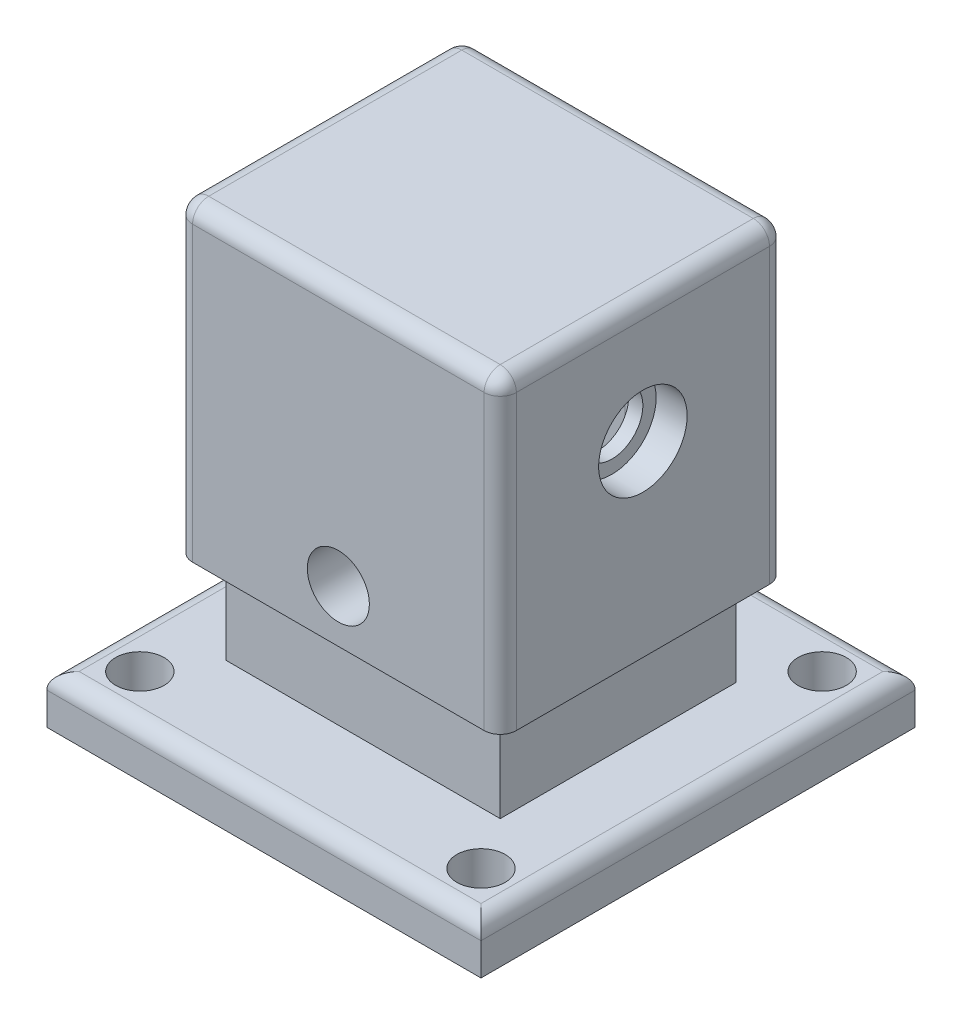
ISO-10303-21;
HEADER;
FILE_DESCRIPTION(('STEP AP214'),'2;1');
FILE_NAME('part.step','',(''),(''),'','','');
FILE_SCHEMA(('AUTOMOTIVE_DESIGN { 1 0 10303 214 1 1 1 1 }'));
ENDSEC;
DATA;
#1=APPLICATION_CONTEXT('core data for automotive mechanical design processes');
#2=APPLICATION_PROTOCOL_DEFINITION('international standard','automotive_design',2000,#1);
#3=PRODUCT_CONTEXT('',#1,'mechanical');
#4=PRODUCT('Part','Part','',(#3));
#5=PRODUCT_RELATED_PRODUCT_CATEGORY('part','',(#4));
#6=PRODUCT_DEFINITION_FORMATION('','',#4);
#7=PRODUCT_DEFINITION_CONTEXT('part definition',#1,'design');
#8=PRODUCT_DEFINITION('design','',#6,#7);
#9=PRODUCT_DEFINITION_SHAPE('','',#8);
#10=(LENGTH_UNIT() NAMED_UNIT(*) SI_UNIT(.MILLI.,.METRE.));
#11=(NAMED_UNIT(*) PLANE_ANGLE_UNIT() SI_UNIT($,.RADIAN.));
#12=(NAMED_UNIT(*) SI_UNIT($,.STERADIAN.) SOLID_ANGLE_UNIT());
#13=UNCERTAINTY_MEASURE_WITH_UNIT(LENGTH_MEASURE(1.E-05),#10,'distance_accuracy_value','');
#14=(GEOMETRIC_REPRESENTATION_CONTEXT(3) GLOBAL_UNCERTAINTY_ASSIGNED_CONTEXT((#13)) GLOBAL_UNIT_ASSIGNED_CONTEXT((#10,
#11,#12)) REPRESENTATION_CONTEXT('',''));
#15=CARTESIAN_POINT('',(0.,0.,0.));
#16=DIRECTION('',(0.,0.,1.));
#17=DIRECTION('',(1.,0.,0.));
#18=AXIS2_PLACEMENT_3D('',#15,#16,#17);
#19=CARTESIAN_POINT('',(23.876,76.2,12.7));
#20=DIRECTION('',(1.,0.,0.));
#21=DIRECTION('',(0.,0.,-1.));
#22=AXIS2_PLACEMENT_3D('',#19,#20,#21);
#23=PLANE('',#22);
#24=DIRECTION('',(0.,0.,-1.));
#25=VECTOR('',#24,1.);
#26=CARTESIAN_POINT('',(23.876,3.302,12.7));
#27=LINE('',#26,#25);
#28=CARTESIAN_POINT('',(23.876,3.302,5.588));
#29=VERTEX_POINT('',#28);
#30=CARTESIAN_POINT('',(23.876,3.302,-5.58799999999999));
#31=VERTEX_POINT('',#30);
#32=EDGE_CURVE('E455',#29,#31,#27,.T.);
#33=ORIENTED_EDGE('',*,*,#32,.F.);
#34=DIRECTION('',(0.,-1.,0.));
#35=VECTOR('',#34,1.);
#36=CARTESIAN_POINT('',(23.876,76.2,5.588));
#37=LINE('',#36,#35);
#38=CARTESIAN_POINT('',(23.876,64.2939171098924,5.588));
#39=VERTEX_POINT('',#38);
#40=EDGE_CURVE('E957',#29,#39,#37,.F.);
#41=ORIENTED_EDGE('',*,*,#40,.T.);
#42=CARTESIAN_POINT('',(23.876,67.31,0.));
#43=DIRECTION('',(1.,0.,0.));
#44=DIRECTION('',(0.,0.,-1.));
#45=AXIS2_PLACEMENT_3D('',#42,#43,#44);
#46=CIRCLE('',#45,6.35);
#47=CARTESIAN_POINT('',(23.876,64.2939171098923,-5.58799999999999));
#48=VERTEX_POINT('',#47);
#49=EDGE_CURVE('E1110',#39,#48,#46,.T.);
#50=ORIENTED_EDGE('',*,*,#49,.T.);
#51=DIRECTION('',(0.,-1.,0.));
#52=VECTOR('',#51,1.);
#53=CARTESIAN_POINT('',(23.876,3.302,-5.58799999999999));
#54=LINE('',#53,#52);
#55=EDGE_CURVE('E1053',#48,#31,#54,.T.);
#56=ORIENTED_EDGE('',*,*,#55,.T.);
#57=EDGE_LOOP('',(#33,#41,#50,#56));
#58=FACE_BOUND('',#57,.T.);
#59=ADVANCED_FACE('F45',(#58),#23,.F.);
#60=CARTESIAN_POINT('',(-23.876,76.2,12.7));
#61=DIRECTION('',(-1.,0.,0.));
#62=DIRECTION('',(0.,0.,1.));
#63=AXIS2_PLACEMENT_3D('',#60,#61,#62);
#64=PLANE('',#63);
#65=DIRECTION('',(0.,0.,-1.));
#66=VECTOR('',#65,1.);
#67=CARTESIAN_POINT('',(-23.876,76.2,12.7));
#68=LINE('',#67,#66);
#69=CARTESIAN_POINT('',(-23.876,76.2,5.588));
#70=VERTEX_POINT('',#69);
#71=CARTESIAN_POINT('',(-23.876,76.2,-5.588));
#72=VERTEX_POINT('',#71);
#73=EDGE_CURVE('E467',#70,#72,#68,.T.);
#74=ORIENTED_EDGE('',*,*,#73,.F.);
#75=DIRECTION('',(0.,-1.,0.));
#76=VECTOR('',#75,1.);
#77=CARTESIAN_POINT('',(-23.876,3.30200000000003,5.588));
#78=LINE('',#77,#76);
#79=CARTESIAN_POINT('',(-23.876,70.3260828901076,5.588));
#80=VERTEX_POINT('',#79);
#81=EDGE_CURVE('E775',#70,#80,#78,.T.);
#82=ORIENTED_EDGE('',*,*,#81,.T.);
#83=CARTESIAN_POINT('',(-23.876,67.31,0.));
#84=DIRECTION('',(-1.,0.,0.));
#85=DIRECTION('',(0.,0.,1.));
#86=AXIS2_PLACEMENT_3D('',#83,#84,#85);
#87=CIRCLE('',#86,6.35);
#88=CARTESIAN_POINT('',(-23.876,70.3260828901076,-5.588));
#89=VERTEX_POINT('',#88);
#90=EDGE_CURVE('E410',#80,#89,#87,.T.);
#91=ORIENTED_EDGE('',*,*,#90,.T.);
#92=DIRECTION('',(0.,-1.,0.));
#93=VECTOR('',#92,1.);
#94=CARTESIAN_POINT('',(-23.876,76.2,-5.588));
#95=LINE('',#94,#93);
#96=EDGE_CURVE('E706',#89,#72,#95,.F.);
#97=ORIENTED_EDGE('',*,*,#96,.T.);
#98=EDGE_LOOP('',(#74,#82,#91,#97));
#99=FACE_BOUND('',#98,.T.);
#100=ADVANCED_FACE('F918',(#99),#64,.F.);
#101=CARTESIAN_POINT('',(-44.45,67.31,0.));
#102=DIRECTION('',(1.,0.,0.));
#103=DIRECTION('',(0.,0.,-1.));
#104=AXIS2_PLACEMENT_3D('',#101,#102,#103);
#105=CYLINDRICAL_SURFACE('',#104,6.35);
#106=ORIENTED_EDGE('',*,*,#90,.F.);
#107=CARTESIAN_POINT('',(-23.876,64.2939171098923,5.588));
#108=VERTEX_POINT('',#107);
#109=EDGE_CURVE('E416',#108,#80,#87,.T.);
#110=ORIENTED_EDGE('',*,*,#109,.F.);
#111=CARTESIAN_POINT('',(-23.876,64.2939171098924,-5.588));
#112=VERTEX_POINT('',#111);
#113=EDGE_CURVE('E1116',#112,#108,#87,.T.);
#114=ORIENTED_EDGE('',*,*,#113,.F.);
#115=EDGE_CURVE('E415',#89,#112,#87,.T.);
#116=ORIENTED_EDGE('',*,*,#115,.F.);
#117=EDGE_LOOP('',(#106,#110,#114,#116));
#118=FACE_BOUND('',#117,.T.);
#119=CARTESIAN_POINT('',(-26.797,67.31,0.));
#120=DIRECTION('',(-1.,0.,0.));
#121=DIRECTION('',(0.,0.,1.));
#122=AXIS2_PLACEMENT_3D('',#119,#120,#121);
#123=CIRCLE('',#122,6.35);
#124=CARTESIAN_POINT('',(-26.797,67.31,6.35));
#125=VERTEX_POINT('',#124);
#126=EDGE_CURVE('E397',#125,#125,#123,.F.);
#127=ORIENTED_EDGE('',*,*,#126,.F.);
#128=EDGE_LOOP('',(#127));
#129=FACE_BOUND('',#128,.T.);
#130=ADVANCED_FACE('F924',(#118,#129),#105,.F.);
#131=CARTESIAN_POINT('',(23.876,70.3260828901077,-5.58799999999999));
#132=VERTEX_POINT('',#131);
#133=CARTESIAN_POINT('',(23.876,70.3260828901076,5.588));
#134=VERTEX_POINT('',#133);
#135=EDGE_CURVE('E604',#132,#134,#46,.T.);
#136=ORIENTED_EDGE('',*,*,#135,.F.);
#137=EDGE_CURVE('E609',#48,#132,#46,.T.);
#138=ORIENTED_EDGE('',*,*,#137,.F.);
#139=ORIENTED_EDGE('',*,*,#49,.F.);
#140=EDGE_CURVE('E608',#134,#39,#46,.T.);
#141=ORIENTED_EDGE('',*,*,#140,.F.);
#142=EDGE_LOOP('',(#136,#138,#139,#141));
#143=FACE_BOUND('',#142,.T.);
#144=CARTESIAN_POINT('',(26.797,67.31,0.));
#145=DIRECTION('',(1.,0.,0.));
#146=DIRECTION('',(0.,0.,-1.));
#147=AXIS2_PLACEMENT_3D('',#144,#145,#146);
#148=CIRCLE('',#147,6.35);
#149=CARTESIAN_POINT('',(26.797,67.31,-6.35));
#150=VERTEX_POINT('',#149);
#151=EDGE_CURVE('E405',#150,#150,#148,.F.);
#152=ORIENTED_EDGE('',*,*,#151,.F.);
#153=EDGE_LOOP('',(#152));
#154=FACE_BOUND('',#153,.T.);
#155=ADVANCED_FACE('F1141',(#143,#154),#105,.F.);
#156=CARTESIAN_POINT('',(0.,9.906,0.));
#157=DIRECTION('',(0.,1.,0.));
#158=DIRECTION('',(0.,0.,1.));
#159=AXIS2_PLACEMENT_3D('',#156,#157,#158);
#160=PLANE('',#159);
#161=DIRECTION('',(0.,0.,1.));
#162=VECTOR('',#161,1.);
#163=CARTESIAN_POINT('',(-41.148,9.906,44.45));
#164=LINE('',#163,#162);
#165=CARTESIAN_POINT('',(-41.148,9.906,-41.148));
#166=VERTEX_POINT('',#165);
#167=CARTESIAN_POINT('',(-41.148,9.906,41.148));
#168=VERTEX_POINT('',#167);
#169=EDGE_CURVE('E624',#166,#168,#164,.T.);
#170=ORIENTED_EDGE('',*,*,#169,.T.);
#171=DIRECTION('',(1.,0.,0.));
#172=VECTOR('',#171,1.);
#173=CARTESIAN_POINT('',(44.45,9.906,41.148));
#174=LINE('',#173,#172);
#175=CARTESIAN_POINT('',(41.148,9.906,41.148));
#176=VERTEX_POINT('',#175);
#177=EDGE_CURVE('E627',#168,#176,#174,.T.);
#178=ORIENTED_EDGE('',*,*,#177,.T.);
#179=DIRECTION('',(0.,0.,-1.));
#180=VECTOR('',#179,1.);
#181=CARTESIAN_POINT('',(41.148,9.906,-44.45));
#182=LINE('',#181,#180);
#183=CARTESIAN_POINT('',(41.148,9.906,-41.148));
#184=VERTEX_POINT('',#183);
#185=EDGE_CURVE('E621',#176,#184,#182,.T.);
#186=ORIENTED_EDGE('',*,*,#185,.T.);
#187=DIRECTION('',(-1.,0.,0.));
#188=VECTOR('',#187,1.);
#189=CARTESIAN_POINT('',(-44.45,9.906,-41.148));
#190=LINE('',#189,#188);
#191=EDGE_CURVE('E603',#184,#166,#190,.T.);
#192=ORIENTED_EDGE('',*,*,#191,.T.);
#193=EDGE_LOOP('',(#170,#178,#186,#192));
#194=FACE_BOUND('',#193,.T.);
#195=DIRECTION('',(0.,0.,-1.));
#196=VECTOR('',#195,1.);
#197=CARTESIAN_POINT('',(28.067,9.906,-24.13));
#198=LINE('',#197,#196);
#199=CARTESIAN_POINT('',(28.067,9.906,24.13));
#200=VERTEX_POINT('',#199);
#201=CARTESIAN_POINT('',(28.067,9.906,-24.13));
#202=VERTEX_POINT('',#201);
#203=EDGE_CURVE('E491',#200,#202,#198,.T.);
#204=ORIENTED_EDGE('',*,*,#203,.F.);
#205=DIRECTION('',(1.,0.,0.));
#206=VECTOR('',#205,1.);
#207=CARTESIAN_POINT('',(-28.067,9.906,24.13));
#208=LINE('',#207,#206);
#209=CARTESIAN_POINT('',(-28.067,9.906,24.13));
#210=VERTEX_POINT('',#209);
#211=EDGE_CURVE('E497',#210,#200,#208,.T.);
#212=ORIENTED_EDGE('',*,*,#211,.F.);
#213=DIRECTION('',(0.,0.,1.));
#214=VECTOR('',#213,1.);
#215=CARTESIAN_POINT('',(-28.067,9.906,-24.13));
#216=LINE('',#215,#214);
#217=CARTESIAN_POINT('',(-28.067,9.906,-24.13));
#218=VERTEX_POINT('',#217);
#219=EDGE_CURVE('E517',#218,#210,#216,.T.);
#220=ORIENTED_EDGE('',*,*,#219,.F.);
#221=DIRECTION('',(-1.,0.,0.));
#222=VECTOR('',#221,1.);
#223=CARTESIAN_POINT('',(-28.067,9.906,-24.13));
#224=LINE('',#223,#222);
#225=EDGE_CURVE('E513',#202,#218,#224,.T.);
#226=ORIENTED_EDGE('',*,*,#225,.F.);
#227=EDGE_LOOP('',(#204,#212,#220,#226));
#228=FACE_BOUND('',#227,.T.);
#229=CARTESIAN_POINT('',(34.925,9.906,34.925));
#230=DIRECTION('',(0.,1.,0.));
#231=DIRECTION('',(0.,0.,1.));
#232=AXIS2_PLACEMENT_3D('',#229,#230,#231);
#233=CIRCLE('',#232,4.95299999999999);
#234=CARTESIAN_POINT('',(34.925,9.906,39.878));
#235=VERTEX_POINT('',#234);
#236=EDGE_CURVE('E548',#235,#235,#233,.T.);
#237=ORIENTED_EDGE('',*,*,#236,.F.);
#238=EDGE_LOOP('',(#237));
#239=FACE_BOUND('',#238,.T.);
#240=CARTESIAN_POINT('',(-34.925,9.906,-34.925));
#241=DIRECTION('',(0.,1.,0.));
#242=DIRECTION('',(0.,0.,1.));
#243=AXIS2_PLACEMENT_3D('',#240,#241,#242);
#244=CIRCLE('',#243,4.953);
#245=CARTESIAN_POINT('',(-34.925,9.906,-29.972));
#246=VERTEX_POINT('',#245);
#247=EDGE_CURVE('E564',#246,#246,#244,.T.);
#248=ORIENTED_EDGE('',*,*,#247,.F.);
#249=EDGE_LOOP('',(#248));
#250=FACE_BOUND('',#249,.T.);
#251=CARTESIAN_POINT('',(34.925,9.906,-34.925));
#252=DIRECTION('',(0.,1.,0.));
#253=DIRECTION('',(0.,0.,1.));
#254=AXIS2_PLACEMENT_3D('',#251,#252,#253);
#255=CIRCLE('',#254,4.953);
#256=CARTESIAN_POINT('',(34.925,9.906,-29.972));
#257=VERTEX_POINT('',#256);
#258=EDGE_CURVE('E556',#257,#257,#255,.T.);
#259=ORIENTED_EDGE('',*,*,#258,.F.);
#260=EDGE_LOOP('',(#259));
#261=FACE_BOUND('',#260,.T.);
#262=CARTESIAN_POINT('',(-34.925,9.906,34.925));
#263=DIRECTION('',(0.,1.,0.));
#264=DIRECTION('',(0.,0.,1.));
#265=AXIS2_PLACEMENT_3D('',#262,#263,#264);
#266=CIRCLE('',#265,4.953);
#267=CARTESIAN_POINT('',(-34.925,9.906,39.878));
#268=VERTEX_POINT('',#267);
#269=EDGE_CURVE('E540',#268,#268,#266,.T.);
#270=ORIENTED_EDGE('',*,*,#269,.F.);
#271=EDGE_LOOP('',(#270));
#272=FACE_BOUND('',#271,.T.);
#273=ADVANCED_FACE('F1144',(#194,#228,#239,#250,#261,#272),#160,.T.);
#274=CARTESIAN_POINT('',(0.,0.,0.));
#275=DIRECTION('',(0.,1.,0.));
#276=DIRECTION('',(0.,0.,1.));
#277=AXIS2_PLACEMENT_3D('',#274,#275,#276);
#278=PLANE('',#277);
#279=DIRECTION('',(-1.,0.,0.));
#280=VECTOR('',#279,1.);
#281=CARTESIAN_POINT('',(-30.226,0.,19.05));
#282=LINE('',#281,#280);
#283=CARTESIAN_POINT('',(26.924,0.,19.05));
#284=VERTEX_POINT('',#283);
#285=CARTESIAN_POINT('',(-26.924,0.,19.05));
#286=VERTEX_POINT('',#285);
#287=EDGE_CURVE('E438',#284,#286,#282,.T.);
#288=ORIENTED_EDGE('',*,*,#287,.F.);
#289=CARTESIAN_POINT('',(26.924,0.,15.748));
#290=DIRECTION('',(0.,1.,0.));
#291=DIRECTION('',(0.,0.,1.));
#292=AXIS2_PLACEMENT_3D('',#289,#290,#291);
#293=CIRCLE('',#292,3.302);
#294=CARTESIAN_POINT('',(30.226,0.,15.748));
#295=VERTEX_POINT('',#294);
#296=EDGE_CURVE('E1688',#284,#295,#293,.T.);
#297=ORIENTED_EDGE('',*,*,#296,.T.);
#298=DIRECTION('',(0.,0.,1.));
#299=VECTOR('',#298,1.);
#300=CARTESIAN_POINT('',(30.226,0.,19.05));
#301=LINE('',#300,#299);
#302=CARTESIAN_POINT('',(30.226,0.,-15.748));
#303=VERTEX_POINT('',#302);
#304=EDGE_CURVE('E414',#303,#295,#301,.T.);
#305=ORIENTED_EDGE('',*,*,#304,.F.);
#306=CARTESIAN_POINT('',(26.924,0.,-15.748));
#307=DIRECTION('',(0.,1.,0.));
#308=DIRECTION('',(0.,0.,1.));
#309=AXIS2_PLACEMENT_3D('',#306,#307,#308);
#310=CIRCLE('',#309,3.302);
#311=CARTESIAN_POINT('',(26.924,0.,-19.05));
#312=VERTEX_POINT('',#311);
#313=EDGE_CURVE('E1685',#303,#312,#310,.T.);
#314=ORIENTED_EDGE('',*,*,#313,.T.);
#315=DIRECTION('',(1.,0.,0.));
#316=VECTOR('',#315,1.);
#317=CARTESIAN_POINT('',(-30.226,0.,-19.05));
#318=LINE('',#317,#316);
#319=CARTESIAN_POINT('',(-26.924,0.,-19.05));
#320=VERTEX_POINT('',#319);
#321=EDGE_CURVE('E422',#320,#312,#318,.T.);
#322=ORIENTED_EDGE('',*,*,#321,.F.);
#323=CARTESIAN_POINT('',(-26.924,0.,-15.748));
#324=DIRECTION('',(0.,1.,0.));
#325=DIRECTION('',(0.,0.,1.));
#326=AXIS2_PLACEMENT_3D('',#323,#324,#325);
#327=CIRCLE('',#326,3.302);
#328=CARTESIAN_POINT('',(-30.226,0.,-15.748));
#329=VERTEX_POINT('',#328);
#330=EDGE_CURVE('E54',#320,#329,#327,.T.);
#331=ORIENTED_EDGE('',*,*,#330,.T.);
#332=DIRECTION('',(0.,0.,-1.));
#333=VECTOR('',#332,1.);
#334=CARTESIAN_POINT('',(-30.226,0.,19.05));
#335=LINE('',#334,#333);
#336=CARTESIAN_POINT('',(-30.226,0.,15.748));
#337=VERTEX_POINT('',#336);
#338=EDGE_CURVE('E442',#337,#329,#335,.T.);
#339=ORIENTED_EDGE('',*,*,#338,.F.);
#340=CARTESIAN_POINT('',(-26.924,0.,15.748));
#341=DIRECTION('',(0.,1.,0.));
#342=DIRECTION('',(0.,0.,1.));
#343=AXIS2_PLACEMENT_3D('',#340,#341,#342);
#344=CIRCLE('',#343,3.302);
#345=EDGE_CURVE('E11',#337,#286,#344,.T.);
#346=ORIENTED_EDGE('',*,*,#345,.T.);
#347=EDGE_LOOP('',(#288,#297,#305,#314,#322,#331,#339,#346));
#348=FACE_BOUND('',#347,.T.);
#349=DIRECTION('',(0.,0.,-1.));
#350=VECTOR('',#349,1.);
#351=CARTESIAN_POINT('',(44.45,0.,-44.45));
#352=LINE('',#351,#350);
#353=CARTESIAN_POINT('',(44.45,0.,44.45));
#354=VERTEX_POINT('',#353);
#355=CARTESIAN_POINT('',(44.45,0.,-44.45));
#356=VERTEX_POINT('',#355);
#357=EDGE_CURVE('E568',#354,#356,#352,.T.);
#358=ORIENTED_EDGE('',*,*,#357,.F.);
#359=DIRECTION('',(1.,0.,0.));
#360=VECTOR('',#359,1.);
#361=CARTESIAN_POINT('',(-44.45,0.,44.45));
#362=LINE('',#361,#360);
#363=CARTESIAN_POINT('',(-44.45,0.,44.45));
#364=VERTEX_POINT('',#363);
#365=EDGE_CURVE('E583',#364,#354,#362,.T.);
#366=ORIENTED_EDGE('',*,*,#365,.F.);
#367=DIRECTION('',(0.,0.,1.));
#368=VECTOR('',#367,1.);
#369=CARTESIAN_POINT('',(-44.45,0.,-44.45));
#370=LINE('',#369,#368);
#371=CARTESIAN_POINT('',(-44.45,0.,-44.45));
#372=VERTEX_POINT('',#371);
#373=EDGE_CURVE('E579',#372,#364,#370,.T.);
#374=ORIENTED_EDGE('',*,*,#373,.F.);
#375=DIRECTION('',(-1.,0.,0.));
#376=VECTOR('',#375,1.);
#377=CARTESIAN_POINT('',(-44.45,0.,-44.45));
#378=LINE('',#377,#376);
#379=EDGE_CURVE('E575',#356,#372,#378,.T.);
#380=ORIENTED_EDGE('',*,*,#379,.F.);
#381=EDGE_LOOP('',(#358,#366,#374,#380));
#382=FACE_BOUND('',#381,.T.);
#383=CARTESIAN_POINT('',(-34.925,0.,-34.925));
#384=DIRECTION('',(0.,1.,0.));
#385=DIRECTION('',(0.,0.,1.));
#386=AXIS2_PLACEMENT_3D('',#383,#384,#385);
#387=CIRCLE('',#386,4.953);
#388=CARTESIAN_POINT('',(-34.925,0.,-29.972));
#389=VERTEX_POINT('',#388);
#390=EDGE_CURVE('E560',#389,#389,#387,.T.);
#391=ORIENTED_EDGE('',*,*,#390,.T.);
#392=EDGE_LOOP('',(#391));
#393=FACE_BOUND('',#392,.T.);
#394=CARTESIAN_POINT('',(34.925,0.,-34.925));
#395=DIRECTION('',(0.,1.,0.));
#396=DIRECTION('',(0.,0.,1.));
#397=AXIS2_PLACEMENT_3D('',#394,#395,#396);
#398=CIRCLE('',#397,4.953);
#399=CARTESIAN_POINT('',(34.925,0.,-29.972));
#400=VERTEX_POINT('',#399);
#401=EDGE_CURVE('E552',#400,#400,#398,.T.);
#402=ORIENTED_EDGE('',*,*,#401,.T.);
#403=EDGE_LOOP('',(#402));
#404=FACE_BOUND('',#403,.T.);
#405=CARTESIAN_POINT('',(34.925,0.,34.925));
#406=DIRECTION('',(0.,1.,0.));
#407=DIRECTION('',(0.,0.,1.));
#408=AXIS2_PLACEMENT_3D('',#405,#406,#407);
#409=CIRCLE('',#408,4.95299999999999);
#410=CARTESIAN_POINT('',(34.925,0.,39.878));
#411=VERTEX_POINT('',#410);
#412=EDGE_CURVE('E544',#411,#411,#409,.T.);
#413=ORIENTED_EDGE('',*,*,#412,.T.);
#414=EDGE_LOOP('',(#413));
#415=FACE_BOUND('',#414,.T.);
#416=CARTESIAN_POINT('',(-34.925,0.,34.925));
#417=DIRECTION('',(0.,1.,0.));
#418=DIRECTION('',(0.,0.,1.));
#419=AXIS2_PLACEMENT_3D('',#416,#417,#418);
#420=CIRCLE('',#419,4.953);
#421=CARTESIAN_POINT('',(-34.925,0.,39.878));
#422=VERTEX_POINT('',#421);
#423=EDGE_CURVE('E539',#422,#422,#420,.T.);
#424=ORIENTED_EDGE('',*,*,#423,.T.);
#425=EDGE_LOOP('',(#424));
#426=FACE_BOUND('',#425,.T.);
#427=ADVANCED_FACE('F1151',(#348,#382,#393,#404,#415,#426),#278,.F.);
#428=CARTESIAN_POINT('',(44.45,9.906,-44.45));
#429=DIRECTION('',(-1.,0.,0.));
#430=DIRECTION('',(0.,0.,1.));
#431=AXIS2_PLACEMENT_3D('',#428,#429,#430);
#432=PLANE('',#431);
#433=DIRECTION('',(0.,-1.,0.));
#434=VECTOR('',#433,1.);
#435=CARTESIAN_POINT('',(44.45,9.906,-44.45));
#436=LINE('',#435,#434);
#437=CARTESIAN_POINT('',(44.45,6.604,-44.45));
#438=VERTEX_POINT('',#437);
#439=EDGE_CURVE('E596',#438,#356,#436,.T.);
#440=ORIENTED_EDGE('',*,*,#439,.F.);
#441=DIRECTION('',(0.,0.,-1.));
#442=VECTOR('',#441,1.);
#443=CARTESIAN_POINT('',(44.45,6.604,44.45));
#444=LINE('',#443,#442);
#445=CARTESIAN_POINT('',(44.45,6.604,44.45));
#446=VERTEX_POINT('',#445);
#447=EDGE_CURVE('E638',#438,#446,#444,.F.);
#448=ORIENTED_EDGE('',*,*,#447,.T.);
#449=DIRECTION('',(0.,-1.,0.));
#450=VECTOR('',#449,1.);
#451=CARTESIAN_POINT('',(44.45,9.906,44.45));
#452=LINE('',#451,#450);
#453=EDGE_CURVE('E587',#446,#354,#452,.T.);
#454=ORIENTED_EDGE('',*,*,#453,.T.);
#455=ORIENTED_EDGE('',*,*,#357,.T.);
#456=EDGE_LOOP('',(#440,#448,#454,#455));
#457=FACE_BOUND('',#456,.T.);
#458=ADVANCED_FACE('F1301',(#457),#432,.F.);
#459=CARTESIAN_POINT('',(-44.45,9.906,-44.45));
#460=DIRECTION('',(0.,0.,1.));
#461=DIRECTION('',(1.,0.,0.));
#462=AXIS2_PLACEMENT_3D('',#459,#460,#461);
#463=PLANE('',#462);
#464=DIRECTION('',(0.,-1.,0.));
#465=VECTOR('',#464,1.);
#466=CARTESIAN_POINT('',(-44.45,9.906,-44.45));
#467=LINE('',#466,#465);
#468=CARTESIAN_POINT('',(-44.45,6.604,-44.45));
#469=VERTEX_POINT('',#468);
#470=EDGE_CURVE('E593',#469,#372,#467,.T.);
#471=ORIENTED_EDGE('',*,*,#470,.F.);
#472=DIRECTION('',(-1.,0.,0.));
#473=VECTOR('',#472,1.);
#474=CARTESIAN_POINT('',(44.45,6.604,-44.45));
#475=LINE('',#474,#473);
#476=EDGE_CURVE('E641',#469,#438,#475,.F.);
#477=ORIENTED_EDGE('',*,*,#476,.T.);
#478=ORIENTED_EDGE('',*,*,#439,.T.);
#479=ORIENTED_EDGE('',*,*,#379,.T.);
#480=EDGE_LOOP('',(#471,#477,#478,#479));
#481=FACE_BOUND('',#480,.T.);
#482=ADVANCED_FACE('F1755',(#481),#463,.F.);
#483=CARTESIAN_POINT('',(-44.45,9.906,-44.45));
#484=DIRECTION('',(1.,0.,0.));
#485=DIRECTION('',(0.,0.,-1.));
#486=AXIS2_PLACEMENT_3D('',#483,#484,#485);
#487=PLANE('',#486);
#488=DIRECTION('',(0.,-1.,0.));
#489=VECTOR('',#488,1.);
#490=CARTESIAN_POINT('',(-44.45,9.906,44.45));
#491=LINE('',#490,#489);
#492=CARTESIAN_POINT('',(-44.45,6.604,44.45));
#493=VERTEX_POINT('',#492);
#494=EDGE_CURVE('E590',#493,#364,#491,.T.);
#495=ORIENTED_EDGE('',*,*,#494,.F.);
#496=DIRECTION('',(0.,0.,1.));
#497=VECTOR('',#496,1.);
#498=CARTESIAN_POINT('',(-44.45,6.604,-44.45));
#499=LINE('',#498,#497);
#500=EDGE_CURVE('E635',#493,#469,#499,.F.);
#501=ORIENTED_EDGE('',*,*,#500,.T.);
#502=ORIENTED_EDGE('',*,*,#470,.T.);
#503=ORIENTED_EDGE('',*,*,#373,.T.);
#504=EDGE_LOOP('',(#495,#501,#502,#503));
#505=FACE_BOUND('',#504,.T.);
#506=ADVANCED_FACE('F1752',(#505),#487,.F.);
#507=CARTESIAN_POINT('',(-44.45,9.906,44.45));
#508=DIRECTION('',(0.,0.,-1.));
#509=DIRECTION('',(-1.,0.,0.));
#510=AXIS2_PLACEMENT_3D('',#507,#508,#509);
#511=PLANE('',#510);
#512=ORIENTED_EDGE('',*,*,#453,.F.);
#513=DIRECTION('',(1.,0.,0.));
#514=VECTOR('',#513,1.);
#515=CARTESIAN_POINT('',(-44.45,6.604,44.45));
#516=LINE('',#515,#514);
#517=EDGE_CURVE('E631',#446,#493,#516,.F.);
#518=ORIENTED_EDGE('',*,*,#517,.T.);
#519=ORIENTED_EDGE('',*,*,#494,.T.);
#520=ORIENTED_EDGE('',*,*,#365,.T.);
#521=EDGE_LOOP('',(#512,#518,#519,#520));
#522=FACE_BOUND('',#521,.T.);
#523=ADVANCED_FACE('F1747',(#522),#511,.F.);
#524=CARTESIAN_POINT('',(-34.925,9.906,-34.925));
#525=DIRECTION('',(0.,-1.,0.));
#526=DIRECTION('',(0.,0.,-1.));
#527=AXIS2_PLACEMENT_3D('',#524,#525,#526);
#528=CYLINDRICAL_SURFACE('',#527,4.953);
#529=ORIENTED_EDGE('',*,*,#247,.T.);
#530=EDGE_LOOP('',(#529));
#531=FACE_BOUND('',#530,.T.);
#532=ORIENTED_EDGE('',*,*,#390,.F.);
#533=EDGE_LOOP('',(#532));
#534=FACE_BOUND('',#533,.T.);
#535=ADVANCED_FACE('F1744',(#531,#534),#528,.F.);
#536=CARTESIAN_POINT('',(34.925,9.906,-34.925));
#537=DIRECTION('',(0.,-1.,0.));
#538=DIRECTION('',(0.,0.,-1.));
#539=AXIS2_PLACEMENT_3D('',#536,#537,#538);
#540=CYLINDRICAL_SURFACE('',#539,4.953);
#541=ORIENTED_EDGE('',*,*,#258,.T.);
#542=EDGE_LOOP('',(#541));
#543=FACE_BOUND('',#542,.T.);
#544=ORIENTED_EDGE('',*,*,#401,.F.);
#545=EDGE_LOOP('',(#544));
#546=FACE_BOUND('',#545,.T.);
#547=ADVANCED_FACE('F1737',(#543,#546),#540,.F.);
#548=CARTESIAN_POINT('',(34.925,9.906,34.925));
#549=DIRECTION('',(0.,-1.,0.));
#550=DIRECTION('',(0.,0.,-1.));
#551=AXIS2_PLACEMENT_3D('',#548,#549,#550);
#552=CYLINDRICAL_SURFACE('',#551,4.95299999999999);
#553=ORIENTED_EDGE('',*,*,#236,.T.);
#554=EDGE_LOOP('',(#553));
#555=FACE_BOUND('',#554,.T.);
#556=ORIENTED_EDGE('',*,*,#412,.F.);
#557=EDGE_LOOP('',(#556));
#558=FACE_BOUND('',#557,.T.);
#559=ADVANCED_FACE('F1727',(#555,#558),#552,.F.);
#560=CARTESIAN_POINT('',(-34.925,9.906,34.925));
#561=DIRECTION('',(0.,-1.,0.));
#562=DIRECTION('',(0.,0.,-1.));
#563=AXIS2_PLACEMENT_3D('',#560,#561,#562);
#564=CYLINDRICAL_SURFACE('',#563,4.953);
#565=ORIENTED_EDGE('',*,*,#269,.T.);
#566=EDGE_LOOP('',(#565));
#567=FACE_BOUND('',#566,.T.);
#568=ORIENTED_EDGE('',*,*,#423,.F.);
#569=EDGE_LOOP('',(#568));
#570=FACE_BOUND('',#569,.T.);
#571=ADVANCED_FACE('F1724',(#567,#570),#564,.F.);
#572=CARTESIAN_POINT('',(28.067,28.956,-24.13));
#573=DIRECTION('',(-1.,0.,0.));
#574=DIRECTION('',(0.,0.,1.));
#575=AXIS2_PLACEMENT_3D('',#572,#573,#574);
#576=PLANE('',#575);
#577=ORIENTED_EDGE('',*,*,#203,.T.);
#578=DIRECTION('',(0.,-1.,0.));
#579=VECTOR('',#578,1.);
#580=CARTESIAN_POINT('',(28.067,28.956,-24.13));
#581=LINE('',#580,#579);
#582=CARTESIAN_POINT('',(28.067,28.956,-24.13));
#583=VERTEX_POINT('',#582);
#584=EDGE_CURVE('E535',#583,#202,#581,.T.);
#585=ORIENTED_EDGE('',*,*,#584,.F.);
#586=DIRECTION('',(0.,0.,-1.));
#587=VECTOR('',#586,1.);
#588=CARTESIAN_POINT('',(28.067,28.956,-24.13));
#589=LINE('',#588,#587);
#590=CARTESIAN_POINT('',(28.067,28.956,24.13));
#591=VERTEX_POINT('',#590);
#592=EDGE_CURVE('E492',#591,#583,#589,.T.);
#593=ORIENTED_EDGE('',*,*,#592,.F.);
#594=DIRECTION('',(0.,-1.,0.));
#595=VECTOR('',#594,1.);
#596=CARTESIAN_POINT('',(28.067,28.956,24.13));
#597=LINE('',#596,#595);
#598=EDGE_CURVE('E509',#591,#200,#597,.T.);
#599=ORIENTED_EDGE('',*,*,#598,.T.);
#600=EDGE_LOOP('',(#577,#585,#593,#599));
#601=FACE_BOUND('',#600,.T.);
#602=ADVANCED_FACE('F1726',(#601),#576,.F.);
#603=CARTESIAN_POINT('',(-28.067,28.956,-24.13));
#604=DIRECTION('',(0.,0.,1.));
#605=DIRECTION('',(1.,0.,0.));
#606=AXIS2_PLACEMENT_3D('',#603,#604,#605);
#607=PLANE('',#606);
#608=ORIENTED_EDGE('',*,*,#225,.T.);
#609=DIRECTION('',(0.,-1.,0.));
#610=VECTOR('',#609,1.);
#611=CARTESIAN_POINT('',(-28.067,28.956,-24.13));
#612=LINE('',#611,#610);
#613=CARTESIAN_POINT('',(-28.067,28.956,-24.13));
#614=VERTEX_POINT('',#613);
#615=EDGE_CURVE('E531',#614,#218,#612,.T.);
#616=ORIENTED_EDGE('',*,*,#615,.F.);
#617=DIRECTION('',(-1.,0.,0.));
#618=VECTOR('',#617,1.);
#619=CARTESIAN_POINT('',(-28.067,28.956,-24.13));
#620=LINE('',#619,#618);
#621=EDGE_CURVE('E496',#583,#614,#620,.T.);
#622=ORIENTED_EDGE('',*,*,#621,.F.);
#623=ORIENTED_EDGE('',*,*,#584,.T.);
#624=EDGE_LOOP('',(#608,#616,#622,#623));
#625=FACE_BOUND('',#624,.T.);
#626=ADVANCED_FACE('F1734',(#625),#607,.F.);
#627=CARTESIAN_POINT('',(-28.067,28.956,-24.13));
#628=DIRECTION('',(1.,0.,0.));
#629=DIRECTION('',(0.,0.,-1.));
#630=AXIS2_PLACEMENT_3D('',#627,#628,#629);
#631=PLANE('',#630);
#632=ORIENTED_EDGE('',*,*,#219,.T.);
#633=DIRECTION('',(0.,-1.,0.));
#634=VECTOR('',#633,1.);
#635=CARTESIAN_POINT('',(-28.067,28.956,24.13));
#636=LINE('',#635,#634);
#637=CARTESIAN_POINT('',(-28.067,28.956,24.13));
#638=VERTEX_POINT('',#637);
#639=EDGE_CURVE('E527',#638,#210,#636,.T.);
#640=ORIENTED_EDGE('',*,*,#639,.F.);
#641=DIRECTION('',(0.,0.,1.));
#642=VECTOR('',#641,1.);
#643=CARTESIAN_POINT('',(-28.067,28.956,-24.13));
#644=LINE('',#643,#642);
#645=EDGE_CURVE('E501',#614,#638,#644,.T.);
#646=ORIENTED_EDGE('',*,*,#645,.F.);
#647=ORIENTED_EDGE('',*,*,#615,.T.);
#648=EDGE_LOOP('',(#632,#640,#646,#647));
#649=FACE_BOUND('',#648,.T.);
#650=ADVANCED_FACE('F1798',(#649),#631,.F.);
#651=CARTESIAN_POINT('',(-28.067,28.956,24.13));
#652=DIRECTION('',(0.,0.,-1.));
#653=DIRECTION('',(-1.,0.,0.));
#654=AXIS2_PLACEMENT_3D('',#651,#652,#653);
#655=PLANE('',#654);
#656=ORIENTED_EDGE('',*,*,#211,.T.);
#657=ORIENTED_EDGE('',*,*,#598,.F.);
#658=DIRECTION('',(1.,0.,0.));
#659=VECTOR('',#658,1.);
#660=CARTESIAN_POINT('',(-28.067,28.956,24.13));
#661=LINE('',#660,#659);
#662=EDGE_CURVE('E505',#638,#591,#661,.T.);
#663=ORIENTED_EDGE('',*,*,#662,.F.);
#664=ORIENTED_EDGE('',*,*,#639,.T.);
#665=EDGE_LOOP('',(#656,#657,#663,#664));
#666=FACE_BOUND('',#665,.T.);
#667=ADVANCED_FACE('F1794',(#666),#655,.F.);
#668=CARTESIAN_POINT('',(0.,28.956,0.));
#669=DIRECTION('',(0.,1.,0.));
#670=DIRECTION('',(0.,0.,1.));
#671=AXIS2_PLACEMENT_3D('',#668,#669,#670);
#672=PLANE('',#671);
#673=DIRECTION('',(-1.,0.,0.));
#674=VECTOR('',#673,1.);
#675=CARTESIAN_POINT('',(-33.147,28.956,-29.21));
#676=LINE('',#675,#674);
#677=CARTESIAN_POINT('',(29.845,28.956,-29.21));
#678=VERTEX_POINT('',#677);
#679=CARTESIAN_POINT('',(-29.845,28.956,-29.21));
#680=VERTEX_POINT('',#679);
#681=EDGE_CURVE('E479',#678,#680,#676,.T.);
#682=ORIENTED_EDGE('',*,*,#681,.F.);
#683=CARTESIAN_POINT('',(29.845,28.956,-25.908));
#684=DIRECTION('',(0.,1.,0.));
#685=DIRECTION('',(0.,0.,1.));
#686=AXIS2_PLACEMENT_3D('',#683,#684,#685);
#687=CIRCLE('',#686,3.302);
#688=CARTESIAN_POINT('',(33.147,28.956,-25.908));
#689=VERTEX_POINT('',#688);
#690=EDGE_CURVE('E703',#678,#689,#687,.F.);
#691=ORIENTED_EDGE('',*,*,#690,.T.);
#692=DIRECTION('',(0.,0.,-1.));
#693=VECTOR('',#692,1.);
#694=CARTESIAN_POINT('',(33.147,28.956,-29.21));
#695=LINE('',#694,#693);
#696=CARTESIAN_POINT('',(33.147,28.956,25.908));
#697=VERTEX_POINT('',#696);
#698=EDGE_CURVE('E475',#697,#689,#695,.T.);
#699=ORIENTED_EDGE('',*,*,#698,.F.);
#700=CARTESIAN_POINT('',(29.845,28.956,25.908));
#701=DIRECTION('',(0.,1.,0.));
#702=DIRECTION('',(0.,0.,1.));
#703=AXIS2_PLACEMENT_3D('',#700,#701,#702);
#704=CIRCLE('',#703,3.302);
#705=CARTESIAN_POINT('',(29.845,28.956,29.21));
#706=VERTEX_POINT('',#705);
#707=EDGE_CURVE('E694',#697,#706,#704,.F.);
#708=ORIENTED_EDGE('',*,*,#707,.T.);
#709=DIRECTION('',(1.,0.,0.));
#710=VECTOR('',#709,1.);
#711=CARTESIAN_POINT('',(-33.147,28.956,29.21));
#712=LINE('',#711,#710);
#713=CARTESIAN_POINT('',(-29.845,28.956,29.21));
#714=VERTEX_POINT('',#713);
#715=EDGE_CURVE('E487',#714,#706,#712,.T.);
#716=ORIENTED_EDGE('',*,*,#715,.F.);
#717=CARTESIAN_POINT('',(-29.845,28.956,25.908));
#718=DIRECTION('',(0.,1.,0.));
#719=DIRECTION('',(0.,0.,1.));
#720=AXIS2_PLACEMENT_3D('',#717,#718,#719);
#721=CIRCLE('',#720,3.302);
#722=CARTESIAN_POINT('',(-33.147,28.956,25.908));
#723=VERTEX_POINT('',#722);
#724=EDGE_CURVE('E697',#714,#723,#721,.F.);
#725=ORIENTED_EDGE('',*,*,#724,.T.);
#726=DIRECTION('',(0.,0.,1.));
#727=VECTOR('',#726,1.);
#728=CARTESIAN_POINT('',(-33.147,28.956,-29.21));
#729=LINE('',#728,#727);
#730=CARTESIAN_POINT('',(-33.147,28.956,-25.908));
#731=VERTEX_POINT('',#730);
#732=EDGE_CURVE('E483',#731,#723,#729,.T.);
#733=ORIENTED_EDGE('',*,*,#732,.F.);
#734=CARTESIAN_POINT('',(-29.845,28.956,-25.908));
#735=DIRECTION('',(0.,1.,0.));
#736=DIRECTION('',(0.,0.,1.));
#737=AXIS2_PLACEMENT_3D('',#734,#735,#736);
#738=CIRCLE('',#737,3.302);
#739=EDGE_CURVE('E700',#731,#680,#738,.F.);
#740=ORIENTED_EDGE('',*,*,#739,.T.);
#741=EDGE_LOOP('',(#682,#691,#699,#708,#716,#725,#733,#740));
#742=FACE_BOUND('',#741,.T.);
#743=ORIENTED_EDGE('',*,*,#662,.T.);
#744=ORIENTED_EDGE('',*,*,#592,.T.);
#745=ORIENTED_EDGE('',*,*,#621,.T.);
#746=ORIENTED_EDGE('',*,*,#645,.T.);
#747=EDGE_LOOP('',(#743,#744,#745,#746));
#748=FACE_BOUND('',#747,.T.);
#749=ADVANCED_FACE('F1236',(#742,#748),#672,.F.);
#750=CARTESIAN_POINT('',(33.147,92.202,-29.21));
#751=DIRECTION('',(-1.,0.,0.));
#752=DIRECTION('',(0.,0.,1.));
#753=AXIS2_PLACEMENT_3D('',#750,#751,#752);
#754=PLANE('',#753);
#755=CARTESIAN_POINT('',(33.147,67.31,0.));
#756=DIRECTION('',(1.,0.,0.));
#757=DIRECTION('',(0.,0.,-1.));
#758=AXIS2_PLACEMENT_3D('',#755,#756,#757);
#759=CIRCLE('',#758,9.05772191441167);
#760=CARTESIAN_POINT('',(33.147,67.31,-9.05772191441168));
#761=VERTEX_POINT('',#760);
#762=EDGE_CURVE('E406',#761,#761,#759,.T.);
#763=ORIENTED_EDGE('',*,*,#762,.F.);
#764=EDGE_LOOP('',(#763));
#765=FACE_BOUND('',#764,.T.);
#766=ORIENTED_EDGE('',*,*,#698,.T.);
#767=DIRECTION('',(0.,-1.,0.));
#768=VECTOR('',#767,1.);
#769=CARTESIAN_POINT('',(33.147,92.202,-25.908));
#770=LINE('',#769,#768);
#771=CARTESIAN_POINT('',(33.147,88.9,-25.908));
#772=VERTEX_POINT('',#771);
#773=EDGE_CURVE('E673',#689,#772,#770,.F.);
#774=ORIENTED_EDGE('',*,*,#773,.T.);
#775=DIRECTION('',(0.,0.,-1.));
#776=VECTOR('',#775,1.);
#777=CARTESIAN_POINT('',(33.147,88.9,29.21));
#778=LINE('',#777,#776);
#779=CARTESIAN_POINT('',(33.147,88.9,25.908));
#780=VERTEX_POINT('',#779);
#781=EDGE_CURVE('E670',#772,#780,#778,.F.);
#782=ORIENTED_EDGE('',*,*,#781,.T.);
#783=DIRECTION('',(0.,-1.,0.));
#784=VECTOR('',#783,1.);
#785=CARTESIAN_POINT('',(33.147,92.202,25.908));
#786=LINE('',#785,#784);
#787=EDGE_CURVE('E667',#780,#697,#786,.T.);
#788=ORIENTED_EDGE('',*,*,#787,.T.);
#789=EDGE_LOOP('',(#766,#774,#782,#788));
#790=FACE_BOUND('',#789,.T.);
#791=ADVANCED_FACE('F1245',(#765,#790),#754,.F.);
#792=CARTESIAN_POINT('',(-33.147,92.202,-29.21));
#793=DIRECTION('',(0.,0.,1.));
#794=DIRECTION('',(1.,0.,0.));
#795=AXIS2_PLACEMENT_3D('',#792,#793,#794);
#796=PLANE('',#795);
#797=CARTESIAN_POINT('',(0.,39.624,-29.21));
#798=DIRECTION('',(0.,0.,1.));
#799=DIRECTION('',(1.,0.,0.));
#800=AXIS2_PLACEMENT_3D('',#797,#798,#799);
#801=CIRCLE('',#800,6.35);
#802=CARTESIAN_POINT('',(6.35,39.624,-29.21));
#803=VERTEX_POINT('',#802);
#804=EDGE_CURVE('E388',#803,#803,#801,.T.);
#805=ORIENTED_EDGE('',*,*,#804,.T.);
#806=EDGE_LOOP('',(#805));
#807=FACE_BOUND('',#806,.T.);
#808=DIRECTION('',(-1.,0.,0.));
#809=VECTOR('',#808,1.);
#810=CARTESIAN_POINT('',(33.147,88.9,-29.21));
#811=LINE('',#810,#809);
#812=CARTESIAN_POINT('',(-29.845,88.9,-29.21));
#813=VERTEX_POINT('',#812);
#814=CARTESIAN_POINT('',(29.845,88.9,-29.21));
#815=VERTEX_POINT('',#814);
#816=EDGE_CURVE('E660',#813,#815,#811,.F.);
#817=ORIENTED_EDGE('',*,*,#816,.T.);
#818=DIRECTION('',(0.,-1.,0.));
#819=VECTOR('',#818,1.);
#820=CARTESIAN_POINT('',(29.845,92.202,-29.21));
#821=LINE('',#820,#819);
#822=EDGE_CURVE('E664',#815,#678,#821,.T.);
#823=ORIENTED_EDGE('',*,*,#822,.T.);
#824=ORIENTED_EDGE('',*,*,#681,.T.);
#825=DIRECTION('',(0.,-1.,0.));
#826=VECTOR('',#825,1.);
#827=CARTESIAN_POINT('',(-29.845,92.202,-29.21));
#828=LINE('',#827,#826);
#829=EDGE_CURVE('E657',#680,#813,#828,.F.);
#830=ORIENTED_EDGE('',*,*,#829,.T.);
#831=EDGE_LOOP('',(#817,#823,#824,#830));
#832=FACE_BOUND('',#831,.T.);
#833=ADVANCED_FACE('F1210',(#807,#832),#796,.F.);
#834=CARTESIAN_POINT('',(-33.147,92.202,-29.21));
#835=DIRECTION('',(1.,0.,0.));
#836=DIRECTION('',(0.,0.,-1.));
#837=AXIS2_PLACEMENT_3D('',#834,#835,#836);
#838=PLANE('',#837);
#839=CARTESIAN_POINT('',(-33.147,67.31,0.));
#840=DIRECTION('',(1.,0.,0.));
#841=DIRECTION('',(0.,0.,-1.));
#842=AXIS2_PLACEMENT_3D('',#839,#840,#841);
#843=CIRCLE('',#842,9.05772191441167);
#844=CARTESIAN_POINT('',(-33.147,67.31,-9.05772191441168));
#845=VERTEX_POINT('',#844);
#846=EDGE_CURVE('E392',#845,#845,#843,.T.);
#847=ORIENTED_EDGE('',*,*,#846,.T.);
#848=EDGE_LOOP('',(#847));
#849=FACE_BOUND('',#848,.T.);
#850=DIRECTION('',(0.,0.,1.));
#851=VECTOR('',#850,1.);
#852=CARTESIAN_POINT('',(-33.147,88.9,-29.21));
#853=LINE('',#852,#851);
#854=CARTESIAN_POINT('',(-33.147,88.9,25.908));
#855=VERTEX_POINT('',#854);
#856=CARTESIAN_POINT('',(-33.147,88.9,-25.908));
#857=VERTEX_POINT('',#856);
#858=EDGE_CURVE('E679',#855,#857,#853,.F.);
#859=ORIENTED_EDGE('',*,*,#858,.T.);
#860=DIRECTION('',(0.,-1.,0.));
#861=VECTOR('',#860,1.);
#862=CARTESIAN_POINT('',(-33.147,92.202,-25.908));
#863=LINE('',#862,#861);
#864=EDGE_CURVE('E682',#857,#731,#863,.T.);
#865=ORIENTED_EDGE('',*,*,#864,.T.);
#866=ORIENTED_EDGE('',*,*,#732,.T.);
#867=DIRECTION('',(0.,-1.,0.));
#868=VECTOR('',#867,1.);
#869=CARTESIAN_POINT('',(-33.147,92.202,25.908));
#870=LINE('',#869,#868);
#871=EDGE_CURVE('E676',#723,#855,#870,.F.);
#872=ORIENTED_EDGE('',*,*,#871,.T.);
#873=EDGE_LOOP('',(#859,#865,#866,#872));
#874=FACE_BOUND('',#873,.T.);
#875=ADVANCED_FACE('F1206',(#849,#874),#838,.F.);
#876=CARTESIAN_POINT('',(-33.147,92.202,29.21));
#877=DIRECTION('',(0.,0.,-1.));
#878=DIRECTION('',(-1.,0.,0.));
#879=AXIS2_PLACEMENT_3D('',#876,#877,#878);
#880=PLANE('',#879);
#881=CARTESIAN_POINT('',(0.,39.624,29.21));
#882=DIRECTION('',(0.,0.,1.));
#883=DIRECTION('',(1.,0.,0.));
#884=AXIS2_PLACEMENT_3D('',#881,#882,#883);
#885=CIRCLE('',#884,6.35);
#886=CARTESIAN_POINT('',(6.35,39.624,29.21));
#887=VERTEX_POINT('',#886);
#888=EDGE_CURVE('E378',#887,#887,#885,.T.);
#889=ORIENTED_EDGE('',*,*,#888,.F.);
#890=EDGE_LOOP('',(#889));
#891=FACE_BOUND('',#890,.T.);
#892=DIRECTION('',(1.,0.,0.));
#893=VECTOR('',#892,1.);
#894=CARTESIAN_POINT('',(-33.147,88.9,29.21));
#895=LINE('',#894,#893);
#896=CARTESIAN_POINT('',(29.845,88.9,29.21));
#897=VERTEX_POINT('',#896);
#898=CARTESIAN_POINT('',(-29.845,88.9,29.21));
#899=VERTEX_POINT('',#898);
#900=EDGE_CURVE('E688',#897,#899,#895,.F.);
#901=ORIENTED_EDGE('',*,*,#900,.T.);
#902=DIRECTION('',(0.,-1.,0.));
#903=VECTOR('',#902,1.);
#904=CARTESIAN_POINT('',(-29.845,92.202,29.21));
#905=LINE('',#904,#903);
#906=EDGE_CURVE('E691',#899,#714,#905,.T.);
#907=ORIENTED_EDGE('',*,*,#906,.T.);
#908=ORIENTED_EDGE('',*,*,#715,.T.);
#909=DIRECTION('',(0.,-1.,0.));
#910=VECTOR('',#909,1.);
#911=CARTESIAN_POINT('',(29.845,92.202,29.21));
#912=LINE('',#911,#910);
#913=EDGE_CURVE('E685',#706,#897,#912,.F.);
#914=ORIENTED_EDGE('',*,*,#913,.T.);
#915=EDGE_LOOP('',(#901,#907,#908,#914));
#916=FACE_BOUND('',#915,.T.);
#917=ADVANCED_FACE('F1209',(#891,#916),#880,.F.);
#918=CARTESIAN_POINT('',(0.,92.202,0.));
#919=DIRECTION('',(0.,1.,0.));
#920=DIRECTION('',(0.,0.,1.));
#921=AXIS2_PLACEMENT_3D('',#918,#919,#920);
#922=PLANE('',#921);
#923=DIRECTION('',(0.,0.,-1.));
#924=VECTOR('',#923,1.);
#925=CARTESIAN_POINT('',(29.845,92.202,-29.21));
#926=LINE('',#925,#924);
#927=CARTESIAN_POINT('',(29.845,92.202,25.908));
#928=VERTEX_POINT('',#927);
#929=CARTESIAN_POINT('',(29.845,92.202,-25.908));
#930=VERTEX_POINT('',#929);
#931=EDGE_CURVE('E650',#928,#930,#926,.T.);
#932=ORIENTED_EDGE('',*,*,#931,.T.);
#933=DIRECTION('',(-1.,0.,0.));
#934=VECTOR('',#933,1.);
#935=CARTESIAN_POINT('',(-33.147,92.202,-25.908));
#936=LINE('',#935,#934);
#937=CARTESIAN_POINT('',(-29.845,92.202,-25.908));
#938=VERTEX_POINT('',#937);
#939=EDGE_CURVE('E653',#930,#938,#936,.T.);
#940=ORIENTED_EDGE('',*,*,#939,.T.);
#941=DIRECTION('',(0.,0.,1.));
#942=VECTOR('',#941,1.);
#943=CARTESIAN_POINT('',(-29.845,92.202,29.21));
#944=LINE('',#943,#942);
#945=CARTESIAN_POINT('',(-29.845,92.202,25.908));
#946=VERTEX_POINT('',#945);
#947=EDGE_CURVE('E647',#938,#946,#944,.T.);
#948=ORIENTED_EDGE('',*,*,#947,.T.);
#949=DIRECTION('',(1.,0.,0.));
#950=VECTOR('',#949,1.);
#951=CARTESIAN_POINT('',(33.147,92.202,25.908));
#952=LINE('',#951,#950);
#953=EDGE_CURVE('E644',#946,#928,#952,.T.);
#954=ORIENTED_EDGE('',*,*,#953,.T.);
#955=EDGE_LOOP('',(#932,#940,#948,#954));
#956=FACE_BOUND('',#955,.T.);
#957=ADVANCED_FACE('F1555',(#956),#922,.T.);
#958=CARTESIAN_POINT('',(0.,3.302,0.));
#959=DIRECTION('',(0.,-1.,0.));
#960=DIRECTION('',(0.,0.,-1.));
#961=AXIS2_PLACEMENT_3D('',#958,#959,#960);
#962=PLANE('',#961);
#963=CARTESIAN_POINT('',(-26.289,3.302,15.113));
#964=DIRECTION('',(0.,-1.,0.));
#965=DIRECTION('',(0.,0.,-1.));
#966=AXIS2_PLACEMENT_3D('',#963,#964,#965);
#967=CIRCLE('',#966,1.1303);
#968=CARTESIAN_POINT('',(-26.289,3.302,13.9827));
#969=VERTEX_POINT('',#968);
#970=EDGE_CURVE('E348',#969,#969,#967,.T.);
#971=ORIENTED_EDGE('',*,*,#970,.F.);
#972=EDGE_LOOP('',(#971));
#973=FACE_BOUND('',#972,.T.);
#974=CARTESIAN_POINT('',(26.289,3.302,15.113));
#975=DIRECTION('',(0.,-1.,0.));
#976=DIRECTION('',(0.,0.,-1.));
#977=AXIS2_PLACEMENT_3D('',#974,#975,#976);
#978=CIRCLE('',#977,1.1303);
#979=CARTESIAN_POINT('',(26.289,3.302,13.9827));
#980=VERTEX_POINT('',#979);
#981=EDGE_CURVE('E347',#980,#980,#978,.T.);
#982=ORIENTED_EDGE('',*,*,#981,.F.);
#983=EDGE_LOOP('',(#982));
#984=FACE_BOUND('',#983,.T.);
#985=CARTESIAN_POINT('',(26.289,3.302,-15.113));
#986=DIRECTION('',(0.,-1.,0.));
#987=DIRECTION('',(0.,0.,-1.));
#988=AXIS2_PLACEMENT_3D('',#985,#986,#987);
#989=CIRCLE('',#988,1.1303);
#990=CARTESIAN_POINT('',(26.289,3.302,-16.2433));
#991=VERTEX_POINT('',#990);
#992=EDGE_CURVE('E361',#991,#991,#989,.T.);
#993=ORIENTED_EDGE('',*,*,#992,.F.);
#994=EDGE_LOOP('',(#993));
#995=FACE_BOUND('',#994,.T.);
#996=CARTESIAN_POINT('',(-26.289,3.302,-15.113));
#997=DIRECTION('',(0.,-1.,0.));
#998=DIRECTION('',(0.,0.,-1.));
#999=AXIS2_PLACEMENT_3D('',#996,#997,#998);
#1000=CIRCLE('',#999,1.1303);
#1001=CARTESIAN_POINT('',(-26.289,3.302,-16.2433));
#1002=VERTEX_POINT('',#1001);
#1003=EDGE_CURVE('E369',#1002,#1002,#1000,.T.);
#1004=ORIENTED_EDGE('',*,*,#1003,.F.);
#1005=EDGE_LOOP('',(#1004));
#1006=FACE_BOUND('',#1005,.T.);
#1007=DIRECTION('',(1.,0.,0.));
#1008=VECTOR('',#1007,1.);
#1009=CARTESIAN_POINT('',(-30.226,3.302,-19.05));
#1010=LINE('',#1009,#1008);
#1011=CARTESIAN_POINT('',(-26.924,3.302,-19.05));
#1012=VERTEX_POINT('',#1011);
#1013=CARTESIAN_POINT('',(26.924,3.302,-19.05));
#1014=VERTEX_POINT('',#1013);
#1015=EDGE_CURVE('E430',#1012,#1014,#1010,.T.);
#1016=ORIENTED_EDGE('',*,*,#1015,.T.);
#1017=CARTESIAN_POINT('',(26.924,3.302,-15.748));
#1018=DIRECTION('',(0.,-1.,0.));
#1019=DIRECTION('',(0.,0.,-1.));
#1020=AXIS2_PLACEMENT_3D('',#1017,#1018,#1019);
#1021=CIRCLE('',#1020,3.302);
#1022=CARTESIAN_POINT('',(30.226,3.302,-15.748));
#1023=VERTEX_POINT('',#1022);
#1024=EDGE_CURVE('E1655',#1014,#1023,#1021,.T.);
#1025=ORIENTED_EDGE('',*,*,#1024,.T.);
#1026=DIRECTION('',(0.,0.,1.));
#1027=VECTOR('',#1026,1.);
#1028=CARTESIAN_POINT('',(30.226,3.302,19.05));
#1029=LINE('',#1028,#1027);
#1030=CARTESIAN_POINT('',(30.226,3.302,15.748));
#1031=VERTEX_POINT('',#1030);
#1032=EDGE_CURVE('E417',#1023,#1031,#1029,.T.);
#1033=ORIENTED_EDGE('',*,*,#1032,.T.);
#1034=CARTESIAN_POINT('',(26.924,3.302,15.748));
#1035=DIRECTION('',(0.,-1.,0.));
#1036=DIRECTION('',(0.,0.,-1.));
#1037=AXIS2_PLACEMENT_3D('',#1034,#1035,#1036);
#1038=CIRCLE('',#1037,3.302);
#1039=CARTESIAN_POINT('',(26.924,3.302,19.05));
#1040=VERTEX_POINT('',#1039);
#1041=EDGE_CURVE('E1667',#1031,#1040,#1038,.T.);
#1042=ORIENTED_EDGE('',*,*,#1041,.T.);
#1043=DIRECTION('',(-1.,0.,0.));
#1044=VECTOR('',#1043,1.);
#1045=CARTESIAN_POINT('',(-30.226,3.302,19.05));
#1046=LINE('',#1045,#1044);
#1047=CARTESIAN_POINT('',(-26.924,3.302,19.05));
#1048=VERTEX_POINT('',#1047);
#1049=EDGE_CURVE('E421',#1040,#1048,#1046,.T.);
#1050=ORIENTED_EDGE('',*,*,#1049,.T.);
#1051=CARTESIAN_POINT('',(-26.924,3.302,15.748));
#1052=DIRECTION('',(0.,-1.,0.));
#1053=DIRECTION('',(0.,0.,-1.));
#1054=AXIS2_PLACEMENT_3D('',#1051,#1052,#1053);
#1055=CIRCLE('',#1054,3.302);
#1056=CARTESIAN_POINT('',(-30.226,3.302,15.748));
#1057=VERTEX_POINT('',#1056);
#1058=EDGE_CURVE('E1705',#1048,#1057,#1055,.T.);
#1059=ORIENTED_EDGE('',*,*,#1058,.T.);
#1060=DIRECTION('',(0.,0.,-1.));
#1061=VECTOR('',#1060,1.);
#1062=CARTESIAN_POINT('',(-30.226,3.302,19.05));
#1063=LINE('',#1062,#1061);
#1064=CARTESIAN_POINT('',(-30.226,3.302,-15.748));
#1065=VERTEX_POINT('',#1064);
#1066=EDGE_CURVE('E426',#1057,#1065,#1063,.T.);
#1067=ORIENTED_EDGE('',*,*,#1066,.T.);
#1068=CARTESIAN_POINT('',(-26.924,3.302,-15.748));
#1069=DIRECTION('',(0.,-1.,0.));
#1070=DIRECTION('',(0.,0.,-1.));
#1071=AXIS2_PLACEMENT_3D('',#1068,#1069,#1070);
#1072=CIRCLE('',#1071,3.302);
#1073=EDGE_CURVE('E1657',#1065,#1012,#1072,.T.);
#1074=ORIENTED_EDGE('',*,*,#1073,.T.);
#1075=EDGE_LOOP('',(#1016,#1025,#1033,#1042,#1050,#1059,#1067,#1074));
#1076=FACE_BOUND('',#1075,.T.);
#1077=DIRECTION('',(1.,0.,0.));
#1078=VECTOR('',#1077,1.);
#1079=CARTESIAN_POINT('',(-23.876,3.302,12.7));
#1080=LINE('',#1079,#1078);
#1081=CARTESIAN_POINT('',(-16.764,3.302,12.7));
#1082=VERTEX_POINT('',#1081);
#1083=CARTESIAN_POINT('',(16.764,3.302,12.7));
#1084=VERTEX_POINT('',#1083);
#1085=EDGE_CURVE('E599',#1082,#1084,#1080,.T.);
#1086=ORIENTED_EDGE('',*,*,#1085,.T.);
#1087=CARTESIAN_POINT('',(16.764,3.302,5.588));
#1088=DIRECTION('',(0.,-1.,0.));
#1089=DIRECTION('',(0.,0.,-1.));
#1090=AXIS2_PLACEMENT_3D('',#1087,#1088,#1089);
#1091=CIRCLE('',#1090,7.112);
#1092=EDGE_CURVE('E1007',#1084,#29,#1091,.F.);
#1093=ORIENTED_EDGE('',*,*,#1092,.T.);
#1094=ORIENTED_EDGE('',*,*,#32,.T.);
#1095=CARTESIAN_POINT('',(16.764,3.302,-5.58799999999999));
#1096=DIRECTION('',(0.,-1.,0.));
#1097=DIRECTION('',(0.,0.,-1.));
#1098=AXIS2_PLACEMENT_3D('',#1095,#1096,#1097);
#1099=CIRCLE('',#1098,7.112);
#1100=CARTESIAN_POINT('',(16.764,3.302,-12.7));
#1101=VERTEX_POINT('',#1100);
#1102=EDGE_CURVE('E1012',#31,#1101,#1099,.F.);
#1103=ORIENTED_EDGE('',*,*,#1102,.T.);
#1104=DIRECTION('',(-1.,0.,0.));
#1105=VECTOR('',#1104,1.);
#1106=CARTESIAN_POINT('',(-23.876,3.302,-12.7));
#1107=LINE('',#1106,#1105);
#1108=CARTESIAN_POINT('',(-16.764,3.302,-12.7));
#1109=VERTEX_POINT('',#1108);
#1110=EDGE_CURVE('E451',#1101,#1109,#1107,.T.);
#1111=ORIENTED_EDGE('',*,*,#1110,.T.);
#1112=CARTESIAN_POINT('',(-16.764,3.302,-5.588));
#1113=DIRECTION('',(0.,-1.,0.));
#1114=DIRECTION('',(0.,0.,-1.));
#1115=AXIS2_PLACEMENT_3D('',#1112,#1113,#1114);
#1116=CIRCLE('',#1115,7.112);
#1117=CARTESIAN_POINT('',(-23.876,3.302,-5.588));
#1118=VERTEX_POINT('',#1117);
#1119=EDGE_CURVE('E1020',#1109,#1118,#1116,.F.);
#1120=ORIENTED_EDGE('',*,*,#1119,.T.);
#1121=DIRECTION('',(0.,0.,1.));
#1122=VECTOR('',#1121,1.);
#1123=CARTESIAN_POINT('',(-23.876,3.302,12.7));
#1124=LINE('',#1123,#1122);
#1125=CARTESIAN_POINT('',(-23.876,3.302,5.588));
#1126=VERTEX_POINT('',#1125);
#1127=EDGE_CURVE('E434',#1118,#1126,#1124,.T.);
#1128=ORIENTED_EDGE('',*,*,#1127,.T.);
#1129=CARTESIAN_POINT('',(-16.764,3.302,5.588));
#1130=DIRECTION('',(0.,-1.,0.));
#1131=DIRECTION('',(0.,0.,-1.));
#1132=AXIS2_PLACEMENT_3D('',#1129,#1130,#1131);
#1133=CIRCLE('',#1132,7.112);
#1134=EDGE_CURVE('E1000',#1126,#1082,#1133,.F.);
#1135=ORIENTED_EDGE('',*,*,#1134,.T.);
#1136=EDGE_LOOP('',(#1086,#1093,#1094,#1103,#1111,#1120,#1128,#1135));
#1137=FACE_BOUND('',#1136,.T.);
#1138=ADVANCED_FACE('F1135',(#973,#984,#995,#1006,#1076,#1137),#962,.T.);
#1139=CARTESIAN_POINT('',(30.226,3.302,19.05));
#1140=DIRECTION('',(1.,0.,0.));
#1141=DIRECTION('',(0.,0.,-1.));
#1142=AXIS2_PLACEMENT_3D('',#1139,#1140,#1141);
#1143=PLANE('',#1142);
#1144=ORIENTED_EDGE('',*,*,#1032,.F.);
#1145=DIRECTION('',(0.,-1.,0.));
#1146=VECTOR('',#1145,1.);
#1147=CARTESIAN_POINT('',(30.226,0.,-15.748));
#1148=LINE('',#1147,#1146);
#1149=EDGE_CURVE('E1664',#1023,#303,#1148,.T.);
#1150=ORIENTED_EDGE('',*,*,#1149,.T.);
#1151=ORIENTED_EDGE('',*,*,#304,.T.);
#1152=DIRECTION('',(0.,-1.,0.));
#1153=VECTOR('',#1152,1.);
#1154=CARTESIAN_POINT('',(30.226,3.302,15.748));
#1155=LINE('',#1154,#1153);
#1156=EDGE_CURVE('E895',#295,#1031,#1155,.F.);
#1157=ORIENTED_EDGE('',*,*,#1156,.T.);
#1158=EDGE_LOOP('',(#1144,#1150,#1151,#1157));
#1159=FACE_BOUND('',#1158,.T.);
#1160=ADVANCED_FACE('F1493',(#1159),#1143,.F.);
#1161=CARTESIAN_POINT('',(-30.226,3.302,-19.05));
#1162=DIRECTION('',(0.,0.,-1.));
#1163=DIRECTION('',(-1.,0.,0.));
#1164=AXIS2_PLACEMENT_3D('',#1161,#1162,#1163);
#1165=PLANE('',#1164);
#1166=ORIENTED_EDGE('',*,*,#321,.T.);
#1167=DIRECTION('',(0.,-1.,0.));
#1168=VECTOR('',#1167,1.);
#1169=CARTESIAN_POINT('',(26.924,3.302,-19.05));
#1170=LINE('',#1169,#1168);
#1171=EDGE_CURVE('E1662',#312,#1014,#1170,.F.);
#1172=ORIENTED_EDGE('',*,*,#1171,.T.);
#1173=ORIENTED_EDGE('',*,*,#1015,.F.);
#1174=DIRECTION('',(0.,-1.,0.));
#1175=VECTOR('',#1174,1.);
#1176=CARTESIAN_POINT('',(-26.924,0.,-19.05));
#1177=LINE('',#1176,#1175);
#1178=EDGE_CURVE('E1699',#1012,#320,#1177,.T.);
#1179=ORIENTED_EDGE('',*,*,#1178,.T.);
#1180=EDGE_LOOP('',(#1166,#1172,#1173,#1179));
#1181=FACE_BOUND('',#1180,.T.);
#1182=ADVANCED_FACE('F1498',(#1181),#1165,.F.);
#1183=CARTESIAN_POINT('',(-30.226,3.302,19.05));
#1184=DIRECTION('',(-1.,0.,0.));
#1185=DIRECTION('',(0.,0.,1.));
#1186=AXIS2_PLACEMENT_3D('',#1183,#1184,#1185);
#1187=PLANE('',#1186);
#1188=ORIENTED_EDGE('',*,*,#338,.T.);
#1189=DIRECTION('',(0.,-1.,0.));
#1190=VECTOR('',#1189,1.);
#1191=CARTESIAN_POINT('',(-30.226,3.302,-15.748));
#1192=LINE('',#1191,#1190);
#1193=EDGE_CURVE('E1682',#329,#1065,#1192,.F.);
#1194=ORIENTED_EDGE('',*,*,#1193,.T.);
#1195=ORIENTED_EDGE('',*,*,#1066,.F.);
#1196=DIRECTION('',(0.,-1.,0.));
#1197=VECTOR('',#1196,1.);
#1198=CARTESIAN_POINT('',(-30.226,0.,15.748));
#1199=LINE('',#1198,#1197);
#1200=EDGE_CURVE('E1679',#1057,#337,#1199,.T.);
#1201=ORIENTED_EDGE('',*,*,#1200,.T.);
#1202=EDGE_LOOP('',(#1188,#1194,#1195,#1201));
#1203=FACE_BOUND('',#1202,.T.);
#1204=ADVANCED_FACE('F1509',(#1203),#1187,.F.);
#1205=CARTESIAN_POINT('',(-30.226,3.302,19.05));
#1206=DIRECTION('',(0.,0.,1.));
#1207=DIRECTION('',(1.,0.,0.));
#1208=AXIS2_PLACEMENT_3D('',#1205,#1206,#1207);
#1209=PLANE('',#1208);
#1210=ORIENTED_EDGE('',*,*,#1049,.F.);
#1211=DIRECTION('',(0.,-1.,0.));
#1212=VECTOR('',#1211,1.);
#1213=CARTESIAN_POINT('',(26.924,0.,19.05));
#1214=LINE('',#1213,#1212);
#1215=EDGE_CURVE('E1671',#1040,#284,#1214,.T.);
#1216=ORIENTED_EDGE('',*,*,#1215,.T.);
#1217=ORIENTED_EDGE('',*,*,#287,.T.);
#1218=DIRECTION('',(0.,-1.,0.));
#1219=VECTOR('',#1218,1.);
#1220=CARTESIAN_POINT('',(-26.924,3.302,19.05));
#1221=LINE('',#1220,#1219);
#1222=EDGE_CURVE('E1666',#286,#1048,#1221,.F.);
#1223=ORIENTED_EDGE('',*,*,#1222,.T.);
#1224=EDGE_LOOP('',(#1210,#1216,#1217,#1223));
#1225=FACE_BOUND('',#1224,.T.);
#1226=ADVANCED_FACE('F1173',(#1225),#1209,.F.);
#1227=CARTESIAN_POINT('',(0.,76.2,0.));
#1228=DIRECTION('',(0.,-1.,0.));
#1229=DIRECTION('',(0.,0.,-1.));
#1230=AXIS2_PLACEMENT_3D('',#1227,#1228,#1229);
#1231=PLANE('',#1230);
#1232=DIRECTION('',(-1.,0.,0.));
#1233=VECTOR('',#1232,1.);
#1234=CARTESIAN_POINT('',(-23.876,76.2,12.7));
#1235=LINE('',#1234,#1233);
#1236=CARTESIAN_POINT('',(16.764,76.2,12.7));
#1237=VERTEX_POINT('',#1236);
#1238=CARTESIAN_POINT('',(-16.764,76.2,12.7));
#1239=VERTEX_POINT('',#1238);
#1240=EDGE_CURVE('E463',#1237,#1239,#1235,.T.);
#1241=ORIENTED_EDGE('',*,*,#1240,.T.);
#1242=CARTESIAN_POINT('',(-16.764,76.2,5.588));
#1243=DIRECTION('',(0.,-1.,0.));
#1244=DIRECTION('',(0.,0.,-1.));
#1245=AXIS2_PLACEMENT_3D('',#1242,#1243,#1244);
#1246=CIRCLE('',#1245,7.112);
#1247=EDGE_CURVE('E1050',#1239,#70,#1246,.T.);
#1248=ORIENTED_EDGE('',*,*,#1247,.T.);
#1249=ORIENTED_EDGE('',*,*,#73,.T.);
#1250=CARTESIAN_POINT('',(-16.764,76.2,-5.588));
#1251=DIRECTION('',(0.,-1.,0.));
#1252=DIRECTION('',(0.,0.,-1.));
#1253=AXIS2_PLACEMENT_3D('',#1250,#1251,#1252);
#1254=CIRCLE('',#1253,7.112);
#1255=CARTESIAN_POINT('',(-16.764,76.2,-12.7));
#1256=VERTEX_POINT('',#1255);
#1257=EDGE_CURVE('E1036',#72,#1256,#1254,.T.);
#1258=ORIENTED_EDGE('',*,*,#1257,.T.);
#1259=DIRECTION('',(1.,0.,0.));
#1260=VECTOR('',#1259,1.);
#1261=CARTESIAN_POINT('',(-23.876,76.2,-12.7));
#1262=LINE('',#1261,#1260);
#1263=CARTESIAN_POINT('',(16.764,76.2,-12.7));
#1264=VERTEX_POINT('',#1263);
#1265=EDGE_CURVE('E471',#1256,#1264,#1262,.T.);
#1266=ORIENTED_EDGE('',*,*,#1265,.T.);
#1267=CARTESIAN_POINT('',(16.764,76.2,-5.58799999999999));
#1268=DIRECTION('',(0.,-1.,0.));
#1269=DIRECTION('',(0.,0.,-1.));
#1270=AXIS2_PLACEMENT_3D('',#1267,#1268,#1269);
#1271=CIRCLE('',#1270,7.112);
#1272=CARTESIAN_POINT('',(23.876,76.2,-5.58799999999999));
#1273=VERTEX_POINT('',#1272);
#1274=EDGE_CURVE('E1045',#1264,#1273,#1271,.T.);
#1275=ORIENTED_EDGE('',*,*,#1274,.T.);
#1276=DIRECTION('',(0.,0.,1.));
#1277=VECTOR('',#1276,1.);
#1278=CARTESIAN_POINT('',(23.876,76.2,12.7));
#1279=LINE('',#1278,#1277);
#1280=CARTESIAN_POINT('',(23.876,76.2,5.588));
#1281=VERTEX_POINT('',#1280);
#1282=EDGE_CURVE('E459',#1273,#1281,#1279,.T.);
#1283=ORIENTED_EDGE('',*,*,#1282,.T.);
#1284=CARTESIAN_POINT('',(16.764,76.2,5.588));
#1285=DIRECTION('',(0.,-1.,0.));
#1286=DIRECTION('',(0.,0.,-1.));
#1287=AXIS2_PLACEMENT_3D('',#1284,#1285,#1286);
#1288=CIRCLE('',#1287,7.112);
#1289=EDGE_CURVE('E955',#1281,#1237,#1288,.T.);
#1290=ORIENTED_EDGE('',*,*,#1289,.T.);
#1291=EDGE_LOOP('',(#1241,#1248,#1249,#1258,#1266,#1275,#1283,#1290));
#1292=FACE_BOUND('',#1291,.T.);
#1293=ADVANCED_FACE('F1124',(#1292),#1231,.T.);
#1294=CARTESIAN_POINT('',(-23.876,76.2,12.7));
#1295=DIRECTION('',(0.,0.,1.));
#1296=DIRECTION('',(1.,0.,0.));
#1297=AXIS2_PLACEMENT_3D('',#1294,#1295,#1296);
#1298=PLANE('',#1297);
#1299=CARTESIAN_POINT('',(0.,39.624,12.7));
#1300=DIRECTION('',(0.,0.,1.));
#1301=DIRECTION('',(1.,0.,0.));
#1302=AXIS2_PLACEMENT_3D('',#1299,#1300,#1301);
#1303=CIRCLE('',#1302,6.35);
#1304=CARTESIAN_POINT('',(6.35,39.624,12.7));
#1305=VERTEX_POINT('',#1304);
#1306=EDGE_CURVE('E384',#1305,#1305,#1303,.T.);
#1307=ORIENTED_EDGE('',*,*,#1306,.T.);
#1308=EDGE_LOOP('',(#1307));
#1309=FACE_BOUND('',#1308,.T.);
#1310=ORIENTED_EDGE('',*,*,#1085,.F.);
#1311=DIRECTION('',(0.,-1.,0.));
#1312=VECTOR('',#1311,1.);
#1313=CARTESIAN_POINT('',(-16.764,76.2,12.7));
#1314=LINE('',#1313,#1312);
#1315=CARTESIAN_POINT('',(-16.764,64.2939171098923,12.7));
#1316=VERTEX_POINT('',#1315);
#1317=EDGE_CURVE('E1003',#1082,#1316,#1314,.F.);
#1318=ORIENTED_EDGE('',*,*,#1317,.T.);
#1319=CARTESIAN_POINT('',(-23.876,72.2637489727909,3.97276617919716));
#1320=CARTESIAN_POINT('',(-25.8233088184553,71.6719086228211,12.7));
#1321=CARTESIAN_POINT('',(-17.24915680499,74.2778276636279,12.7));
#1322=CARTESIAN_POINT('',(-23.876,72.2201264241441,4.02711431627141));
#1323=CARTESIAN_POINT('',(-25.7528769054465,71.6872571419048,12.7));
#1324=CARTESIAN_POINT('',(-17.2015163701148,74.1211227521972,12.7));
#1325=CARTESIAN_POINT('',(-23.876,72.1735049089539,4.0834571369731));
#1326=CARTESIAN_POINT('',(-25.6785068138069,71.6949757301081,12.7));
#1327=CARTESIAN_POINT('',(-17.1580514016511,73.9631818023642,12.7));
#1328=CARTESIAN_POINT('',(-23.876,72.0733189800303,4.19991546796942));
#1329=CARTESIAN_POINT('',(-25.5243230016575,71.6936750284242,12.7));
#1330=CARTESIAN_POINT('',(-17.0790172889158,73.6454146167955,12.7));
#1331=CARTESIAN_POINT('',(-23.876,72.0197580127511,4.26002909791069));
#1332=CARTESIAN_POINT('',(-25.4446071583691,71.6848344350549,12.7));
#1333=CARTESIAN_POINT('',(-17.0434442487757,73.4855893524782,12.7));
#1334=CARTESIAN_POINT('',(-23.876,71.9049478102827,4.38360728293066));
#1335=CARTESIAN_POINT('',(-25.2818432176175,71.6496077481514,12.7));
#1336=CARTESIAN_POINT('',(-16.97982613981,73.1651564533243,12.7));
#1337=CARTESIAN_POINT('',(-23.876,71.8437317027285,4.44705675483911));
#1338=CARTESIAN_POINT('',(-25.1988879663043,71.6234865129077,12.7));
#1339=CARTESIAN_POINT('',(-16.9517501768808,73.0045548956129,12.7));
#1340=CARTESIAN_POINT('',(-23.876,71.7123533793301,4.57715420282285));
#1341=CARTESIAN_POINT('',(-25.0312220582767,71.5531811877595,12.7));
#1342=CARTESIAN_POINT('',(-16.9023444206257,72.6823059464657,12.7));
#1343=CARTESIAN_POINT('',(-23.876,71.6421900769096,4.64380256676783));
#1344=CARTESIAN_POINT('',(-24.9465590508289,71.5091997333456,12.7));
#1345=CARTESIAN_POINT('',(-16.8810154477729,72.5206584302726,12.7));
#1346=CARTESIAN_POINT('',(-23.876,71.491968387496,4.77952517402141));
#1347=CARTESIAN_POINT('',(-24.777590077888,71.402987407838,12.7));
#1348=CARTESIAN_POINT('',(-16.8444877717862,72.1970732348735,12.7));
#1349=CARTESIAN_POINT('',(-23.876,71.4119340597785,4.84859323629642));
#1350=CARTESIAN_POINT('',(-24.6933039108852,71.3410110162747,12.7));
#1351=CARTESIAN_POINT('',(-16.8292745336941,72.0351371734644,12.7));
#1352=CARTESIAN_POINT('',(-23.876,71.2406832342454,4.98843169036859));
#1353=CARTESIAN_POINT('',(-24.5267608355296,71.198758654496,12.7));
#1354=CARTESIAN_POINT('',(-16.8041606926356,71.710846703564,12.7));
#1355=CARTESIAN_POINT('',(-23.876,71.1494656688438,5.05920224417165));
#1356=CARTESIAN_POINT('',(-24.4444892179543,71.118683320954,12.7));
#1357=CARTESIAN_POINT('',(-16.7942605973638,71.5484922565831,12.7));
#1358=CARTESIAN_POINT('',(-23.876,70.9546491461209,5.20130580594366));
#1359=CARTESIAN_POINT('',(-24.2837278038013,70.9404472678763,12.7));
#1360=CARTESIAN_POINT('',(-16.778947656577,71.2233913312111,12.7));
#1361=CARTESIAN_POINT('',(-23.876,70.8510359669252,5.272639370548));
#1362=CARTESIAN_POINT('',(-24.2051925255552,70.8424462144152,12.7));
#1363=CARTESIAN_POINT('',(-16.7735400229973,71.0606446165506,12.7));
#1364=CARTESIAN_POINT('',(-23.876,70.6305995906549,5.41417294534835));
#1365=CARTESIAN_POINT('',(-24.0537752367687,70.6291017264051,12.7));
#1366=CARTESIAN_POINT('',(-16.7663447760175,70.735081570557,12.7));
#1367=CARTESIAN_POINT('',(-23.876,70.5137766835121,5.48437298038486));
#1368=CARTESIAN_POINT('',(-23.9808111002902,70.5139012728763,12.7));
#1369=CARTESIAN_POINT('',(-16.764557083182,70.5722652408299,12.7));
#1370=CARTESIAN_POINT('',(-23.876,70.2294750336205,5.64206200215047));
#1371=CARTESIAN_POINT('',(-23.8217983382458,70.2308736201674,12.7));
#1372=CARTESIAN_POINT('',(-16.7635358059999,70.19817743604,12.7));
#1373=CARTESIAN_POINT('',(-23.876,70.0572674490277,5.72847908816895));
#1374=CARTESIAN_POINT('',(-23.7378074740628,70.057220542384,12.7));
#1375=CARTESIAN_POINT('',(-16.7652206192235,69.9869052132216,12.7));
#1376=CARTESIAN_POINT('',(-23.876,69.689584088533,5.89070303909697));
#1377=CARTESIAN_POINT('',(-23.5854931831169,69.6857764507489,12.7));
#1378=CARTESIAN_POINT('',(-16.7710301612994,69.5643965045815,12.7));
#1379=CARTESIAN_POINT('',(-23.876,69.4941074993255,5.96650953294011));
#1380=CARTESIAN_POINT('',(-23.5168756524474,69.4879483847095,12.7));
#1381=CARTESIAN_POINT('',(-16.7751549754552,69.3531600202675,12.7));
#1382=CARTESIAN_POINT('',(-23.876,69.0823429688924,6.10148532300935));
#1383=CARTESIAN_POINT('',(-23.3981261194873,69.0730975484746,12.7));
#1384=CARTESIAN_POINT('',(-16.7838537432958,68.9308530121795,12.7));
#1385=CARTESIAN_POINT('',(-23.876,68.8660704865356,6.16066685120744));
#1386=CARTESIAN_POINT('',(-23.3476816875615,68.855785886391,12.7));
#1387=CARTESIAN_POINT('',(-16.7884273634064,68.7197824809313,12.7));
#1388=CARTESIAN_POINT('',(-23.876,68.4176557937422,6.25684345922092));
#1389=CARTESIAN_POINT('',(-23.2672802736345,68.4079537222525,12.7));
#1390=CARTESIAN_POINT('',(-16.7963604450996,68.2976228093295,12.7));
#1391=CARTESIAN_POINT('',(-23.876,68.1855141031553,6.29383926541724));
#1392=CARTESIAN_POINT('',(-23.2370789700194,68.17686397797,12.7));
#1393=CARTESIAN_POINT('',(-16.7997199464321,68.0865336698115,12.7));
#1394=CARTESIAN_POINT('',(-23.876,67.7125575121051,6.34168735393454));
#1395=CARTESIAN_POINT('',(-23.1983373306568,67.7081840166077,12.7));
#1396=CARTESIAN_POINT('',(-16.8041295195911,67.6639081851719,12.7));
#1397=CARTESIAN_POINT('',(-23.876,67.4717262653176,6.35248744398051));
#1398=CARTESIAN_POINT('',(-23.1897088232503,67.4698123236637,12.7));
#1399=CARTESIAN_POINT('',(-16.8051749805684,67.4523717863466,12.7));
#1400=CARTESIAN_POINT('',(-23.876,66.9910970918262,6.34653990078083));
#1401=CARTESIAN_POINT('',(-23.194479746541,66.9947445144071,12.7));
#1402=CARTESIAN_POINT('',(-16.8046113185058,67.029302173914,12.7));
#1403=CARTESIAN_POINT('',(-23.876,66.7512991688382,6.32979216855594));
#1404=CARTESIAN_POINT('',(-23.2078959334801,66.7572179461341,12.7));
#1405=CARTESIAN_POINT('',(-16.8030021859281,66.8177689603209,12.7));
#1406=CARTESIAN_POINT('',(-23.876,66.2815591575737,6.27064359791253));
#1407=CARTESIAN_POINT('',(-23.2560341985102,66.2910916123,12.7));
#1408=CARTESIAN_POINT('',(-16.7976386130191,66.394510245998,12.7));
#1409=CARTESIAN_POINT('',(-23.876,66.0516277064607,6.22821578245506));
#1410=CARTESIAN_POINT('',(-23.2909393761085,66.0617647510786,12.7));
#1411=CARTESIAN_POINT('',(-16.7938819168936,66.1827847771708,12.7));
#1412=CARTESIAN_POINT('',(-23.876,65.6091050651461,6.12219868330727));
#1413=CARTESIAN_POINT('',(-23.380442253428,65.6189054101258,12.7));
#1414=CARTESIAN_POINT('',(-16.7854775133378,65.7593479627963,12.7));
#1415=CARTESIAN_POINT('',(-23.876,65.3965143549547,6.0586088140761));
#1416=CARTESIAN_POINT('',(-23.4353042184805,65.4048541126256,12.7));
#1417=CARTESIAN_POINT('',(-16.7808297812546,65.5476366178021,12.7));
#1418=CARTESIAN_POINT('',(-23.876,64.9910898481,5.91539771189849));
#1419=CARTESIAN_POINT('',(-23.5630291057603,64.995784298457,12.7));
#1420=CARTESIAN_POINT('',(-16.7723745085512,65.1220353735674,12.7));
#1421=CARTESIAN_POINT('',(-23.876,64.7984795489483,5.83561966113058));
#1422=CARTESIAN_POINT('',(-23.63637732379,64.8007513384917,12.7));
#1423=CARTESIAN_POINT('',(-16.7685760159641,64.9081452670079,12.7));
#1424=CARTESIAN_POINT('',(-23.876,64.4373053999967,5.66656396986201));
#1425=CARTESIAN_POINT('',(-23.7977913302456,64.4363395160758,12.7));
#1426=CARTESIAN_POINT('',(-16.7639842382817,64.4803274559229,12.7));
#1427=CARTESIAN_POINT('',(-23.876,64.2687410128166,5.57728654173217));
#1428=CARTESIAN_POINT('',(-23.8861533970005,64.2669828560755,12.7));
#1429=CARTESIAN_POINT('',(-16.763190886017,64.2663997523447,12.7));
#1430=CARTESIAN_POINT('',(-23.876,63.9556069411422,5.39475223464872));
#1431=CARTESIAN_POINT('',(-24.0739691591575,63.9570772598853,12.7));
#1432=CARTESIAN_POINT('',(-16.7667684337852,63.8390582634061,12.7));
#1433=CARTESIAN_POINT('',(-23.876,63.8109834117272,5.30150489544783));
#1434=CARTESIAN_POINT('',(-24.1736295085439,63.8166987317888,12.7));
#1435=CARTESIAN_POINT('',(-16.7711275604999,63.6256444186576,12.7));
#1436=CARTESIAN_POINT('',(-23.876,63.5435048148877,5.11494069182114));
#1437=CARTESIAN_POINT('',(-24.3805035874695,63.565938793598,12.7));
#1438=CARTESIAN_POINT('',(-16.7870507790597,63.1990516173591,12.7));
#1439=CARTESIAN_POINT('',(-23.876,63.4206509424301,5.02162382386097));
#1440=CARTESIAN_POINT('',(-24.4878552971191,63.4559425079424,12.7));
#1441=CARTESIAN_POINT('',(-16.7986152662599,62.9858726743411,12.7));
#1442=CARTESIAN_POINT('',(-23.876,63.1944603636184,4.8379784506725));
#1443=CARTESIAN_POINT('',(-24.7060043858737,63.2668229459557,12.7));
#1444=CARTESIAN_POINT('',(-16.830813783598,62.5604716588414,12.7));
#1445=CARTESIAN_POINT('',(-23.876,63.0910968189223,4.74764597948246));
#1446=CARTESIAN_POINT('',(-24.8168356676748,63.1881106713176,12.7));
#1447=CARTESIAN_POINT('',(-16.8514352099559,62.3482486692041,12.7));
#1448=CARTESIAN_POINT('',(-23.876,62.9011169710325,4.57175878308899));
#1449=CARTESIAN_POINT('',(-25.0379933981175,63.0612290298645,12.7));
#1450=CARTESIAN_POINT('',(-16.903389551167,61.9251529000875,12.7));
#1451=CARTESIAN_POINT('',(-23.876,62.8144960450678,4.48620274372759));
#1452=CARTESIAN_POINT('',(-25.1482616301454,63.0135208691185,12.7));
#1453=CARTESIAN_POINT('',(-16.9347195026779,61.7142797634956,12.7));
#1454=CARTESIAN_POINT('',(-23.876,62.6547740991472,4.32028040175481));
#1455=CARTESIAN_POINT('',(-25.3651371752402,62.9474284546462,12.7));
#1456=CARTESIAN_POINT('',(-17.0098395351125,61.2928488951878,12.7));
#1457=CARTESIAN_POINT('',(-23.876,62.5817960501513,4.23996518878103));
#1458=CARTESIAN_POINT('',(-25.4715464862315,62.9297559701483,12.7));
#1459=CARTESIAN_POINT('',(-17.0537346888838,61.082309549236,12.7));
#1460=CARTESIAN_POINT('',(-23.876,62.4479749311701,4.08574839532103));
#1461=CARTESIAN_POINT('',(-25.6758085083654,62.9227445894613,12.7));
#1462=CARTESIAN_POINT('',(-17.155049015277,60.6642714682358,12.7));
#1463=CARTESIAN_POINT('',(-23.876,62.3871457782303,4.01185422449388));
#1464=CARTESIAN_POINT('',(-25.7734401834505,62.933831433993,12.7));
#1465=CARTESIAN_POINT('',(-17.2124835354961,60.4567764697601,12.7));
#1466=CARTESIAN_POINT('',(-23.876,62.3313122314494,3.94146776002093));
#1467=CARTESIAN_POINT('',(-25.863952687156,62.957882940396,12.7));
#1468=CARTESIAN_POINT('',(-17.2772277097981,60.2514853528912,12.7));
#1469=(BOUNDED_SURFACE() B_SPLINE_SURFACE(3,2,((#1319,#1320,#1321),(#1322,#1323,#1324),(#1325,
#1326,#1327),(#1328,#1329,#1330),(#1331,#1332,#1333),(#1334,#1335,#1336),(#1337,#1338,#1339),
(#1340,#1341,#1342),(#1343,#1344,#1345),(#1346,#1347,#1348),(#1349,#1350,#1351),(#1352,#1353,
#1354),(#1355,#1356,#1357),(#1358,#1359,#1360),(#1361,#1362,#1363),(#1364,#1365,#1366),(#1367,
#1368,#1369),(#1370,#1371,#1372),(#1373,#1374,#1375),(#1376,#1377,#1378),(#1379,#1380,#1381),
(#1382,#1383,#1384),(#1385,#1386,#1387),(#1388,#1389,#1390),(#1391,#1392,#1393),(#1394,#1395,
#1396),(#1397,#1398,#1399),(#1400,#1401,#1402),(#1403,#1404,#1405),(#1406,#1407,#1408),(#1409,
#1410,#1411),(#1412,#1413,#1414),(#1415,#1416,#1417),(#1418,#1419,#1420),(#1421,#1422,#1423),
(#1424,#1425,#1426),(#1427,#1428,#1429),(#1430,#1431,#1432),(#1433,#1434,#1435),(#1436,#1437,
#1438),(#1439,#1440,#1441),(#1442,#1443,#1444),(#1445,#1446,#1447),(#1448,#1449,#1450),(#1451,
#1452,#1453),(#1454,#1455,#1456),(#1457,#1458,#1459),(#1460,#1461,#1462),(#1463,#1464,#1465),
(#1466,#1467,#1468)),.UNSPECIFIED.,.F.,.F.,.F.) B_SPLINE_SURFACE_WITH_KNOTS((4,2,2,2,2,2,2,2,2,
2,2,2,2,2,2,2,2,2,2,2,2,2,2,2,4),(3,3),(0.,0.491255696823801,0.982268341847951,1.47122524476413,
1.96024158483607,2.4480887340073,2.93598249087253,3.42444149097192,3.91288977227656,
4.54669574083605,5.18052386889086,5.81388442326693,6.44722423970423,7.08182488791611,
7.71642781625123,8.35169855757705,8.98698687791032,9.62875142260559,10.2705016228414,
10.9107882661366,11.5511100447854,12.190543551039,12.8298002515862,13.4745670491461,
14.1200682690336),(0.,1.),
.UNSPECIFIED.) GEOMETRIC_REPRESENTATION_ITEM() RATIONAL_B_SPLINE_SURFACE(((1.,0.621645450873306,
1.),(1.,0.624718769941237,1.),(1.,0.627881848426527,1.),(1.,0.634368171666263,1.),(1.,
0.637691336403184,1.),(1.,0.644467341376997,1.),(1.,0.647919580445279,1.),(1.,0.654939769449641,
1.),(1.,0.658507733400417,1.),(1.,0.665713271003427,1.),(1.,0.669350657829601,1.),(1.,
0.676654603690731,1.),(1.,0.680321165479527,1.),(1.,0.687624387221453,1.),(1.,0.69126100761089,
1.),(1.,0.698421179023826,1.),(1.,0.701944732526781,1.),(1.,0.709803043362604,1.),(1.,
0.714067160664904,1.),(1.,0.722008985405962,1.),(1.,0.725686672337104,1.),(1.,0.732195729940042,
1.),(1.,0.735027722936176,1.),(1.,0.739613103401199,1.),(1.,0.741366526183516,1.),(1.,
0.743631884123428,1.),(1.,0.744141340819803,1.),(1.,0.743860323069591,1.),(1.,0.743069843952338,
1.),(1.,0.740266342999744,1.),(1.,0.738252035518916,1.),(1.,0.733186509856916,1.),(1.,
0.730135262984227,1.),(1.,0.723207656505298,1.),(1.,0.719323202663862,1.),(1.,0.711013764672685,
1.),(1.,0.706588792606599,1.),(1.,0.697448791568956,1.),(1.,0.692734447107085,1.),(1.,
0.683201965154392,1.),(1.,0.678383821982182,1.),(1.,0.668800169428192,1.),(1.,0.664034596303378,
1.),(1.,0.654657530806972,1.),(1.,0.650045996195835,1.),(1.,0.641011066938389,1.),(1.,
0.636589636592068,1.),(1.,0.628016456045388,1.),(1.,0.623865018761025,1.),(1.,0.619873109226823,1.))) REPRESENTATION_ITEM('') SURFACE());
#1470=CARTESIAN_POINT('',(-17.2772277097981,60.2514853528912,12.7));
#1471=CARTESIAN_POINT('',(-17.2124835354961,60.4567764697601,12.7));
#1472=CARTESIAN_POINT('',(-17.155049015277,60.6642714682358,12.7));
#1473=CARTESIAN_POINT('',(-17.0537346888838,61.082309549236,12.7));
#1474=CARTESIAN_POINT('',(-17.0098395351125,61.2928488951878,12.7));
#1475=CARTESIAN_POINT('',(-16.9347195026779,61.7142797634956,12.7));
#1476=CARTESIAN_POINT('',(-16.903389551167,61.9251529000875,12.7));
#1477=CARTESIAN_POINT('',(-16.8514352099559,62.3482486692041,12.7));
#1478=CARTESIAN_POINT('',(-16.830813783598,62.5604716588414,12.7));
#1479=CARTESIAN_POINT('',(-16.7986152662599,62.9858726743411,12.7));
#1480=CARTESIAN_POINT('',(-16.7870507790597,63.1990516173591,12.7));
#1481=CARTESIAN_POINT('',(-16.7711275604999,63.6256444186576,12.7));
#1482=CARTESIAN_POINT('',(-16.7667684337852,63.8390582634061,12.7));
#1483=CARTESIAN_POINT('',(-16.763190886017,64.2663997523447,12.7));
#1484=CARTESIAN_POINT('',(-16.7639842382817,64.4803274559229,12.7));
#1485=CARTESIAN_POINT('',(-16.7685760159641,64.9081452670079,12.7));
#1486=CARTESIAN_POINT('',(-16.7723745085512,65.1220353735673,12.7));
#1487=CARTESIAN_POINT('',(-16.7808297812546,65.5476366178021,12.7));
#1488=CARTESIAN_POINT('',(-16.7854775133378,65.7593479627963,12.7));
#1489=CARTESIAN_POINT('',(-16.7938819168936,66.1827847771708,12.7));
#1490=CARTESIAN_POINT('',(-16.7976386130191,66.394510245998,12.7));
#1491=CARTESIAN_POINT('',(-16.8030021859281,66.8177689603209,12.7));
#1492=CARTESIAN_POINT('',(-16.8046113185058,67.029302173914,12.7));
#1493=CARTESIAN_POINT('',(-16.8051749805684,67.4523717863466,12.7));
#1494=CARTESIAN_POINT('',(-16.8041295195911,67.6639081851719,12.7));
#1495=CARTESIAN_POINT('',(-16.7997199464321,68.0865336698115,12.7));
#1496=CARTESIAN_POINT('',(-16.7963604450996,68.2976228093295,12.7));
#1497=CARTESIAN_POINT('',(-16.7884273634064,68.7197824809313,12.7));
#1498=CARTESIAN_POINT('',(-16.7838537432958,68.9308530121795,12.7));
#1499=CARTESIAN_POINT('',(-16.7751549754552,69.3531600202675,12.7));
#1500=CARTESIAN_POINT('',(-16.7710301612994,69.5643965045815,12.7));
#1501=CARTESIAN_POINT('',(-16.7652206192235,69.9869052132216,12.7));
#1502=CARTESIAN_POINT('',(-16.7635358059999,70.1981774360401,12.7));
#1503=CARTESIAN_POINT('',(-16.764557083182,70.5722652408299,12.7));
#1504=CARTESIAN_POINT('',(-16.7663447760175,70.735081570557,12.7));
#1505=CARTESIAN_POINT('',(-16.7735400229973,71.0606446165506,12.7));
#1506=CARTESIAN_POINT('',(-16.778947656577,71.2233913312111,12.7));
#1507=CARTESIAN_POINT('',(-16.7942605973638,71.5484922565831,12.7));
#1508=CARTESIAN_POINT('',(-16.8041606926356,71.710846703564,12.7));
#1509=CARTESIAN_POINT('',(-16.8292745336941,72.0351371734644,12.7));
#1510=CARTESIAN_POINT('',(-16.8444877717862,72.1970732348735,12.7));
#1511=CARTESIAN_POINT('',(-16.8810154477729,72.5206584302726,12.7));
#1512=CARTESIAN_POINT('',(-16.9023444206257,72.6823059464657,12.7));
#1513=CARTESIAN_POINT('',(-16.9517501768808,73.0045548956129,12.7));
#1514=CARTESIAN_POINT('',(-16.97982613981,73.1651564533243,12.7));
#1515=CARTESIAN_POINT('',(-17.0434442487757,73.4855893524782,12.7));
#1516=CARTESIAN_POINT('',(-17.0790172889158,73.6454146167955,12.7));
#1517=CARTESIAN_POINT('',(-17.1580514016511,73.9631818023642,12.7));
#1518=CARTESIAN_POINT('',(-17.2015163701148,74.1211227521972,12.7));
#1519=CARTESIAN_POINT('',(-17.24915680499,74.2778276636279,12.7));
#1520=B_SPLINE_CURVE_WITH_KNOTS('',3,(#1470,#1471,#1472,#1473,#1474,#1475,#1476,#1477,#1478,
#1479,#1480,#1481,#1482,#1483,#1484,#1485,#1486,#1487,#1488,#1489,#1490,#1491,#1492,#1493,#1494,
#1495,#1496,#1497,#1498,#1499,#1500,#1501,#1502,#1503,#1504,#1505,#1506,#1507,#1508,#1509,#1510,
#1511,#1512,#1513,#1514,#1515,#1516,#1517,#1518,#1519),.UNSPECIFIED.,.F.,.F.,(4,2,2,2,2,2,2,2,2,
2,2,2,2,2,2,2,2,2,2,2,2,2,2,2,4),(0.,0.645501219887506,1.2902680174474,1.92952471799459,
2.56895822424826,3.20928000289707,3.84956664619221,4.49131684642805,5.13308139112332,
5.76836971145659,6.40364045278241,7.03824338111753,7.67284402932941,8.30618384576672,
8.93954440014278,9.57337252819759,10.2071784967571,10.6956267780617,11.1840857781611,
11.6719795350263,12.1598266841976,12.6488430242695,13.1377999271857,13.6288125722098,
14.1200682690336),.UNSPECIFIED.);
#1521=CARTESIAN_POINT('',(-16.764,70.3260828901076,12.7));
#1522=VERTEX_POINT('',#1521);
#1523=EDGE_CURVE('E1028',#1316,#1522,#1520,.T.);
#1524=ORIENTED_EDGE('',*,*,#1523,.T.);
#1525=DIRECTION('',(0.,-1.,0.));
#1526=VECTOR('',#1525,1.);
#1527=CARTESIAN_POINT('',(-16.764,76.2,12.7));
#1528=LINE('',#1527,#1526);
#1529=EDGE_CURVE('E1032',#1522,#1239,#1528,.F.);
#1530=ORIENTED_EDGE('',*,*,#1529,.T.);
#1531=ORIENTED_EDGE('',*,*,#1240,.F.);
#1532=DIRECTION('',(0.,-1.,0.));
#1533=VECTOR('',#1532,1.);
#1534=CARTESIAN_POINT('',(16.764,3.302,12.7));
#1535=LINE('',#1534,#1533);
#1536=CARTESIAN_POINT('',(16.764,70.3260828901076,12.7));
#1537=VERTEX_POINT('',#1536);
#1538=EDGE_CURVE('E791',#1237,#1537,#1535,.T.);
#1539=ORIENTED_EDGE('',*,*,#1538,.T.);
#1540=CARTESIAN_POINT('',(17.2491568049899,74.2778276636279,12.7));
#1541=CARTESIAN_POINT('',(25.8233088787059,71.6719086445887,12.7));
#1542=CARTESIAN_POINT('',(23.876,72.2637490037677,3.97276614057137));
#1543=CARTESIAN_POINT('',(17.2015163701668,74.1211227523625,12.7));
#1544=CARTESIAN_POINT('',(25.752876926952,71.687257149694,12.7));
#1545=CARTESIAN_POINT('',(23.876,72.2201264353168,4.02711430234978));
#1546=CARTESIAN_POINT('',(17.158051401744,73.9631818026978,12.7));
#1547=CARTESIAN_POINT('',(25.6785068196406,71.6949757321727,12.7));
#1548=CARTESIAN_POINT('',(23.876,72.1735049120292,4.08345713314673));
#1549=CARTESIAN_POINT('',(17.0790172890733,73.6454146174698,12.7));
#1550=CARTESIAN_POINT('',(25.5243229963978,71.6936750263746,12.7));
#1551=CARTESIAN_POINT('',(23.876,72.07331897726,4.19991547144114));
#1552=CARTESIAN_POINT('',(17.0434442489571,73.4855893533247,12.7));
#1553=CARTESIAN_POINT('',(25.4446071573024,71.684834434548,12.7));
#1554=CARTESIAN_POINT('',(23.876,72.0197580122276,4.26002909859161));
#1555=CARTESIAN_POINT('',(16.9798261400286,73.1651564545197,12.7));
#1556=CARTESIAN_POINT('',(25.2818432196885,71.6496077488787,12.7));
#1557=CARTESIAN_POINT('',(23.876,71.9049478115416,4.38360728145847));
#1558=CARTESIAN_POINT('',(16.9517501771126,73.0045548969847,12.7));
#1559=CARTESIAN_POINT('',(25.1988879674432,71.6234865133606,12.7));
#1560=CARTESIAN_POINT('',(23.876,71.8437317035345,4.44705675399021));
#1561=CARTESIAN_POINT('',(16.9023444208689,72.6823059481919,12.7));
#1562=CARTESIAN_POINT('',(25.0312220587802,71.5531811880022,12.7));
#1563=CARTESIAN_POINT('',(23.876,71.7123533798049,4.5771542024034));
#1564=CARTESIAN_POINT('',(16.8810154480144,72.5206584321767,12.7));
#1565=CARTESIAN_POINT('',(24.9465590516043,71.5091997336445,12.7));
#1566=CARTESIAN_POINT('',(23.876,71.6421900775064,4.64380256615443));
#1567=CARTESIAN_POINT('',(16.8444877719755,72.1970732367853,12.7));
#1568=CARTESIAN_POINT('',(24.7775900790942,71.4029874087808,12.7));
#1569=CARTESIAN_POINT('',(23.876,71.4919683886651,4.77952517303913));
#1570=CARTESIAN_POINT('',(16.829274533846,72.0351371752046,12.7));
#1571=CARTESIAN_POINT('',(24.6933039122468,71.3410110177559,12.7));
#1572=CARTESIAN_POINT('',(23.876,71.4119340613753,4.84859323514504));
#1573=CARTESIAN_POINT('',(16.8041606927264,71.7108467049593,12.7));
#1574=CARTESIAN_POINT('',(24.5267608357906,71.1987586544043,12.7));
#1575=CARTESIAN_POINT('',(23.876,71.2406832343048,4.98843169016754));
#1576=CARTESIAN_POINT('',(16.794260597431,71.5484922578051,12.7));
#1577=CARTESIAN_POINT('',(24.4444892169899,71.1186833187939,12.7));
#1578=CARTESIAN_POINT('',(23.876,71.1494656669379,5.05920224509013));
#1579=CARTESIAN_POINT('',(16.7789476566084,71.2233913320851,12.7));
#1580=CARTESIAN_POINT('',(24.2837278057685,70.9404472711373,12.7));
#1581=CARTESIAN_POINT('',(23.876,70.9546491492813,5.20130580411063));
#1582=CARTESIAN_POINT('',(16.7735400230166,71.0606446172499,12.7));
#1583=CARTESIAN_POINT('',(24.2051925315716,70.8424462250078,12.7));
#1584=CARTESIAN_POINT('',(23.876,70.8510359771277,5.27263936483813));
#1585=CARTESIAN_POINT('',(16.7663447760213,70.7350815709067,12.7));
#1586=CARTESIAN_POINT('',(24.0537752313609,70.629101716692,12.7));
#1587=CARTESIAN_POINT('',(23.876,70.630599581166,5.41417295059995));
#1588=CARTESIAN_POINT('',(16.7645570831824,70.5722652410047,12.7));
#1589=CARTESIAN_POINT('',(23.9808110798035,70.5139012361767,12.7));
#1590=CARTESIAN_POINT('',(23.876,70.5137766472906,5.48437300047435));
#1591=CARTESIAN_POINT('',(16.7635358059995,70.198177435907,12.7));
#1592=CARTESIAN_POINT('',(23.8217983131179,70.2308735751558,12.7));
#1593=CARTESIAN_POINT('',(23.876,70.2294749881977,5.6420620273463));
#1594=CARTESIAN_POINT('',(16.7652206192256,69.9869052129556,12.7));
#1595=CARTESIAN_POINT('',(23.7378074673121,70.0572205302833,12.7));
#1596=CARTESIAN_POINT('',(23.876,70.0572674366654,5.72847909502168));
#1597=CARTESIAN_POINT('',(16.7710301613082,69.5643965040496,12.7));
#1598=CARTESIAN_POINT('',(23.5854931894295,69.6857764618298,12.7));
#1599=CARTESIAN_POINT('',(23.876,69.689584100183,5.89070303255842));
#1600=CARTESIAN_POINT('',(16.7751549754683,69.3531600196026,12.7));
#1601=CARTESIAN_POINT('',(23.5168756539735,69.4879483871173,12.7));
#1602=CARTESIAN_POINT('',(23.876,69.4941075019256,5.96650953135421));
#1603=CARTESIAN_POINT('',(16.7838537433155,68.930853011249,12.7));
#1604=CARTESIAN_POINT('',(23.3981261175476,69.0730975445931,12.7));
#1605=CARTESIAN_POINT('',(23.876,69.0823429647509,6.10148532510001));
#1606=CARTESIAN_POINT('',(16.7884273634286,68.7197824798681,12.7));
#1607=CARTESIAN_POINT('',(23.3476816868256,68.8557858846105,12.7));
#1608=CARTESIAN_POINT('',(23.876,68.8660704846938,6.16066685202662));
#1609=CARTESIAN_POINT('',(16.7963604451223,68.297622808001,12.7));
#1610=CARTESIAN_POINT('',(23.2672802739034,68.4079537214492,12.7));
#1611=CARTESIAN_POINT('',(23.876,68.4176557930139,6.25684345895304));
#1612=CARTESIAN_POINT('',(16.7997199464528,68.0865336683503,12.7));
#1613=CARTESIAN_POINT('',(23.2370789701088,68.1768639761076,12.7));
#1614=CARTESIAN_POINT('',(23.876,68.1855141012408,6.29383926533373));
#1615=CARTESIAN_POINT('',(16.804129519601,67.6639081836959,12.7));
#1616=CARTESIAN_POINT('',(23.1983373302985,67.7081840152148,12.7));
#1617=CARTESIAN_POINT('',(23.876,67.7125575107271,6.34168735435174));
#1618=CARTESIAN_POINT('',(16.8051749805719,67.4523717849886,12.7));
#1619=CARTESIAN_POINT('',(23.1897088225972,67.4698123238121,12.7));
#1620=CARTESIAN_POINT('',(23.876,67.4717262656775,6.35248744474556));
#1621=CARTESIAN_POINT('',(16.804611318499,67.0293021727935,12.7));
#1622=CARTESIAN_POINT('',(23.1944797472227,66.9947445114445,12.7));
#1623=CARTESIAN_POINT('',(23.876,66.9910970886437,6.34653989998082));
#1624=CARTESIAN_POINT('',(16.8030021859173,66.8177689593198,12.7));
#1625=CARTESIAN_POINT('',(23.2078959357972,66.7572179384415,12.7));
#1626=CARTESIAN_POINT('',(23.876,66.7512991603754,6.32979216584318));
#1627=CARTESIAN_POINT('',(16.7976386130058,66.3945102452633,12.7));
#1628=CARTESIAN_POINT('',(23.2560341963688,66.2910916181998,12.7));
#1629=CARTESIAN_POINT('',(23.876,66.2815591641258,6.27064360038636));
#1630=CARTESIAN_POINT('',(16.7938819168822,66.182784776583,12.7));
#1631=CARTESIAN_POINT('',(23.2909393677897,66.0617647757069,12.7));
#1632=CARTESIAN_POINT('',(23.876,66.0516277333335,6.22821579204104));
#1633=CARTESIAN_POINT('',(16.7854775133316,65.7593479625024,12.7));
#1634=CARTESIAN_POINT('',(23.3804422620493,65.6189053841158,12.7));
#1635=CARTESIAN_POINT('',(23.876,65.6091050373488,6.12219867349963));
#1636=CARTESIAN_POINT('',(16.7808297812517,65.5476366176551,12.7));
#1637=CARTESIAN_POINT('',(23.4353042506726,65.404854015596,12.7));
#1638=CARTESIAN_POINT('',(23.876,65.3965142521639,6.05860877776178));
#1639=CARTESIAN_POINT('',(16.7723745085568,65.122035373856,12.7));
#1640=CARTESIAN_POINT('',(23.5630291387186,64.9957841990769,12.7));
#1641=CARTESIAN_POINT('',(23.876,64.9910897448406,5.91539767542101));
#1642=CARTESIAN_POINT('',(16.7685760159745,64.9081452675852,12.7));
#1643=CARTESIAN_POINT('',(23.6363773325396,64.8007513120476,12.7));
#1644=CARTESIAN_POINT('',(23.876,64.7984795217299,5.8356196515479));
#1645=CARTESIAN_POINT('',(16.7639842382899,64.4803274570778,12.7));
#1646=CARTESIAN_POINT('',(23.7977913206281,64.4363395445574,12.7));
#1647=CARTESIAN_POINT('',(23.876,64.4373054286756,5.66656398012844));
#1648=CARTESIAN_POINT('',(16.7631908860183,64.2663997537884,12.7));
#1649=CARTESIAN_POINT('',(23.8861533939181,64.2669828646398,12.7));
#1650=CARTESIAN_POINT('',(23.876,64.2687410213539,5.57728654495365));
#1651=CARTESIAN_POINT('',(16.766768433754,63.8390582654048,12.7));
#1652=CARTESIAN_POINT('',(24.0739691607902,63.9570772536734,12.7));
#1653=CARTESIAN_POINT('',(23.876,63.9556069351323,5.3947522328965));
#1654=CARTESIAN_POINT('',(16.7711275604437,63.6256444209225,12.7));
#1655=CARTESIAN_POINT('',(24.1736295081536,63.8166987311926,12.7));
#1656=CARTESIAN_POINT('',(23.876,63.8109834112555,5.30150489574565));
#1657=CARTESIAN_POINT('',(16.787050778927,63.1990516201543,12.7));
#1658=CARTESIAN_POINT('',(24.3805035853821,63.5659387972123,12.7));
#1659=CARTESIAN_POINT('',(23.876,63.5435048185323,5.11494069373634));
#1660=CARTESIAN_POINT('',(16.7986152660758,62.9858726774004,12.7));
#1661=CARTESIAN_POINT('',(24.4878552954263,63.4559425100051,12.7));
#1662=CARTESIAN_POINT('',(23.876,63.4206509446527,5.02162382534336));
#1663=CARTESIAN_POINT('',(16.8308137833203,62.5604716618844,12.7));
#1664=CARTESIAN_POINT('',(24.7060043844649,63.2668229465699,12.7));
#1665=CARTESIAN_POINT('',(23.876,63.1944603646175,4.83797845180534));
#1666=CARTESIAN_POINT('',(16.851435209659,62.3482486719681,12.7));
#1667=CARTESIAN_POINT('',(24.8168356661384,63.1881106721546,12.7));
#1668=CARTESIAN_POINT('',(23.876,63.0910968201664,4.74764598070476));
#1669=CARTESIAN_POINT('',(16.9033895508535,61.9251529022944,12.7));
#1670=CARTESIAN_POINT('',(25.0379933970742,63.0612290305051,12.7));
#1671=CARTESIAN_POINT('',(23.876,62.9011169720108,4.57175878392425));
#1672=CARTESIAN_POINT('',(16.9347195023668,61.7142797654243,12.7));
#1673=CARTESIAN_POINT('',(25.1482616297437,63.0135208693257,12.7));
#1674=CARTESIAN_POINT('',(23.876,62.8144960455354,4.4862027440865));
#1675=CARTESIAN_POINT('',(17.009839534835,61.2928488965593,12.7));
#1676=CARTESIAN_POINT('',(25.3651371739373,62.9474284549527,12.7));
#1677=CARTESIAN_POINT('',(23.876,62.654774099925,4.32028040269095));
#1678=CARTESIAN_POINT('',(17.0537346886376,61.0823095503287,12.7));
#1679=CARTESIAN_POINT('',(25.4715464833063,62.9297559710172,12.7));
#1680=CARTESIAN_POINT('',(23.876,62.5817960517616,4.23996519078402));
#1681=CARTESIAN_POINT('',(17.1550490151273,60.6642714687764,12.7));
#1682=CARTESIAN_POINT('',(25.6758085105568,62.9227445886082,12.7));
#1683=CARTESIAN_POINT('',(23.876,62.447974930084,4.08574839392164));
#1684=CARTESIAN_POINT('',(17.2124835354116,60.4567764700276,12.7));
#1685=CARTESIAN_POINT('',(25.7734401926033,62.9338314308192,12.7));
#1686=CARTESIAN_POINT('',(23.876,62.3871457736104,4.011854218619));
#1687=CARTESIAN_POINT('',(17.2772277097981,60.2514853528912,12.7));
#1688=CARTESIAN_POINT('',(25.8639527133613,62.9578829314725,12.7));
#1689=CARTESIAN_POINT('',(23.876,62.3313122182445,3.94146774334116));
#1690=(BOUNDED_SURFACE() B_SPLINE_SURFACE(3,2,((#1540,#1541,#1542),(#1543,#1544,#1545),(#1546,
#1547,#1548),(#1549,#1550,#1551),(#1552,#1553,#1554),(#1555,#1556,#1557),(#1558,#1559,#1560),
(#1561,#1562,#1563),(#1564,#1565,#1566),(#1567,#1568,#1569),(#1570,#1571,#1572),(#1573,#1574,
#1575),(#1576,#1577,#1578),(#1579,#1580,#1581),(#1582,#1583,#1584),(#1585,#1586,#1587),(#1588,
#1589,#1590),(#1591,#1592,#1593),(#1594,#1595,#1596),(#1597,#1598,#1599),(#1600,#1601,#1602),
(#1603,#1604,#1605),(#1606,#1607,#1608),(#1609,#1610,#1611),(#1612,#1613,#1614),(#1615,#1616,
#1617),(#1618,#1619,#1620),(#1621,#1622,#1623),(#1624,#1625,#1626),(#1627,#1628,#1629),(#1630,
#1631,#1632),(#1633,#1634,#1635),(#1636,#1637,#1638),(#1639,#1640,#1641),(#1642,#1643,#1644),
(#1645,#1646,#1647),(#1648,#1649,#1650),(#1651,#1652,#1653),(#1654,#1655,#1656),(#1657,#1658,
#1659),(#1660,#1661,#1662),(#1663,#1664,#1665),(#1666,#1667,#1668),(#1669,#1670,#1671),(#1672,
#1673,#1674),(#1675,#1676,#1677),(#1678,#1679,#1680),(#1681,#1682,#1683),(#1684,#1685,#1686),
(#1687,#1688,#1689)),.UNSPECIFIED.,.F.,.F.,.F.) B_SPLINE_SURFACE_WITH_KNOTS((4,2,2,2,2,2,2,2,2,
2,2,2,2,2,2,2,2,2,2,2,2,2,2,2,4),(3,3),(0.,0.491255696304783,0.982268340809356,1.47122524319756,
1.96024158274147,2.44808873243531,2.93598248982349,3.42444149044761,3.91288977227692,
4.54669574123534,5.18052386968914,5.81388442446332,6.44722424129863,7.08182488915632,
7.71642781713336,8.35169855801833,8.98698687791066,9.62875142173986,10.2705016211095,
10.9107882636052,11.5511100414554,12.1905435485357,12.8298002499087,13.4745670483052,
14.1200682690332),(0.,1.),
.UNSPECIFIED.) GEOMETRIC_REPRESENTATION_ITEM() RATIONAL_B_SPLINE_SURFACE(((1.,0.621645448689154,
1.),(1.,0.624718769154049,1.),(1.,0.627881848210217,1.),(1.,0.634368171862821,1.),(1.,
0.637691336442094,1.),(1.,0.644467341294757,1.),(1.,0.647919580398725,1.),(1.,0.654939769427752,
1.),(1.,0.658507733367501,1.),(1.,0.665713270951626,1.),(1.,0.669350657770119,1.),(1.,
0.676654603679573,1.),(1.,0.680321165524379,1.),(1.,0.687624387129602,1.),(1.,0.691261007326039,
1.),(1.,0.698421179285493,1.),(1.,0.701944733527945,1.),(1.,0.709803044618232,1.),(1.,
0.714067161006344,1.),(1.,0.722008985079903,1.),(1.,0.725686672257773,1.),(1.,0.732195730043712,
1.),(1.,0.735027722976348,1.),(1.,0.73961310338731,1.),(1.,0.741366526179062,1.),(1.,
0.743631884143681,1.),(1.,0.744141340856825,1.),(1.,0.743860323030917,1.),(1.,0.743069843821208,
1.),(1.,0.740266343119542,1.),(1.,0.738252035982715,1.),(1.,0.733186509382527,1.),(1.,
0.730135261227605,1.),(1.,0.723207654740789,1.),(1.,0.719323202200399,1.),(1.,0.711013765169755,
1.),(1.,0.706588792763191,1.),(1.,0.697448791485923,1.),(1.,0.69273444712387,1.),(1.,
0.683201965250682,1.),(1.,0.678383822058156,1.),(1.,0.668800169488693,1.),(1.,0.66403459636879,
1.),(1.,0.654657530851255,1.),(1.,0.650045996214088,1.),(1.,0.641011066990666,1.),(1.,
0.636589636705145,1.),(1.,0.628016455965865,1.),(1.,0.623865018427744,1.),(1.,0.619873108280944,1.))) REPRESENTATION_ITEM('') SURFACE());
#1691=CARTESIAN_POINT('',(17.2491568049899,74.2778276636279,12.7));
#1692=CARTESIAN_POINT('',(17.2015163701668,74.1211227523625,12.7));
#1693=CARTESIAN_POINT('',(17.158051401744,73.9631818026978,12.7));
#1694=CARTESIAN_POINT('',(17.0790172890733,73.6454146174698,12.7));
#1695=CARTESIAN_POINT('',(17.0434442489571,73.4855893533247,12.7));
#1696=CARTESIAN_POINT('',(16.9798261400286,73.1651564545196,12.7));
#1697=CARTESIAN_POINT('',(16.9517501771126,73.0045548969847,12.7));
#1698=CARTESIAN_POINT('',(16.9023444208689,72.6823059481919,12.7));
#1699=CARTESIAN_POINT('',(16.8810154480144,72.5206584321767,12.7));
#1700=CARTESIAN_POINT('',(16.8444877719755,72.1970732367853,12.7));
#1701=CARTESIAN_POINT('',(16.829274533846,72.0351371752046,12.7));
#1702=CARTESIAN_POINT('',(16.8041606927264,71.7108467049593,12.7));
#1703=CARTESIAN_POINT('',(16.794260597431,71.5484922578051,12.7));
#1704=CARTESIAN_POINT('',(16.7789476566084,71.2233913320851,12.7));
#1705=CARTESIAN_POINT('',(16.7735400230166,71.0606446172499,12.7));
#1706=CARTESIAN_POINT('',(16.7663447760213,70.7350815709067,12.7));
#1707=CARTESIAN_POINT('',(16.7645570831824,70.5722652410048,12.7));
#1708=CARTESIAN_POINT('',(16.7635358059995,70.198177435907,12.7));
#1709=CARTESIAN_POINT('',(16.7652206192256,69.9869052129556,12.7));
#1710=CARTESIAN_POINT('',(16.7710301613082,69.5643965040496,12.7));
#1711=CARTESIAN_POINT('',(16.7751549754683,69.3531600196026,12.7));
#1712=CARTESIAN_POINT('',(16.7838537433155,68.9308530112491,12.7));
#1713=CARTESIAN_POINT('',(16.7884273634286,68.7197824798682,12.7));
#1714=CARTESIAN_POINT('',(16.7963604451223,68.297622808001,12.7));
#1715=CARTESIAN_POINT('',(16.7997199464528,68.0865336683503,12.7));
#1716=CARTESIAN_POINT('',(16.804129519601,67.6639081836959,12.7));
#1717=CARTESIAN_POINT('',(16.8051749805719,67.4523717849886,12.7));
#1718=CARTESIAN_POINT('',(16.804611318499,67.0293021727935,12.7));
#1719=CARTESIAN_POINT('',(16.8030021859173,66.8177689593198,12.7));
#1720=CARTESIAN_POINT('',(16.7976386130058,66.3945102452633,12.7));
#1721=CARTESIAN_POINT('',(16.7938819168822,66.182784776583,12.7));
#1722=CARTESIAN_POINT('',(16.7854775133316,65.7593479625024,12.7));
#1723=CARTESIAN_POINT('',(16.7808297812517,65.5476366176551,12.7));
#1724=CARTESIAN_POINT('',(16.7723745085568,65.122035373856,12.7));
#1725=CARTESIAN_POINT('',(16.7685760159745,64.9081452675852,12.7));
#1726=CARTESIAN_POINT('',(16.7639842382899,64.4803274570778,12.7));
#1727=CARTESIAN_POINT('',(16.7631908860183,64.2663997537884,12.7));
#1728=CARTESIAN_POINT('',(16.766768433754,63.8390582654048,12.7));
#1729=CARTESIAN_POINT('',(16.7711275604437,63.6256444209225,12.7));
#1730=CARTESIAN_POINT('',(16.787050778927,63.1990516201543,12.7));
#1731=CARTESIAN_POINT('',(16.7986152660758,62.9858726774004,12.7));
#1732=CARTESIAN_POINT('',(16.8308137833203,62.5604716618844,12.7));
#1733=CARTESIAN_POINT('',(16.851435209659,62.3482486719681,12.7));
#1734=CARTESIAN_POINT('',(16.9033895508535,61.9251529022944,12.7));
#1735=CARTESIAN_POINT('',(16.9347195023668,61.7142797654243,12.7));
#1736=CARTESIAN_POINT('',(17.009839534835,61.2928488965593,12.7));
#1737=CARTESIAN_POINT('',(17.0537346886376,61.0823095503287,12.7));
#1738=CARTESIAN_POINT('',(17.1550490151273,60.6642714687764,12.7));
#1739=CARTESIAN_POINT('',(17.2124835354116,60.4567764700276,12.7));
#1740=CARTESIAN_POINT('',(17.2772277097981,60.2514853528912,12.7));
#1741=B_SPLINE_CURVE_WITH_KNOTS('',3,(#1691,#1692,#1693,#1694,#1695,#1696,#1697,#1698,#1699,
#1700,#1701,#1702,#1703,#1704,#1705,#1706,#1707,#1708,#1709,#1710,#1711,#1712,#1713,#1714,#1715,
#1716,#1717,#1718,#1719,#1720,#1721,#1722,#1723,#1724,#1725,#1726,#1727,#1728,#1729,#1730,#1731,
#1732,#1733,#1734,#1735,#1736,#1737,#1738,#1739,#1740),.UNSPECIFIED.,.F.,.F.,(4,2,2,2,2,2,2,2,2,
2,2,2,2,2,2,2,2,2,2,2,2,2,2,2,4),(0.,0.491255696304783,0.982268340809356,1.47122524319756,
1.96024158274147,2.44808873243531,2.93598248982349,3.42444149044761,3.91288977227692,
4.54669574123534,5.18052386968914,5.81388442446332,6.44722424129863,7.08182488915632,
7.71642781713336,8.35169855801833,8.98698687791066,9.62875142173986,10.2705016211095,
10.9107882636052,11.5511100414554,12.1905435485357,12.8298002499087,13.4745670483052,
14.1200682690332),.UNSPECIFIED.);
#1742=CARTESIAN_POINT('',(16.764,64.2939171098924,12.7));
#1743=VERTEX_POINT('',#1742);
#1744=EDGE_CURVE('E782',#1537,#1743,#1741,.T.);
#1745=ORIENTED_EDGE('',*,*,#1744,.T.);
#1746=DIRECTION('',(0.,-1.,0.));
#1747=VECTOR('',#1746,1.);
#1748=CARTESIAN_POINT('',(16.764,3.302,12.7));
#1749=LINE('',#1748,#1747);
#1750=EDGE_CURVE('E779',#1743,#1084,#1749,.T.);
#1751=ORIENTED_EDGE('',*,*,#1750,.T.);
#1752=EDGE_LOOP('',(#1310,#1318,#1524,#1530,#1531,#1539,#1745,#1751));
#1753=FACE_BOUND('',#1752,.T.);
#1754=ADVANCED_FACE('F793',(#1309,#1753),#1298,.F.);
#1755=ORIENTED_EDGE('',*,*,#113,.T.);
#1756=DIRECTION('',(0.,-1.,0.));
#1757=VECTOR('',#1756,1.);
#1758=CARTESIAN_POINT('',(-23.876,3.30200000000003,5.588));
#1759=LINE('',#1758,#1757);
#1760=EDGE_CURVE('E772',#108,#1126,#1759,.T.);
#1761=ORIENTED_EDGE('',*,*,#1760,.T.);
#1762=ORIENTED_EDGE('',*,*,#1127,.F.);
#1763=DIRECTION('',(0.,-1.,0.));
#1764=VECTOR('',#1763,1.);
#1765=CARTESIAN_POINT('',(-23.876,76.2,-5.588));
#1766=LINE('',#1765,#1764);
#1767=EDGE_CURVE('E769',#1118,#112,#1766,.F.);
#1768=ORIENTED_EDGE('',*,*,#1767,.T.);
#1769=EDGE_LOOP('',(#1755,#1761,#1762,#1768));
#1770=FACE_BOUND('',#1769,.T.);
#1771=ADVANCED_FACE('F926',(#1770),#64,.F.);
#1772=CARTESIAN_POINT('',(-23.876,76.2,-12.7));
#1773=DIRECTION('',(0.,0.,-1.));
#1774=DIRECTION('',(-1.,0.,0.));
#1775=AXIS2_PLACEMENT_3D('',#1772,#1773,#1774);
#1776=PLANE('',#1775);
#1777=CARTESIAN_POINT('',(0.,39.624,-12.7));
#1778=DIRECTION('',(0.,0.,-1.));
#1779=DIRECTION('',(-1.,0.,0.));
#1780=AXIS2_PLACEMENT_3D('',#1777,#1778,#1779);
#1781=CIRCLE('',#1780,6.35);
#1782=CARTESIAN_POINT('',(-6.35,39.624,-12.7));
#1783=VERTEX_POINT('',#1782);
#1784=EDGE_CURVE('E382',#1783,#1783,#1781,.T.);
#1785=ORIENTED_EDGE('',*,*,#1784,.T.);
#1786=EDGE_LOOP('',(#1785));
#1787=FACE_BOUND('',#1786,.T.);
#1788=ORIENTED_EDGE('',*,*,#1110,.F.);
#1789=DIRECTION('',(0.,-1.,0.));
#1790=VECTOR('',#1789,1.);
#1791=CARTESIAN_POINT('',(16.764,76.2,-12.7));
#1792=LINE('',#1791,#1790);
#1793=CARTESIAN_POINT('',(16.764,64.2939171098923,-12.7));
#1794=VERTEX_POINT('',#1793);
#1795=EDGE_CURVE('E1008',#1101,#1794,#1792,.F.);
#1796=ORIENTED_EDGE('',*,*,#1795,.T.);
#1797=CARTESIAN_POINT('',(23.876,72.2637489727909,-3.97276617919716));
#1798=CARTESIAN_POINT('',(25.8233088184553,71.6719086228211,-12.7));
#1799=CARTESIAN_POINT('',(17.2491568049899,74.2778276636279,-12.7));
#1800=CARTESIAN_POINT('',(23.876,72.2201264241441,-4.02711431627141));
#1801=CARTESIAN_POINT('',(25.7528769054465,71.6872571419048,-12.7));
#1802=CARTESIAN_POINT('',(17.2015163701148,74.1211227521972,-12.7));
#1803=CARTESIAN_POINT('',(23.876,72.1735049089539,-4.0834571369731));
#1804=CARTESIAN_POINT('',(25.6785068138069,71.6949757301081,-12.7));
#1805=CARTESIAN_POINT('',(17.1580514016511,73.9631818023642,-12.7));
#1806=CARTESIAN_POINT('',(23.876,72.0733189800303,-4.19991546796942));
#1807=CARTESIAN_POINT('',(25.5243230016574,71.6936750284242,-12.7));
#1808=CARTESIAN_POINT('',(17.0790172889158,73.6454146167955,-12.7));
#1809=CARTESIAN_POINT('',(23.876,72.0197580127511,-4.26002909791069));
#1810=CARTESIAN_POINT('',(25.4446071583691,71.6848344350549,-12.7));
#1811=CARTESIAN_POINT('',(17.0434442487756,73.4855893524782,-12.7));
#1812=CARTESIAN_POINT('',(23.876,71.9049478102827,-4.38360728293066));
#1813=CARTESIAN_POINT('',(25.2818432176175,71.6496077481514,-12.7));
#1814=CARTESIAN_POINT('',(16.97982613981,73.1651564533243,-12.7));
#1815=CARTESIAN_POINT('',(23.876,71.8437317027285,-4.44705675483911));
#1816=CARTESIAN_POINT('',(25.1988879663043,71.6234865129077,-12.7));
#1817=CARTESIAN_POINT('',(16.9517501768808,73.0045548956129,-12.7));
#1818=CARTESIAN_POINT('',(23.876,71.7123533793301,-4.57715420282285));
#1819=CARTESIAN_POINT('',(25.0312220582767,71.5531811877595,-12.7));
#1820=CARTESIAN_POINT('',(16.9023444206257,72.6823059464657,-12.7));
#1821=CARTESIAN_POINT('',(23.876,71.6421900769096,-4.64380256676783));
#1822=CARTESIAN_POINT('',(24.9465590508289,71.5091997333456,-12.7));
#1823=CARTESIAN_POINT('',(16.8810154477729,72.5206584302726,-12.7));
#1824=CARTESIAN_POINT('',(23.876,71.491968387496,-4.77952517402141));
#1825=CARTESIAN_POINT('',(24.7775900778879,71.402987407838,-12.7));
#1826=CARTESIAN_POINT('',(16.8444877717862,72.1970732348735,-12.7));
#1827=CARTESIAN_POINT('',(23.876,71.4119340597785,-4.84859323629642));
#1828=CARTESIAN_POINT('',(24.6933039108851,71.3410110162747,-12.7));
#1829=CARTESIAN_POINT('',(16.8292745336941,72.0351371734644,-12.7));
#1830=CARTESIAN_POINT('',(23.876,71.2406832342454,-4.98843169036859));
#1831=CARTESIAN_POINT('',(24.5267608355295,71.198758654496,-12.7));
#1832=CARTESIAN_POINT('',(16.8041606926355,71.710846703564,-12.7));
#1833=CARTESIAN_POINT('',(23.876,71.1494656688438,-5.05920224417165));
#1834=CARTESIAN_POINT('',(24.4444892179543,71.118683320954,-12.7));
#1835=CARTESIAN_POINT('',(16.7942605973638,71.5484922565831,-12.7));
#1836=CARTESIAN_POINT('',(23.876,70.9546491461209,-5.20130580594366));
#1837=CARTESIAN_POINT('',(24.2837278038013,70.9404472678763,-12.7));
#1838=CARTESIAN_POINT('',(16.778947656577,71.2233913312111,-12.7));
#1839=CARTESIAN_POINT('',(23.876,70.8510359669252,-5.272639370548));
#1840=CARTESIAN_POINT('',(24.2051925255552,70.8424462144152,-12.7));
#1841=CARTESIAN_POINT('',(16.7735400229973,71.0606446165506,-12.7));
#1842=CARTESIAN_POINT('',(23.876,70.6305995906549,-5.41417294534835));
#1843=CARTESIAN_POINT('',(24.0537752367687,70.6291017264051,-12.7));
#1844=CARTESIAN_POINT('',(16.7663447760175,70.735081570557,-12.7));
#1845=CARTESIAN_POINT('',(23.876,70.5137766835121,-5.48437298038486));
#1846=CARTESIAN_POINT('',(23.9808111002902,70.5139012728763,-12.7));
#1847=CARTESIAN_POINT('',(16.7645570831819,70.5722652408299,-12.7));
#1848=CARTESIAN_POINT('',(23.876,70.2294750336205,-5.64206200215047));
#1849=CARTESIAN_POINT('',(23.8217983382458,70.2308736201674,-12.7));
#1850=CARTESIAN_POINT('',(16.7635358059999,70.19817743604,-12.7));
#1851=CARTESIAN_POINT('',(23.876,70.0572674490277,-5.72847908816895));
#1852=CARTESIAN_POINT('',(23.7378074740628,70.057220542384,-12.7));
#1853=CARTESIAN_POINT('',(16.7652206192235,69.9869052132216,-12.7));
#1854=CARTESIAN_POINT('',(23.876,69.689584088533,-5.89070303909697));
#1855=CARTESIAN_POINT('',(23.5854931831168,69.6857764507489,-12.7));
#1856=CARTESIAN_POINT('',(16.7710301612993,69.5643965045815,-12.7));
#1857=CARTESIAN_POINT('',(23.876,69.4941074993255,-5.96650953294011));
#1858=CARTESIAN_POINT('',(23.5168756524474,69.4879483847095,-12.7));
#1859=CARTESIAN_POINT('',(16.7751549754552,69.3531600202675,-12.7));
#1860=CARTESIAN_POINT('',(23.876,69.0823429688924,-6.10148532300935));
#1861=CARTESIAN_POINT('',(23.3981261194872,69.0730975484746,-12.7));
#1862=CARTESIAN_POINT('',(16.7838537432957,68.9308530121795,-12.7));
#1863=CARTESIAN_POINT('',(23.876,68.8660704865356,-6.16066685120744));
#1864=CARTESIAN_POINT('',(23.3476816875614,68.855785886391,-12.7));
#1865=CARTESIAN_POINT('',(16.7884273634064,68.7197824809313,-12.7));
#1866=CARTESIAN_POINT('',(23.876,68.4176557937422,-6.25684345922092));
#1867=CARTESIAN_POINT('',(23.2672802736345,68.4079537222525,-12.7));
#1868=CARTESIAN_POINT('',(16.7963604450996,68.2976228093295,-12.7));
#1869=CARTESIAN_POINT('',(23.876,68.1855141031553,-6.29383926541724));
#1870=CARTESIAN_POINT('',(23.2370789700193,68.17686397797,-12.7));
#1871=CARTESIAN_POINT('',(16.799719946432,68.0865336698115,-12.7));
#1872=CARTESIAN_POINT('',(23.876,67.7125575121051,-6.34168735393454));
#1873=CARTESIAN_POINT('',(23.1983373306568,67.7081840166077,-12.7));
#1874=CARTESIAN_POINT('',(16.8041295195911,67.6639081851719,-12.7));
#1875=CARTESIAN_POINT('',(23.876,67.4717262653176,-6.35248744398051));
#1876=CARTESIAN_POINT('',(23.1897088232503,67.4698123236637,-12.7));
#1877=CARTESIAN_POINT('',(16.8051749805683,67.4523717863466,-12.7));
#1878=CARTESIAN_POINT('',(23.876,66.9910970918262,-6.34653990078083));
#1879=CARTESIAN_POINT('',(23.194479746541,66.9947445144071,-12.7));
#1880=CARTESIAN_POINT('',(16.8046113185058,67.029302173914,-12.7));
#1881=CARTESIAN_POINT('',(23.876,66.7512991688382,-6.32979216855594));
#1882=CARTESIAN_POINT('',(23.2078959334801,66.7572179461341,-12.7));
#1883=CARTESIAN_POINT('',(16.8030021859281,66.8177689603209,-12.7));
#1884=CARTESIAN_POINT('',(23.876,66.2815591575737,-6.27064359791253));
#1885=CARTESIAN_POINT('',(23.2560341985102,66.2910916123,-12.7));
#1886=CARTESIAN_POINT('',(16.797638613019,66.394510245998,-12.7));
#1887=CARTESIAN_POINT('',(23.876,66.0516277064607,-6.22821578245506));
#1888=CARTESIAN_POINT('',(23.2909393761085,66.0617647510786,-12.7));
#1889=CARTESIAN_POINT('',(16.7938819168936,66.1827847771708,-12.7));
#1890=CARTESIAN_POINT('',(23.876,65.6091050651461,-6.12219868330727));
#1891=CARTESIAN_POINT('',(23.380442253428,65.6189054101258,-12.7));
#1892=CARTESIAN_POINT('',(16.7854775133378,65.7593479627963,-12.7));
#1893=CARTESIAN_POINT('',(23.876,65.3965143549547,-6.0586088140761));
#1894=CARTESIAN_POINT('',(23.4353042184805,65.4048541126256,-12.7));
#1895=CARTESIAN_POINT('',(16.7808297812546,65.5476366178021,-12.7));
#1896=CARTESIAN_POINT('',(23.876,64.9910898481,-5.91539771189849));
#1897=CARTESIAN_POINT('',(23.5630291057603,64.995784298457,-12.7));
#1898=CARTESIAN_POINT('',(16.7723745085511,65.1220353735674,-12.7));
#1899=CARTESIAN_POINT('',(23.876,64.7984795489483,-5.83561966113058));
#1900=CARTESIAN_POINT('',(23.63637732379,64.8007513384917,-12.7));
#1901=CARTESIAN_POINT('',(16.7685760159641,64.9081452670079,-12.7));
#1902=CARTESIAN_POINT('',(23.876,64.4373053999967,-5.66656396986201));
#1903=CARTESIAN_POINT('',(23.7977913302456,64.4363395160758,-12.7));
#1904=CARTESIAN_POINT('',(16.7639842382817,64.4803274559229,-12.7));
#1905=CARTESIAN_POINT('',(23.876,64.2687410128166,-5.57728654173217));
#1906=CARTESIAN_POINT('',(23.8861533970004,64.2669828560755,-12.7));
#1907=CARTESIAN_POINT('',(16.763190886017,64.2663997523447,-12.7));
#1908=CARTESIAN_POINT('',(23.876,63.9556069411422,-5.39475223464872));
#1909=CARTESIAN_POINT('',(24.0739691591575,63.9570772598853,-12.7));
#1910=CARTESIAN_POINT('',(16.7667684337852,63.8390582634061,-12.7));
#1911=CARTESIAN_POINT('',(23.876,63.8109834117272,-5.30150489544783));
#1912=CARTESIAN_POINT('',(24.1736295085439,63.8166987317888,-12.7));
#1913=CARTESIAN_POINT('',(16.7711275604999,63.6256444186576,-12.7));
#1914=CARTESIAN_POINT('',(23.876,63.5435048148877,-5.11494069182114));
#1915=CARTESIAN_POINT('',(24.3805035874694,63.565938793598,-12.7));
#1916=CARTESIAN_POINT('',(16.7870507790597,63.1990516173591,-12.7));
#1917=CARTESIAN_POINT('',(23.876,63.4206509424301,-5.02162382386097));
#1918=CARTESIAN_POINT('',(24.4878552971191,63.4559425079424,-12.7));
#1919=CARTESIAN_POINT('',(16.7986152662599,62.9858726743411,-12.7));
#1920=CARTESIAN_POINT('',(23.876,63.1944603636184,-4.8379784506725));
#1921=CARTESIAN_POINT('',(24.7060043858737,63.2668229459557,-12.7));
#1922=CARTESIAN_POINT('',(16.830813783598,62.5604716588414,-12.7));
#1923=CARTESIAN_POINT('',(23.876,63.0910968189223,-4.74764597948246));
#1924=CARTESIAN_POINT('',(24.8168356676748,63.1881106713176,-12.7));
#1925=CARTESIAN_POINT('',(16.8514352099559,62.3482486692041,-12.7));
#1926=CARTESIAN_POINT('',(23.876,62.9011169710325,-4.57175878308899));
#1927=CARTESIAN_POINT('',(25.0379933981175,63.0612290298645,-12.7));
#1928=CARTESIAN_POINT('',(16.903389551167,61.9251529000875,-12.7));
#1929=CARTESIAN_POINT('',(23.876,62.8144960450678,-4.48620274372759));
#1930=CARTESIAN_POINT('',(25.1482616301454,63.0135208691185,-12.7));
#1931=CARTESIAN_POINT('',(16.9347195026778,61.7142797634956,-12.7));
#1932=CARTESIAN_POINT('',(23.876,62.6547740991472,-4.32028040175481));
#1933=CARTESIAN_POINT('',(25.3651371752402,62.9474284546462,-12.7));
#1934=CARTESIAN_POINT('',(17.0098395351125,61.2928488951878,-12.7));
#1935=CARTESIAN_POINT('',(23.876,62.5817960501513,-4.23996518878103));
#1936=CARTESIAN_POINT('',(25.4715464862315,62.9297559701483,-12.7));
#1937=CARTESIAN_POINT('',(17.0537346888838,61.082309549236,-12.7));
#1938=CARTESIAN_POINT('',(23.876,62.4479749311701,-4.08574839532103));
#1939=CARTESIAN_POINT('',(25.6758085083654,62.9227445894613,-12.7));
#1940=CARTESIAN_POINT('',(17.155049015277,60.6642714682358,-12.7));
#1941=CARTESIAN_POINT('',(23.876,62.3871457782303,-4.01185422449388));
#1942=CARTESIAN_POINT('',(25.7734401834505,62.933831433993,-12.7));
#1943=CARTESIAN_POINT('',(17.2124835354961,60.4567764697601,-12.7));
#1944=CARTESIAN_POINT('',(23.876,62.3313122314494,-3.94146776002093));
#1945=CARTESIAN_POINT('',(25.863952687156,62.957882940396,-12.7));
#1946=CARTESIAN_POINT('',(17.2772277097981,60.2514853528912,-12.7));
#1947=(BOUNDED_SURFACE() B_SPLINE_SURFACE(3,2,((#1797,#1798,#1799),(#1800,#1801,#1802),(#1803,
#1804,#1805),(#1806,#1807,#1808),(#1809,#1810,#1811),(#1812,#1813,#1814),(#1815,#1816,#1817),
(#1818,#1819,#1820),(#1821,#1822,#1823),(#1824,#1825,#1826),(#1827,#1828,#1829),(#1830,#1831,
#1832),(#1833,#1834,#1835),(#1836,#1837,#1838),(#1839,#1840,#1841),(#1842,#1843,#1844),(#1845,
#1846,#1847),(#1848,#1849,#1850),(#1851,#1852,#1853),(#1854,#1855,#1856),(#1857,#1858,#1859),
(#1860,#1861,#1862),(#1863,#1864,#1865),(#1866,#1867,#1868),(#1869,#1870,#1871),(#1872,#1873,
#1874),(#1875,#1876,#1877),(#1878,#1879,#1880),(#1881,#1882,#1883),(#1884,#1885,#1886),(#1887,
#1888,#1889),(#1890,#1891,#1892),(#1893,#1894,#1895),(#1896,#1897,#1898),(#1899,#1900,#1901),
(#1902,#1903,#1904),(#1905,#1906,#1907),(#1908,#1909,#1910),(#1911,#1912,#1913),(#1914,#1915,
#1916),(#1917,#1918,#1919),(#1920,#1921,#1922),(#1923,#1924,#1925),(#1926,#1927,#1928),(#1929,
#1930,#1931),(#1932,#1933,#1934),(#1935,#1936,#1937),(#1938,#1939,#1940),(#1941,#1942,#1943),
(#1944,#1945,#1946)),.UNSPECIFIED.,.F.,.F.,.F.) B_SPLINE_SURFACE_WITH_KNOTS((4,2,2,2,2,2,2,2,2,
2,2,2,2,2,2,2,2,2,2,2,2,2,2,2,4),(3,3),(0.,0.491255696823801,0.982268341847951,1.47122524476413,
1.96024158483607,2.4480887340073,2.93598249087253,3.42444149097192,3.91288977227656,
4.54669574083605,5.18052386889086,5.81388442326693,6.44722423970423,7.08182488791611,
7.71642781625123,8.35169855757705,8.98698687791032,9.62875142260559,10.2705016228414,
10.9107882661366,11.5511100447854,12.190543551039,12.8298002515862,13.4745670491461,
14.1200682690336),(0.,1.),
.UNSPECIFIED.) GEOMETRIC_REPRESENTATION_ITEM() RATIONAL_B_SPLINE_SURFACE(((1.,0.621645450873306,
1.),(1.,0.624718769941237,1.),(1.,0.627881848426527,1.),(1.,0.634368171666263,1.),(1.,
0.637691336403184,1.),(1.,0.644467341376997,1.),(1.,0.647919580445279,1.),(1.,0.654939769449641,
1.),(1.,0.658507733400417,1.),(1.,0.665713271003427,1.),(1.,0.669350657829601,1.),(1.,
0.676654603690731,1.),(1.,0.680321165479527,1.),(1.,0.687624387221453,1.),(1.,0.69126100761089,
1.),(1.,0.698421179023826,1.),(1.,0.701944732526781,1.),(1.,0.709803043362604,1.),(1.,
0.714067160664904,1.),(1.,0.722008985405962,1.),(1.,0.725686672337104,1.),(1.,0.732195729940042,
1.),(1.,0.735027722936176,1.),(1.,0.739613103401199,1.),(1.,0.741366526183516,1.),(1.,
0.743631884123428,1.),(1.,0.744141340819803,1.),(1.,0.743860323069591,1.),(1.,0.743069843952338,
1.),(1.,0.740266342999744,1.),(1.,0.738252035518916,1.),(1.,0.733186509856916,1.),(1.,
0.730135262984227,1.),(1.,0.723207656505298,1.),(1.,0.719323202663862,1.),(1.,0.711013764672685,
1.),(1.,0.706588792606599,1.),(1.,0.697448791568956,1.),(1.,0.692734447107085,1.),(1.,
0.683201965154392,1.),(1.,0.678383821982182,1.),(1.,0.668800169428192,1.),(1.,0.664034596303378,
1.),(1.,0.654657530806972,1.),(1.,0.650045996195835,1.),(1.,0.641011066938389,1.),(1.,
0.636589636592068,1.),(1.,0.628016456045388,1.),(1.,0.623865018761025,1.),(1.,0.619873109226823,1.))) REPRESENTATION_ITEM('') SURFACE());
#1948=CARTESIAN_POINT('',(17.2772277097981,60.2514853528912,-12.7));
#1949=CARTESIAN_POINT('',(17.2124835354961,60.4567764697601,-12.7));
#1950=CARTESIAN_POINT('',(17.155049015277,60.6642714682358,-12.7));
#1951=CARTESIAN_POINT('',(17.0537346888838,61.082309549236,-12.7));
#1952=CARTESIAN_POINT('',(17.0098395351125,61.2928488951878,-12.7));
#1953=CARTESIAN_POINT('',(16.9347195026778,61.7142797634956,-12.7));
#1954=CARTESIAN_POINT('',(16.903389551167,61.9251529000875,-12.7));
#1955=CARTESIAN_POINT('',(16.8514352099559,62.3482486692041,-12.7));
#1956=CARTESIAN_POINT('',(16.830813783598,62.5604716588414,-12.7));
#1957=CARTESIAN_POINT('',(16.7986152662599,62.9858726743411,-12.7));
#1958=CARTESIAN_POINT('',(16.7870507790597,63.1990516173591,-12.7));
#1959=CARTESIAN_POINT('',(16.7711275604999,63.6256444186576,-12.7));
#1960=CARTESIAN_POINT('',(16.7667684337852,63.8390582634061,-12.7));
#1961=CARTESIAN_POINT('',(16.763190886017,64.2663997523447,-12.7));
#1962=CARTESIAN_POINT('',(16.7639842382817,64.4803274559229,-12.7));
#1963=CARTESIAN_POINT('',(16.7685760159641,64.9081452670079,-12.7));
#1964=CARTESIAN_POINT('',(16.7723745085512,65.1220353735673,-12.7));
#1965=CARTESIAN_POINT('',(16.7808297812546,65.5476366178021,-12.7));
#1966=CARTESIAN_POINT('',(16.7854775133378,65.7593479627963,-12.7));
#1967=CARTESIAN_POINT('',(16.7938819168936,66.1827847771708,-12.7));
#1968=CARTESIAN_POINT('',(16.797638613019,66.394510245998,-12.7));
#1969=CARTESIAN_POINT('',(16.8030021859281,66.8177689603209,-12.7));
#1970=CARTESIAN_POINT('',(16.8046113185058,67.029302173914,-12.7));
#1971=CARTESIAN_POINT('',(16.8051749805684,67.4523717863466,-12.7));
#1972=CARTESIAN_POINT('',(16.8041295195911,67.6639081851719,-12.7));
#1973=CARTESIAN_POINT('',(16.799719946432,68.0865336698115,-12.7));
#1974=CARTESIAN_POINT('',(16.7963604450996,68.2976228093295,-12.7));
#1975=CARTESIAN_POINT('',(16.7884273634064,68.7197824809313,-12.7));
#1976=CARTESIAN_POINT('',(16.7838537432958,68.9308530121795,-12.7));
#1977=CARTESIAN_POINT('',(16.7751549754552,69.3531600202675,-12.7));
#1978=CARTESIAN_POINT('',(16.7710301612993,69.5643965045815,-12.7));
#1979=CARTESIAN_POINT('',(16.7652206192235,69.9869052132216,-12.7));
#1980=CARTESIAN_POINT('',(16.7635358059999,70.1981774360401,-12.7));
#1981=CARTESIAN_POINT('',(16.7645570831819,70.5722652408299,-12.7));
#1982=CARTESIAN_POINT('',(16.7663447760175,70.735081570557,-12.7));
#1983=CARTESIAN_POINT('',(16.7735400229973,71.0606446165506,-12.7));
#1984=CARTESIAN_POINT('',(16.778947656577,71.2233913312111,-12.7));
#1985=CARTESIAN_POINT('',(16.7942605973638,71.5484922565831,-12.7));
#1986=CARTESIAN_POINT('',(16.8041606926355,71.710846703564,-12.7));
#1987=CARTESIAN_POINT('',(16.8292745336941,72.0351371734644,-12.7));
#1988=CARTESIAN_POINT('',(16.8444877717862,72.1970732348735,-12.7));
#1989=CARTESIAN_POINT('',(16.8810154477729,72.5206584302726,-12.7));
#1990=CARTESIAN_POINT('',(16.9023444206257,72.6823059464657,-12.7));
#1991=CARTESIAN_POINT('',(16.9517501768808,73.0045548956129,-12.7));
#1992=CARTESIAN_POINT('',(16.97982613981,73.1651564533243,-12.7));
#1993=CARTESIAN_POINT('',(17.0434442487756,73.4855893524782,-12.7));
#1994=CARTESIAN_POINT('',(17.0790172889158,73.6454146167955,-12.7));
#1995=CARTESIAN_POINT('',(17.1580514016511,73.9631818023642,-12.7));
#1996=CARTESIAN_POINT('',(17.2015163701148,74.1211227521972,-12.7));
#1997=CARTESIAN_POINT('',(17.2491568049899,74.2778276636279,-12.7));
#1998=B_SPLINE_CURVE_WITH_KNOTS('',3,(#1948,#1949,#1950,#1951,#1952,#1953,#1954,#1955,#1956,
#1957,#1958,#1959,#1960,#1961,#1962,#1963,#1964,#1965,#1966,#1967,#1968,#1969,#1970,#1971,#1972,
#1973,#1974,#1975,#1976,#1977,#1978,#1979,#1980,#1981,#1982,#1983,#1984,#1985,#1986,#1987,#1988,
#1989,#1990,#1991,#1992,#1993,#1994,#1995,#1996,#1997),.UNSPECIFIED.,.F.,.F.,(4,2,2,2,2,2,2,2,2,
2,2,2,2,2,2,2,2,2,2,2,2,2,2,2,4),(0.,0.645501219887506,1.2902680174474,1.92952471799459,
2.56895822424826,3.20928000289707,3.84956664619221,4.49131684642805,5.13308139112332,
5.76836971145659,6.40364045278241,7.03824338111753,7.67284402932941,8.30618384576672,
8.93954440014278,9.57337252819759,10.2071784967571,10.6956267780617,11.1840857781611,
11.6719795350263,12.1598266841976,12.6488430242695,13.1377999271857,13.6288125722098,
14.1200682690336),.UNSPECIFIED.);
#1999=CARTESIAN_POINT('',(16.764,70.3260828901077,-12.7));
#2000=VERTEX_POINT('',#1999);
#2001=EDGE_CURVE('E1014',#1794,#2000,#1998,.T.);
#2002=ORIENTED_EDGE('',*,*,#2001,.T.);
#2003=DIRECTION('',(0.,-1.,0.));
#2004=VECTOR('',#2003,1.);
#2005=CARTESIAN_POINT('',(16.764,76.2,-12.7));
#2006=LINE('',#2005,#2004);
#2007=EDGE_CURVE('E1080',#2000,#1264,#2006,.F.);
#2008=ORIENTED_EDGE('',*,*,#2007,.T.);
#2009=ORIENTED_EDGE('',*,*,#1265,.F.);
#2010=DIRECTION('',(0.,-1.,0.));
#2011=VECTOR('',#2010,1.);
#2012=CARTESIAN_POINT('',(-16.764,3.302,-12.7));
#2013=LINE('',#2012,#2011);
#2014=CARTESIAN_POINT('',(-16.764,70.3260828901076,-12.7));
#2015=VERTEX_POINT('',#2014);
#2016=EDGE_CURVE('E1070',#1256,#2015,#2013,.T.);
#2017=ORIENTED_EDGE('',*,*,#2016,.T.);
#2018=CARTESIAN_POINT('',(-17.24915680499,74.2778276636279,-12.7));
#2019=CARTESIAN_POINT('',(-25.8233088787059,71.6719086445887,-12.7));
#2020=CARTESIAN_POINT('',(-23.876,72.2637490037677,-3.97276614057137));
#2021=CARTESIAN_POINT('',(-17.2015163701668,74.1211227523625,-12.7));
#2022=CARTESIAN_POINT('',(-25.752876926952,71.687257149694,-12.7));
#2023=CARTESIAN_POINT('',(-23.876,72.2201264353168,-4.02711430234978));
#2024=CARTESIAN_POINT('',(-17.158051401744,73.9631818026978,-12.7));
#2025=CARTESIAN_POINT('',(-25.6785068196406,71.6949757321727,-12.7));
#2026=CARTESIAN_POINT('',(-23.876,72.1735049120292,-4.08345713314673));
#2027=CARTESIAN_POINT('',(-17.0790172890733,73.6454146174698,-12.7));
#2028=CARTESIAN_POINT('',(-25.5243229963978,71.6936750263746,-12.7));
#2029=CARTESIAN_POINT('',(-23.876,72.07331897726,-4.19991547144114));
#2030=CARTESIAN_POINT('',(-17.0434442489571,73.4855893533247,-12.7));
#2031=CARTESIAN_POINT('',(-25.4446071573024,71.684834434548,-12.7));
#2032=CARTESIAN_POINT('',(-23.876,72.0197580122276,-4.26002909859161));
#2033=CARTESIAN_POINT('',(-16.9798261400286,73.1651564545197,-12.7));
#2034=CARTESIAN_POINT('',(-25.2818432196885,71.6496077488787,-12.7));
#2035=CARTESIAN_POINT('',(-23.876,71.9049478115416,-4.38360728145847));
#2036=CARTESIAN_POINT('',(-16.9517501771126,73.0045548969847,-12.7));
#2037=CARTESIAN_POINT('',(-25.1988879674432,71.6234865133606,-12.7));
#2038=CARTESIAN_POINT('',(-23.876,71.8437317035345,-4.44705675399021));
#2039=CARTESIAN_POINT('',(-16.9023444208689,72.6823059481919,-12.7));
#2040=CARTESIAN_POINT('',(-25.0312220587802,71.5531811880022,-12.7));
#2041=CARTESIAN_POINT('',(-23.876,71.7123533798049,-4.5771542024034));
#2042=CARTESIAN_POINT('',(-16.8810154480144,72.5206584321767,-12.7));
#2043=CARTESIAN_POINT('',(-24.9465590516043,71.5091997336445,-12.7));
#2044=CARTESIAN_POINT('',(-23.876,71.6421900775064,-4.64380256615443));
#2045=CARTESIAN_POINT('',(-16.8444877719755,72.1970732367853,-12.7));
#2046=CARTESIAN_POINT('',(-24.7775900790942,71.4029874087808,-12.7));
#2047=CARTESIAN_POINT('',(-23.876,71.4919683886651,-4.77952517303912));
#2048=CARTESIAN_POINT('',(-16.829274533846,72.0351371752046,-12.7));
#2049=CARTESIAN_POINT('',(-24.6933039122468,71.3410110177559,-12.7));
#2050=CARTESIAN_POINT('',(-23.876,71.4119340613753,-4.84859323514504));
#2051=CARTESIAN_POINT('',(-16.8041606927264,71.7108467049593,-12.7));
#2052=CARTESIAN_POINT('',(-24.5267608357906,71.1987586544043,-12.7));
#2053=CARTESIAN_POINT('',(-23.876,71.2406832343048,-4.98843169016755));
#2054=CARTESIAN_POINT('',(-16.794260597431,71.5484922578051,-12.7));
#2055=CARTESIAN_POINT('',(-24.4444892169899,71.1186833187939,-12.7));
#2056=CARTESIAN_POINT('',(-23.876,71.1494656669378,-5.05920224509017));
#2057=CARTESIAN_POINT('',(-16.7789476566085,71.2233913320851,-12.7));
#2058=CARTESIAN_POINT('',(-24.2837278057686,70.9404472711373,-12.7));
#2059=CARTESIAN_POINT('',(-23.876,70.9546491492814,-5.2013058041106));
#2060=CARTESIAN_POINT('',(-16.7735400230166,71.0606446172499,-12.7));
#2061=CARTESIAN_POINT('',(-24.2051925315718,70.8424462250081,-12.7));
#2062=CARTESIAN_POINT('',(-23.876,70.851035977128,-5.272639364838));
#2063=CARTESIAN_POINT('',(-16.7663447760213,70.7350815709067,-12.7));
#2064=CARTESIAN_POINT('',(-24.0537752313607,70.6291017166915,-12.7));
#2065=CARTESIAN_POINT('',(-23.876,70.6305995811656,-5.41417295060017));
#2066=CARTESIAN_POINT('',(-16.7645570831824,70.5722652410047,-12.7));
#2067=CARTESIAN_POINT('',(-23.9808110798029,70.5139012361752,-12.7));
#2068=CARTESIAN_POINT('',(-23.876,70.5137766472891,-5.484373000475));
#2069=CARTESIAN_POINT('',(-16.7635358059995,70.198177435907,-12.7));
#2070=CARTESIAN_POINT('',(-23.8217983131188,70.2308735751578,-12.7));
#2071=CARTESIAN_POINT('',(-23.876,70.2294749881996,-5.64206202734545));
#2072=CARTESIAN_POINT('',(-16.7652206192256,69.9869052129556,-12.7));
#2073=CARTESIAN_POINT('',(-23.7378074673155,70.0572205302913,-12.7));
#2074=CARTESIAN_POINT('',(-23.876,70.0572674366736,-5.72847909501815));
#2075=CARTESIAN_POINT('',(-16.7710301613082,69.5643965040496,-12.7));
#2076=CARTESIAN_POINT('',(-23.5854931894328,69.6857764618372,-12.7));
#2077=CARTESIAN_POINT('',(-23.876,69.6895841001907,-5.89070303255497));
#2078=CARTESIAN_POINT('',(-16.7751549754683,69.3531600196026,-12.7));
#2079=CARTESIAN_POINT('',(-23.5168756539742,69.4879483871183,-12.7));
#2080=CARTESIAN_POINT('',(-23.876,69.4941075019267,-5.9665095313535));
#2081=CARTESIAN_POINT('',(-16.7838537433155,68.930853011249,-12.7));
#2082=CARTESIAN_POINT('',(-23.398126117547,69.0730975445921,-12.7));
#2083=CARTESIAN_POINT('',(-23.876,69.0823429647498,-6.10148532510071));
#2084=CARTESIAN_POINT('',(-16.7884273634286,68.7197824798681,-12.7));
#2085=CARTESIAN_POINT('',(-23.3476816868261,68.8557858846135,-12.7));
#2086=CARTESIAN_POINT('',(-23.876,68.8660704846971,-6.16066685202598));
#2087=CARTESIAN_POINT('',(-16.7963604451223,68.297622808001,-12.7));
#2088=CARTESIAN_POINT('',(-23.2672802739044,68.4079537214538,-12.7));
#2089=CARTESIAN_POINT('',(-23.876,68.4176557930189,-6.2568434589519));
#2090=CARTESIAN_POINT('',(-16.7997199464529,68.0865336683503,-12.7));
#2091=CARTESIAN_POINT('',(-23.2370789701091,68.1768639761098,-12.7));
#2092=CARTESIAN_POINT('',(-23.876,68.1855141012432,-6.29383926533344));
#2093=CARTESIAN_POINT('',(-16.804129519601,67.6639081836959,-12.7));
#2094=CARTESIAN_POINT('',(-23.1983373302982,67.7081840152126,-12.7));
#2095=CARTESIAN_POINT('',(-23.876,67.7125575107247,-6.34168735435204));
#2096=CARTESIAN_POINT('',(-16.8051749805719,67.4523717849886,-12.7));
#2097=CARTESIAN_POINT('',(-23.1897088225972,67.469812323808,-12.7));
#2098=CARTESIAN_POINT('',(-23.876,67.4717262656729,-6.3524874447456));
#2099=CARTESIAN_POINT('',(-16.804611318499,67.0293021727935,-12.7));
#2100=CARTESIAN_POINT('',(-23.1944797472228,66.9947445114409,-12.7));
#2101=CARTESIAN_POINT('',(-23.876,66.9910970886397,-6.34653989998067));
#2102=CARTESIAN_POINT('',(-16.8030021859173,66.8177689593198,-12.7));
#2103=CARTESIAN_POINT('',(-23.2078959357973,66.7572179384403,-12.7));
#2104=CARTESIAN_POINT('',(-23.876,66.7512991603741,-6.32979216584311));
#2105=CARTESIAN_POINT('',(-16.7976386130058,66.3945102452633,-12.7));
#2106=CARTESIAN_POINT('',(-23.2560341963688,66.291091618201,-12.7));
#2107=CARTESIAN_POINT('',(-23.876,66.2815591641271,-6.27064360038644));
#2108=CARTESIAN_POINT('',(-16.7938819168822,66.182784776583,-12.7));
#2109=CARTESIAN_POINT('',(-23.2909393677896,66.061764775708,-12.7));
#2110=CARTESIAN_POINT('',(-23.876,66.0516277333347,-6.22821579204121));
#2111=CARTESIAN_POINT('',(-16.7854775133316,65.7593479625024,-12.7));
#2112=CARTESIAN_POINT('',(-23.3804422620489,65.6189053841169,-12.7));
#2113=CARTESIAN_POINT('',(-23.876,65.6091050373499,-6.12219867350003));
#2114=CARTESIAN_POINT('',(-16.7808297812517,65.5476366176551,-12.7));
#2115=CARTESIAN_POINT('',(-23.4353042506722,65.4048540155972,-12.7));
#2116=CARTESIAN_POINT('',(-23.876,65.3965142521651,-6.0586087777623));
#2117=CARTESIAN_POINT('',(-16.7723745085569,65.122035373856,-12.7));
#2118=CARTESIAN_POINT('',(-23.5630291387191,64.9957841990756,-12.7));
#2119=CARTESIAN_POINT('',(-23.876,64.9910897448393,-5.91539767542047));
#2120=CARTESIAN_POINT('',(-16.7685760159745,64.9081452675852,-12.7));
#2121=CARTESIAN_POINT('',(-23.6363773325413,64.8007513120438,-12.7));
#2122=CARTESIAN_POINT('',(-23.876,64.798479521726,-5.83561965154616));
#2123=CARTESIAN_POINT('',(-16.7639842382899,64.4803274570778,-12.7));
#2124=CARTESIAN_POINT('',(-23.7977913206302,64.4363395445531,-12.7));
#2125=CARTESIAN_POINT('',(-23.876,64.4373054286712,-5.66656398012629));
#2126=CARTESIAN_POINT('',(-16.7631908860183,64.2663997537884,-12.7));
#2127=CARTESIAN_POINT('',(-23.8861533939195,64.2669828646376,-12.7));
#2128=CARTESIAN_POINT('',(-23.876,64.2687410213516,-5.57728654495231));
#2129=CARTESIAN_POINT('',(-16.766768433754,63.8390582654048,-12.7));
#2130=CARTESIAN_POINT('',(-24.0739691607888,63.9570772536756,-12.7));
#2131=CARTESIAN_POINT('',(-23.876,63.9556069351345,-5.39475223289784));
#2132=CARTESIAN_POINT('',(-16.7711275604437,63.6256444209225,-12.7));
#2133=CARTESIAN_POINT('',(-24.1736295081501,63.8166987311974,-12.7));
#2134=CARTESIAN_POINT('',(-23.876,63.8109834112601,-5.30150489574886));
#2135=CARTESIAN_POINT('',(-16.7870507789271,63.1990516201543,-12.7));
#2136=CARTESIAN_POINT('',(-24.380503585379,63.5659387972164,-12.7));
#2137=CARTESIAN_POINT('',(-23.876,63.5435048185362,-5.11494069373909));
#2138=CARTESIAN_POINT('',(-16.7986152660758,62.9858726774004,-12.7));
#2139=CARTESIAN_POINT('',(-24.4878552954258,63.4559425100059,-12.7));
#2140=CARTESIAN_POINT('',(-23.876,63.4206509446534,-5.02162382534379));
#2141=CARTESIAN_POINT('',(-16.8308137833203,62.5604716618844,-12.7));
#2142=CARTESIAN_POINT('',(-24.7060043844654,63.2668229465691,-12.7));
#2143=CARTESIAN_POINT('',(-23.876,63.1944603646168,-4.83797845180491));
#2144=CARTESIAN_POINT('',(-16.851435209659,62.3482486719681,-12.7));
#2145=CARTESIAN_POINT('',(-24.8168356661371,63.1881106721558,-12.7));
#2146=CARTESIAN_POINT('',(-23.876,63.0910968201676,-4.74764598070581));
#2147=CARTESIAN_POINT('',(-16.9033895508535,61.9251529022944,-12.7));
#2148=CARTESIAN_POINT('',(-25.0379933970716,63.0612290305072,-12.7));
#2149=CARTESIAN_POINT('',(-23.876,62.9011169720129,-4.57175878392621));
#2150=CARTESIAN_POINT('',(-16.9347195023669,61.7142797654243,-12.7));
#2151=CARTESIAN_POINT('',(-25.1482616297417,63.0135208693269,-12.7));
#2152=CARTESIAN_POINT('',(-23.876,62.8144960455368,-4.4862027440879));
#2153=CARTESIAN_POINT('',(-17.009839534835,61.2928488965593,-12.7));
#2154=CARTESIAN_POINT('',(-25.3651371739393,62.9474284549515,-12.7));
#2155=CARTESIAN_POINT('',(-23.876,62.6547740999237,-4.32028040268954));
#2156=CARTESIAN_POINT('',(-17.0537346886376,61.0823095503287,-12.7));
#2157=CARTESIAN_POINT('',(-25.4715464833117,62.9297559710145,-12.7));
#2158=CARTESIAN_POINT('',(-23.876,62.5817960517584,-4.23996519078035));
#2159=CARTESIAN_POINT('',(-17.1550490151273,60.6642714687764,-12.7));
#2160=CARTESIAN_POINT('',(-25.6758085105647,62.9227445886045,-12.7));
#2161=CARTESIAN_POINT('',(-23.876,62.4479749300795,-4.08574839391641));
#2162=CARTESIAN_POINT('',(-17.2124835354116,60.4567764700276,-12.7));
#2163=CARTESIAN_POINT('',(-25.7734401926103,62.9338314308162,-12.7));
#2164=CARTESIAN_POINT('',(-23.876,62.3871457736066,-4.01185421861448));
#2165=CARTESIAN_POINT('',(-17.2772277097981,60.2514853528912,-12.7));
#2166=CARTESIAN_POINT('',(-25.8639527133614,62.9578829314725,-12.7));
#2167=CARTESIAN_POINT('',(-23.876,62.3313122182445,-3.94146774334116));
#2168=(BOUNDED_SURFACE() B_SPLINE_SURFACE(3,2,((#2018,#2019,#2020),(#2021,#2022,#2023),(#2024,
#2025,#2026),(#2027,#2028,#2029),(#2030,#2031,#2032),(#2033,#2034,#2035),(#2036,#2037,#2038),
(#2039,#2040,#2041),(#2042,#2043,#2044),(#2045,#2046,#2047),(#2048,#2049,#2050),(#2051,#2052,
#2053),(#2054,#2055,#2056),(#2057,#2058,#2059),(#2060,#2061,#2062),(#2063,#2064,#2065),(#2066,
#2067,#2068),(#2069,#2070,#2071),(#2072,#2073,#2074),(#2075,#2076,#2077),(#2078,#2079,#2080),
(#2081,#2082,#2083),(#2084,#2085,#2086),(#2087,#2088,#2089),(#2090,#2091,#2092),(#2093,#2094,
#2095),(#2096,#2097,#2098),(#2099,#2100,#2101),(#2102,#2103,#2104),(#2105,#2106,#2107),(#2108,
#2109,#2110),(#2111,#2112,#2113),(#2114,#2115,#2116),(#2117,#2118,#2119),(#2120,#2121,#2122),
(#2123,#2124,#2125),(#2126,#2127,#2128),(#2129,#2130,#2131),(#2132,#2133,#2134),(#2135,#2136,
#2137),(#2138,#2139,#2140),(#2141,#2142,#2143),(#2144,#2145,#2146),(#2147,#2148,#2149),(#2150,
#2151,#2152),(#2153,#2154,#2155),(#2156,#2157,#2158),(#2159,#2160,#2161),(#2162,#2163,#2164),
(#2165,#2166,#2167)),.UNSPECIFIED.,.F.,.F.,.F.) B_SPLINE_SURFACE_WITH_KNOTS((4,2,2,2,2,2,2,2,2,
2,2,2,2,2,2,2,2,2,2,2,2,2,2,2,4),(3,3),(0.,0.491255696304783,0.982268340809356,1.47122524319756,
1.96024158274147,2.44808873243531,2.93598248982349,3.42444149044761,3.91288977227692,
4.54669574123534,5.18052386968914,5.81388442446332,6.44722424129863,7.08182488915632,
7.71642781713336,8.35169855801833,8.98698687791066,9.62875142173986,10.2705016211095,
10.9107882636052,11.5511100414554,12.1905435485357,12.8298002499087,13.4745670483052,
14.1200682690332),(0.,1.),
.UNSPECIFIED.) GEOMETRIC_REPRESENTATION_ITEM() RATIONAL_B_SPLINE_SURFACE(((1.,0.621645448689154,
1.),(1.,0.624718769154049,1.),(1.,0.627881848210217,1.),(1.,0.634368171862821,1.),(1.,
0.637691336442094,1.),(1.,0.644467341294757,1.),(1.,0.647919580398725,1.),(1.,0.654939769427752,
1.),(1.,0.658507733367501,1.),(1.,0.665713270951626,1.),(1.,0.669350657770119,1.),(1.,
0.676654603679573,1.),(1.,0.68032116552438,1.),(1.,0.687624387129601,1.),(1.,0.691261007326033,
1.),(1.,0.698421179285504,1.),(1.,0.701944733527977,1.),(1.,0.709803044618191,1.),(1.,
0.714067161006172,1.),(1.,0.722008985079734,1.),(1.,0.725686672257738,1.),(1.,0.732195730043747,
1.),(1.,0.735027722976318,1.),(1.,0.739613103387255,1.),(1.,0.741366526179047,1.),(1.,
0.743631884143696,1.),(1.,0.744141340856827,1.),(1.,0.74386032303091,1.),(1.,0.743069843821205,
1.),(1.,0.740266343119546,1.),(1.,0.738252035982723,1.),(1.,0.733186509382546,1.),(1.,
0.730135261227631,1.),(1.,0.723207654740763,1.),(1.,0.719323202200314,1.),(1.,0.711013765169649,
1.),(1.,0.706588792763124,1.),(1.,0.697448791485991,1.),(1.,0.692734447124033,1.),(1.,
0.683201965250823,1.),(1.,0.678383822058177,1.),(1.,0.668800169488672,1.),(1.,0.664034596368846,
1.),(1.,0.65465753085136,1.),(1.,0.650045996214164,1.),(1.,0.641011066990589,1.),(1.,
0.636589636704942,1.),(1.,0.628016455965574,1.),(1.,0.623865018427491,1.),(1.,0.619873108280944,1.))) REPRESENTATION_ITEM('') SURFACE());
#2169=CARTESIAN_POINT('',(-17.24915680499,74.2778276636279,-12.7));
#2170=CARTESIAN_POINT('',(-17.2015163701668,74.1211227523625,-12.7));
#2171=CARTESIAN_POINT('',(-17.158051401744,73.9631818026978,-12.7));
#2172=CARTESIAN_POINT('',(-17.0790172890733,73.6454146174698,-12.7));
#2173=CARTESIAN_POINT('',(-17.0434442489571,73.4855893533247,-12.7));
#2174=CARTESIAN_POINT('',(-16.9798261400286,73.1651564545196,-12.7));
#2175=CARTESIAN_POINT('',(-16.9517501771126,73.0045548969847,-12.7));
#2176=CARTESIAN_POINT('',(-16.9023444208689,72.6823059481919,-12.7));
#2177=CARTESIAN_POINT('',(-16.8810154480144,72.5206584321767,-12.7));
#2178=CARTESIAN_POINT('',(-16.8444877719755,72.1970732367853,-12.7));
#2179=CARTESIAN_POINT('',(-16.829274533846,72.0351371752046,-12.7));
#2180=CARTESIAN_POINT('',(-16.8041606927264,71.7108467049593,-12.7));
#2181=CARTESIAN_POINT('',(-16.794260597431,71.5484922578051,-12.7));
#2182=CARTESIAN_POINT('',(-16.7789476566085,71.2233913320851,-12.7));
#2183=CARTESIAN_POINT('',(-16.7735400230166,71.0606446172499,-12.7));
#2184=CARTESIAN_POINT('',(-16.7663447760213,70.7350815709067,-12.7));
#2185=CARTESIAN_POINT('',(-16.7645570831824,70.5722652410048,-12.7));
#2186=CARTESIAN_POINT('',(-16.7635358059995,70.198177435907,-12.7));
#2187=CARTESIAN_POINT('',(-16.7652206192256,69.9869052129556,-12.7));
#2188=CARTESIAN_POINT('',(-16.7710301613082,69.5643965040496,-12.7));
#2189=CARTESIAN_POINT('',(-16.7751549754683,69.3531600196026,-12.7));
#2190=CARTESIAN_POINT('',(-16.7838537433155,68.9308530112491,-12.7));
#2191=CARTESIAN_POINT('',(-16.7884273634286,68.7197824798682,-12.7));
#2192=CARTESIAN_POINT('',(-16.7963604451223,68.297622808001,-12.7));
#2193=CARTESIAN_POINT('',(-16.7997199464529,68.0865336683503,-12.7));
#2194=CARTESIAN_POINT('',(-16.804129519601,67.6639081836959,-12.7));
#2195=CARTESIAN_POINT('',(-16.8051749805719,67.4523717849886,-12.7));
#2196=CARTESIAN_POINT('',(-16.804611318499,67.0293021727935,-12.7));
#2197=CARTESIAN_POINT('',(-16.8030021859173,66.8177689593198,-12.7));
#2198=CARTESIAN_POINT('',(-16.7976386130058,66.3945102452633,-12.7));
#2199=CARTESIAN_POINT('',(-16.7938819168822,66.182784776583,-12.7));
#2200=CARTESIAN_POINT('',(-16.7854775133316,65.7593479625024,-12.7));
#2201=CARTESIAN_POINT('',(-16.7808297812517,65.5476366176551,-12.7));
#2202=CARTESIAN_POINT('',(-16.7723745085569,65.122035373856,-12.7));
#2203=CARTESIAN_POINT('',(-16.7685760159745,64.9081452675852,-12.7));
#2204=CARTESIAN_POINT('',(-16.7639842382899,64.4803274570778,-12.7));
#2205=CARTESIAN_POINT('',(-16.7631908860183,64.2663997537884,-12.7));
#2206=CARTESIAN_POINT('',(-16.766768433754,63.8390582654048,-12.7));
#2207=CARTESIAN_POINT('',(-16.7711275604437,63.6256444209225,-12.7));
#2208=CARTESIAN_POINT('',(-16.7870507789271,63.1990516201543,-12.7));
#2209=CARTESIAN_POINT('',(-16.7986152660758,62.9858726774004,-12.7));
#2210=CARTESIAN_POINT('',(-16.8308137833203,62.5604716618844,-12.7));
#2211=CARTESIAN_POINT('',(-16.851435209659,62.3482486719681,-12.7));
#2212=CARTESIAN_POINT('',(-16.9033895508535,61.9251529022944,-12.7));
#2213=CARTESIAN_POINT('',(-16.9347195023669,61.7142797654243,-12.7));
#2214=CARTESIAN_POINT('',(-17.009839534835,61.2928488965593,-12.7));
#2215=CARTESIAN_POINT('',(-17.0537346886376,61.0823095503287,-12.7));
#2216=CARTESIAN_POINT('',(-17.1550490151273,60.6642714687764,-12.7));
#2217=CARTESIAN_POINT('',(-17.2124835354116,60.4567764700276,-12.7));
#2218=CARTESIAN_POINT('',(-17.2772277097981,60.2514853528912,-12.7));
#2219=B_SPLINE_CURVE_WITH_KNOTS('',3,(#2169,#2170,#2171,#2172,#2173,#2174,#2175,#2176,#2177,
#2178,#2179,#2180,#2181,#2182,#2183,#2184,#2185,#2186,#2187,#2188,#2189,#2190,#2191,#2192,#2193,
#2194,#2195,#2196,#2197,#2198,#2199,#2200,#2201,#2202,#2203,#2204,#2205,#2206,#2207,#2208,#2209,
#2210,#2211,#2212,#2213,#2214,#2215,#2216,#2217,#2218),.UNSPECIFIED.,.F.,.F.,(4,2,2,2,2,2,2,2,2,
2,2,2,2,2,2,2,2,2,2,2,2,2,2,2,4),(0.,0.491255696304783,0.982268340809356,1.47122524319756,
1.96024158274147,2.44808873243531,2.93598248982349,3.42444149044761,3.91288977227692,
4.54669574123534,5.18052386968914,5.81388442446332,6.44722424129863,7.08182488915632,
7.71642781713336,8.35169855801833,8.98698687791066,9.62875142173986,10.2705016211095,
10.9107882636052,11.5511100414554,12.1905435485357,12.8298002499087,13.4745670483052,
14.1200682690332),.UNSPECIFIED.);
#2220=CARTESIAN_POINT('',(-16.764,64.2939171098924,-12.7));
#2221=VERTEX_POINT('',#2220);
#2222=EDGE_CURVE('E1063',#2015,#2221,#2219,.T.);
#2223=ORIENTED_EDGE('',*,*,#2222,.T.);
#2224=DIRECTION('',(0.,-1.,0.));
#2225=VECTOR('',#2224,1.);
#2226=CARTESIAN_POINT('',(-16.764,3.302,-12.7));
#2227=LINE('',#2226,#2225);
#2228=EDGE_CURVE('E1060',#2221,#1109,#2227,.T.);
#2229=ORIENTED_EDGE('',*,*,#2228,.T.);
#2230=EDGE_LOOP('',(#1788,#1796,#2002,#2008,#2009,#2017,#2223,#2229));
#2231=FACE_BOUND('',#2230,.T.);
#2232=ADVANCED_FACE('F855',(#1787,#2231),#1776,.F.);
#2233=ORIENTED_EDGE('',*,*,#135,.T.);
#2234=DIRECTION('',(0.,-1.,0.));
#2235=VECTOR('',#2234,1.);
#2236=CARTESIAN_POINT('',(23.876,76.2,5.588));
#2237=LINE('',#2236,#2235);
#2238=EDGE_CURVE('E945',#134,#1281,#2237,.F.);
#2239=ORIENTED_EDGE('',*,*,#2238,.T.);
#2240=ORIENTED_EDGE('',*,*,#1282,.F.);
#2241=DIRECTION('',(0.,-1.,0.));
#2242=VECTOR('',#2241,1.);
#2243=CARTESIAN_POINT('',(23.876,3.302,-5.58799999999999));
#2244=LINE('',#2243,#2242);
#2245=EDGE_CURVE('E947',#1273,#132,#2244,.T.);
#2246=ORIENTED_EDGE('',*,*,#2245,.T.);
#2247=EDGE_LOOP('',(#2233,#2239,#2240,#2246));
#2248=FACE_BOUND('',#2247,.T.);
#2249=ADVANCED_FACE('F920',(#2248),#23,.F.);
#2250=CARTESIAN_POINT('',(26.797,67.31,0.));
#2251=DIRECTION('',(1.,0.,0.));
#2252=DIRECTION('',(0.,0.,-1.));
#2253=AXIS2_PLACEMENT_3D('',#2250,#2251,#2252);
#2254=PLANE('',#2253);
#2255=CARTESIAN_POINT('',(26.797,67.31,0.));
#2256=DIRECTION('',(1.,0.,0.));
#2257=DIRECTION('',(0.,0.,-1.));
#2258=AXIS2_PLACEMENT_3D('',#2255,#2256,#2257);
#2259=CIRCLE('',#2258,9.05772191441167);
#2260=CARTESIAN_POINT('',(26.797,67.31,-9.05772191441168));
#2261=VERTEX_POINT('',#2260);
#2262=EDGE_CURVE('E401',#2261,#2261,#2259,.T.);
#2263=ORIENTED_EDGE('',*,*,#2262,.T.);
#2264=EDGE_LOOP('',(#2263));
#2265=FACE_BOUND('',#2264,.T.);
#2266=ORIENTED_EDGE('',*,*,#151,.T.);
#2267=EDGE_LOOP('',(#2266));
#2268=FACE_BOUND('',#2267,.T.);
#2269=ADVANCED_FACE('F931',(#2265,#2268),#2254,.T.);
#2270=CARTESIAN_POINT('',(26.797,67.31,0.));
#2271=DIRECTION('',(1.,0.,0.));
#2272=DIRECTION('',(0.,0.,-1.));
#2273=AXIS2_PLACEMENT_3D('',#2270,#2271,#2272);
#2274=CYLINDRICAL_SURFACE('',#2273,9.05772191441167);
#2275=ORIENTED_EDGE('',*,*,#2262,.F.);
#2276=EDGE_LOOP('',(#2275));
#2277=FACE_BOUND('',#2276,.T.);
#2278=ORIENTED_EDGE('',*,*,#762,.T.);
#2279=EDGE_LOOP('',(#2278));
#2280=FACE_BOUND('',#2279,.T.);
#2281=ADVANCED_FACE('F937',(#2277,#2280),#2274,.F.);
#2282=CARTESIAN_POINT('',(-26.797,67.31,0.));
#2283=DIRECTION('',(-1.,0.,0.));
#2284=DIRECTION('',(0.,0.,-1.));
#2285=AXIS2_PLACEMENT_3D('',#2282,#2283,#2284);
#2286=PLANE('',#2285);
#2287=CARTESIAN_POINT('',(-26.797,67.31,0.));
#2288=DIRECTION('',(1.,0.,0.));
#2289=DIRECTION('',(0.,0.,-1.));
#2290=AXIS2_PLACEMENT_3D('',#2287,#2288,#2289);
#2291=CIRCLE('',#2290,9.05772191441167);
#2292=CARTESIAN_POINT('',(-26.797,67.31,-9.05772191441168));
#2293=VERTEX_POINT('',#2292);
#2294=EDGE_CURVE('E393',#2293,#2293,#2291,.T.);
#2295=ORIENTED_EDGE('',*,*,#2294,.F.);
#2296=EDGE_LOOP('',(#2295));
#2297=FACE_BOUND('',#2296,.T.);
#2298=ORIENTED_EDGE('',*,*,#126,.T.);
#2299=EDGE_LOOP('',(#2298));
#2300=FACE_BOUND('',#2299,.T.);
#2301=ADVANCED_FACE('F1194',(#2297,#2300),#2286,.T.);
#2302=CARTESIAN_POINT('',(-26.797,67.31,0.));
#2303=DIRECTION('',(-1.,0.,0.));
#2304=DIRECTION('',(0.,0.,1.));
#2305=AXIS2_PLACEMENT_3D('',#2302,#2303,#2304);
#2306=CYLINDRICAL_SURFACE('',#2305,9.05772191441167);
#2307=ORIENTED_EDGE('',*,*,#2294,.T.);
#2308=EDGE_LOOP('',(#2307));
#2309=FACE_BOUND('',#2308,.T.);
#2310=ORIENTED_EDGE('',*,*,#846,.F.);
#2311=EDGE_LOOP('',(#2310));
#2312=FACE_BOUND('',#2311,.T.);
#2313=ADVANCED_FACE('F1189',(#2309,#2312),#2306,.F.);
#2314=CARTESIAN_POINT('',(0.,39.624,-44.45));
#2315=DIRECTION('',(0.,0.,1.));
#2316=DIRECTION('',(1.,0.,0.));
#2317=AXIS2_PLACEMENT_3D('',#2314,#2315,#2316);
#2318=CYLINDRICAL_SURFACE('',#2317,6.35);
#2319=ORIENTED_EDGE('',*,*,#1784,.F.);
#2320=EDGE_LOOP('',(#2319));
#2321=FACE_BOUND('',#2320,.T.);
#2322=ORIENTED_EDGE('',*,*,#804,.F.);
#2323=EDGE_LOOP('',(#2322));
#2324=FACE_BOUND('',#2323,.T.);
#2325=ADVANCED_FACE('F1179',(#2321,#2324),#2318,.F.);
#2326=ORIENTED_EDGE('',*,*,#888,.T.);
#2327=EDGE_LOOP('',(#2326));
#2328=FACE_BOUND('',#2327,.T.);
#2329=ORIENTED_EDGE('',*,*,#1306,.F.);
#2330=EDGE_LOOP('',(#2329));
#2331=FACE_BOUND('',#2330,.T.);
#2332=ADVANCED_FACE('F1176',(#2328,#2331),#2318,.F.);
#2333=CARTESIAN_POINT('',(0.,6.604,-41.148));
#2334=DIRECTION('',(1.,0.,0.));
#2335=DIRECTION('',(0.,0.,-1.));
#2336=AXIS2_PLACEMENT_3D('',#2333,#2334,#2335);
#2337=CYLINDRICAL_SURFACE('',#2336,3.302);
#2338=CARTESIAN_POINT('',(41.148,6.604,-41.148));
#2339=DIRECTION('',(0.707106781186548,0.,0.707106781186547));
#2340=DIRECTION('',(0.707106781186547,0.,-0.707106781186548));
#2341=AXIS2_PLACEMENT_3D('',#2338,#2339,#2340);
#2342=ELLIPSE('',#2341,4.66973318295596,3.302);
#2343=EDGE_CURVE('E714',#438,#184,#2342,.T.);
#2344=ORIENTED_EDGE('',*,*,#2343,.F.);
#2345=ORIENTED_EDGE('',*,*,#476,.F.);
#2346=CARTESIAN_POINT('',(-41.148,6.604,-41.148));
#2347=DIRECTION('',(0.707106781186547,0.,-0.707106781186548));
#2348=DIRECTION('',(0.707106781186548,0.,0.707106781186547));
#2349=AXIS2_PLACEMENT_3D('',#2346,#2347,#2348);
#2350=ELLIPSE('',#2349,4.66973318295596,3.302);
#2351=EDGE_CURVE('E383',#166,#469,#2350,.F.);
#2352=ORIENTED_EDGE('',*,*,#2351,.F.);
#2353=ORIENTED_EDGE('',*,*,#191,.F.);
#2354=EDGE_LOOP('',(#2344,#2345,#2352,#2353));
#2355=FACE_BOUND('',#2354,.T.);
#2356=ADVANCED_FACE('F1178',(#2355),#2337,.T.);
#2357=CARTESIAN_POINT('',(-41.148,6.604,0.));
#2358=DIRECTION('',(0.,0.,-1.));
#2359=DIRECTION('',(-1.,0.,0.));
#2360=AXIS2_PLACEMENT_3D('',#2357,#2358,#2359);
#2361=CYLINDRICAL_SURFACE('',#2360,3.302);
#2362=ORIENTED_EDGE('',*,*,#2351,.T.);
#2363=ORIENTED_EDGE('',*,*,#500,.F.);
#2364=CARTESIAN_POINT('',(-41.148,6.604,41.148));
#2365=DIRECTION('',(-0.707106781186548,0.,-0.707106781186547));
#2366=DIRECTION('',(0.707106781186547,0.,-0.707106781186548));
#2367=AXIS2_PLACEMENT_3D('',#2364,#2365,#2366);
#2368=ELLIPSE('',#2367,4.66973318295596,3.302);
#2369=EDGE_CURVE('E710',#168,#493,#2368,.F.);
#2370=ORIENTED_EDGE('',*,*,#2369,.F.);
#2371=ORIENTED_EDGE('',*,*,#169,.F.);
#2372=EDGE_LOOP('',(#2362,#2363,#2370,#2371));
#2373=FACE_BOUND('',#2372,.T.);
#2374=ADVANCED_FACE('F1186',(#2373),#2361,.T.);
#2375=CARTESIAN_POINT('',(41.148,6.604,0.));
#2376=DIRECTION('',(0.,0.,1.));
#2377=DIRECTION('',(1.,0.,0.));
#2378=AXIS2_PLACEMENT_3D('',#2375,#2376,#2377);
#2379=CYLINDRICAL_SURFACE('',#2378,3.302);
#2380=ORIENTED_EDGE('',*,*,#2343,.T.);
#2381=ORIENTED_EDGE('',*,*,#185,.F.);
#2382=CARTESIAN_POINT('',(41.148,6.604,41.148));
#2383=DIRECTION('',(-0.707106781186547,0.,0.707106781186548));
#2384=DIRECTION('',(0.707106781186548,0.,0.707106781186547));
#2385=AXIS2_PLACEMENT_3D('',#2382,#2383,#2384);
#2386=ELLIPSE('',#2385,4.66973318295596,3.302);
#2387=EDGE_CURVE('E707',#446,#176,#2386,.T.);
#2388=ORIENTED_EDGE('',*,*,#2387,.F.);
#2389=ORIENTED_EDGE('',*,*,#447,.F.);
#2390=EDGE_LOOP('',(#2380,#2381,#2388,#2389));
#2391=FACE_BOUND('',#2390,.T.);
#2392=ADVANCED_FACE('F1292',(#2391),#2379,.T.);
#2393=CARTESIAN_POINT('',(0.,6.604,41.148));
#2394=DIRECTION('',(-1.,0.,0.));
#2395=DIRECTION('',(0.,0.,1.));
#2396=AXIS2_PLACEMENT_3D('',#2393,#2394,#2395);
#2397=CYLINDRICAL_SURFACE('',#2396,3.302);
#2398=ORIENTED_EDGE('',*,*,#2369,.T.);
#2399=ORIENTED_EDGE('',*,*,#517,.F.);
#2400=ORIENTED_EDGE('',*,*,#2387,.T.);
#2401=ORIENTED_EDGE('',*,*,#177,.F.);
#2402=EDGE_LOOP('',(#2398,#2399,#2400,#2401));
#2403=FACE_BOUND('',#2402,.T.);
#2404=ADVANCED_FACE('F1288',(#2403),#2397,.T.);
#2405=CARTESIAN_POINT('',(29.845,92.202,25.908));
#2406=DIRECTION('',(0.,-1.,0.));
#2407=DIRECTION('',(0.,0.,-1.));
#2408=AXIS2_PLACEMENT_3D('',#2405,#2406,#2407);
#2409=CYLINDRICAL_SURFACE('',#2408,3.302);
#2410=ORIENTED_EDGE('',*,*,#707,.F.);
#2411=ORIENTED_EDGE('',*,*,#787,.F.);
#2412=CARTESIAN_POINT('',(29.845,88.9,25.908));
#2413=DIRECTION('',(0.,1.,0.));
#2414=DIRECTION('',(0.,0.,1.));
#2415=AXIS2_PLACEMENT_3D('',#2412,#2413,#2414);
#2416=CIRCLE('',#2415,3.302);
#2417=EDGE_CURVE('E711',#897,#780,#2416,.T.);
#2418=ORIENTED_EDGE('',*,*,#2417,.F.);
#2419=ORIENTED_EDGE('',*,*,#913,.F.);
#2420=EDGE_LOOP('',(#2410,#2411,#2418,#2419));
#2421=FACE_BOUND('',#2420,.T.);
#2422=ADVANCED_FACE('F801',(#2421),#2409,.T.);
#2423=CARTESIAN_POINT('',(0.,88.9,25.908));
#2424=DIRECTION('',(-1.,0.,0.));
#2425=DIRECTION('',(0.,0.,1.));
#2426=AXIS2_PLACEMENT_3D('',#2423,#2424,#2425);
#2427=CYLINDRICAL_SURFACE('',#2426,3.302);
#2428=CARTESIAN_POINT('',(-29.845,88.9,25.908));
#2429=DIRECTION('',(-1.,0.,0.));
#2430=DIRECTION('',(0.,0.,1.));
#2431=AXIS2_PLACEMENT_3D('',#2428,#2429,#2430);
#2432=CIRCLE('',#2431,3.302);
#2433=EDGE_CURVE('E756',#899,#946,#2432,.T.);
#2434=ORIENTED_EDGE('',*,*,#2433,.F.);
#2435=ORIENTED_EDGE('',*,*,#900,.F.);
#2436=CARTESIAN_POINT('',(29.845,88.9,25.908));
#2437=DIRECTION('',(1.,0.,0.));
#2438=DIRECTION('',(0.,0.,-1.));
#2439=AXIS2_PLACEMENT_3D('',#2436,#2437,#2438);
#2440=CIRCLE('',#2439,3.302);
#2441=EDGE_CURVE('E760',#928,#897,#2440,.T.);
#2442=ORIENTED_EDGE('',*,*,#2441,.F.);
#2443=ORIENTED_EDGE('',*,*,#953,.F.);
#2444=EDGE_LOOP('',(#2434,#2435,#2442,#2443));
#2445=FACE_BOUND('',#2444,.T.);
#2446=ADVANCED_FACE('F1270',(#2445),#2427,.T.);
#2447=CARTESIAN_POINT('',(-29.845,92.202,25.908));
#2448=DIRECTION('',(0.,-1.,0.));
#2449=DIRECTION('',(0.,0.,-1.));
#2450=AXIS2_PLACEMENT_3D('',#2447,#2448,#2449);
#2451=CYLINDRICAL_SURFACE('',#2450,3.302);
#2452=ORIENTED_EDGE('',*,*,#724,.F.);
#2453=ORIENTED_EDGE('',*,*,#906,.F.);
#2454=CARTESIAN_POINT('',(-29.845,88.9,25.908));
#2455=DIRECTION('',(0.,1.,0.));
#2456=DIRECTION('',(0.,0.,1.));
#2457=AXIS2_PLACEMENT_3D('',#2454,#2455,#2456);
#2458=CIRCLE('',#2457,3.302);
#2459=EDGE_CURVE('E752',#855,#899,#2458,.T.);
#2460=ORIENTED_EDGE('',*,*,#2459,.F.);
#2461=ORIENTED_EDGE('',*,*,#871,.F.);
#2462=EDGE_LOOP('',(#2452,#2453,#2460,#2461));
#2463=FACE_BOUND('',#2462,.T.);
#2464=ADVANCED_FACE('F1266',(#2463),#2451,.T.);
#2465=CARTESIAN_POINT('',(29.845,88.9,25.908));
#2466=DIRECTION('',(0.,0.,1.));
#2467=DIRECTION('',(1.,0.,0.));
#2468=AXIS2_PLACEMENT_3D('',#2465,#2466,#2467);
#2469=SPHERICAL_SURFACE('',#2468,3.302);
#2470=ORIENTED_EDGE('',*,*,#2441,.T.);
#2471=ORIENTED_EDGE('',*,*,#2417,.T.);
#2472=CARTESIAN_POINT('',(29.845,88.9,25.908));
#2473=DIRECTION('',(0.,0.,1.));
#2474=DIRECTION('',(1.,0.,0.));
#2475=AXIS2_PLACEMENT_3D('',#2472,#2473,#2474);
#2476=CIRCLE('',#2475,3.302);
#2477=EDGE_CURVE('E748',#928,#780,#2476,.F.);
#2478=ORIENTED_EDGE('',*,*,#2477,.F.);
#2479=EDGE_LOOP('',(#2470,#2471,#2478));
#2480=FACE_BOUND('',#2479,.T.);
#2481=ADVANCED_FACE('F1253',(#2480),#2469,.T.);
#2482=CARTESIAN_POINT('',(-29.845,88.9,25.908));
#2483=DIRECTION('',(0.,0.,1.));
#2484=DIRECTION('',(1.,0.,0.));
#2485=AXIS2_PLACEMENT_3D('',#2482,#2483,#2484);
#2486=SPHERICAL_SURFACE('',#2485,3.302);
#2487=ORIENTED_EDGE('',*,*,#2459,.T.);
#2488=ORIENTED_EDGE('',*,*,#2433,.T.);
#2489=CARTESIAN_POINT('',(-29.845,88.9,25.908));
#2490=DIRECTION('',(0.,0.,1.));
#2491=DIRECTION('',(1.,0.,0.));
#2492=AXIS2_PLACEMENT_3D('',#2489,#2490,#2491);
#2493=CIRCLE('',#2492,3.302);
#2494=EDGE_CURVE('E744',#855,#946,#2493,.F.);
#2495=ORIENTED_EDGE('',*,*,#2494,.F.);
#2496=EDGE_LOOP('',(#2487,#2488,#2495));
#2497=FACE_BOUND('',#2496,.T.);
#2498=ADVANCED_FACE('F1272',(#2497),#2486,.T.);
#2499=CARTESIAN_POINT('',(29.845,92.202,-25.908));
#2500=DIRECTION('',(0.,-1.,0.));
#2501=DIRECTION('',(0.,0.,-1.));
#2502=AXIS2_PLACEMENT_3D('',#2499,#2500,#2501);
#2503=CYLINDRICAL_SURFACE('',#2502,3.302);
#2504=ORIENTED_EDGE('',*,*,#690,.F.);
#2505=ORIENTED_EDGE('',*,*,#822,.F.);
#2506=CARTESIAN_POINT('',(29.845,88.9,-25.908));
#2507=DIRECTION('',(0.,1.,0.));
#2508=DIRECTION('',(0.,0.,1.));
#2509=AXIS2_PLACEMENT_3D('',#2506,#2507,#2508);
#2510=CIRCLE('',#2509,3.302);
#2511=EDGE_CURVE('E740',#772,#815,#2510,.T.);
#2512=ORIENTED_EDGE('',*,*,#2511,.F.);
#2513=ORIENTED_EDGE('',*,*,#773,.F.);
#2514=EDGE_LOOP('',(#2504,#2505,#2512,#2513));
#2515=FACE_BOUND('',#2514,.T.);
#2516=ADVANCED_FACE('F1241',(#2515),#2503,.T.);
#2517=CARTESIAN_POINT('',(29.845,88.9,0.));
#2518=DIRECTION('',(0.,0.,1.));
#2519=DIRECTION('',(1.,0.,0.));
#2520=AXIS2_PLACEMENT_3D('',#2517,#2518,#2519);
#2521=CYLINDRICAL_SURFACE('',#2520,3.302);
#2522=ORIENTED_EDGE('',*,*,#2477,.T.);
#2523=ORIENTED_EDGE('',*,*,#781,.F.);
#2524=CARTESIAN_POINT('',(29.845,88.9,-25.908));
#2525=DIRECTION('',(0.,0.,-1.));
#2526=DIRECTION('',(-1.,0.,0.));
#2527=AXIS2_PLACEMENT_3D('',#2524,#2525,#2526);
#2528=CIRCLE('',#2527,3.302);
#2529=EDGE_CURVE('E736',#930,#772,#2528,.T.);
#2530=ORIENTED_EDGE('',*,*,#2529,.F.);
#2531=ORIENTED_EDGE('',*,*,#931,.F.);
#2532=EDGE_LOOP('',(#2522,#2523,#2530,#2531));
#2533=FACE_BOUND('',#2532,.T.);
#2534=ADVANCED_FACE('F1249',(#2533),#2521,.T.);
#2535=CARTESIAN_POINT('',(-29.845,88.9,0.));
#2536=DIRECTION('',(0.,0.,-1.));
#2537=DIRECTION('',(-1.,0.,0.));
#2538=AXIS2_PLACEMENT_3D('',#2535,#2536,#2537);
#2539=CYLINDRICAL_SURFACE('',#2538,3.302);
#2540=ORIENTED_EDGE('',*,*,#2494,.T.);
#2541=ORIENTED_EDGE('',*,*,#947,.F.);
#2542=CARTESIAN_POINT('',(-29.845,88.9,-25.908));
#2543=DIRECTION('',(0.,0.,-1.));
#2544=DIRECTION('',(-1.,0.,0.));
#2545=AXIS2_PLACEMENT_3D('',#2542,#2543,#2544);
#2546=CIRCLE('',#2545,3.302);
#2547=EDGE_CURVE('E732',#857,#938,#2546,.T.);
#2548=ORIENTED_EDGE('',*,*,#2547,.F.);
#2549=ORIENTED_EDGE('',*,*,#858,.F.);
#2550=EDGE_LOOP('',(#2540,#2541,#2548,#2549));
#2551=FACE_BOUND('',#2550,.T.);
#2552=ADVANCED_FACE('F1226',(#2551),#2539,.T.);
#2553=CARTESIAN_POINT('',(-29.845,92.202,-25.908));
#2554=DIRECTION('',(0.,-1.,0.));
#2555=DIRECTION('',(0.,0.,-1.));
#2556=AXIS2_PLACEMENT_3D('',#2553,#2554,#2555);
#2557=CYLINDRICAL_SURFACE('',#2556,3.302);
#2558=ORIENTED_EDGE('',*,*,#739,.F.);
#2559=ORIENTED_EDGE('',*,*,#864,.F.);
#2560=CARTESIAN_POINT('',(-29.845,88.9,-25.908));
#2561=DIRECTION('',(0.,1.,0.));
#2562=DIRECTION('',(0.,0.,1.));
#2563=AXIS2_PLACEMENT_3D('',#2560,#2561,#2562);
#2564=CIRCLE('',#2563,3.302);
#2565=EDGE_CURVE('E728',#813,#857,#2564,.T.);
#2566=ORIENTED_EDGE('',*,*,#2565,.F.);
#2567=ORIENTED_EDGE('',*,*,#829,.F.);
#2568=EDGE_LOOP('',(#2558,#2559,#2566,#2567));
#2569=FACE_BOUND('',#2568,.T.);
#2570=ADVANCED_FACE('F1222',(#2569),#2557,.T.);
#2571=CARTESIAN_POINT('',(29.845,88.9,-25.908));
#2572=DIRECTION('',(0.,0.,1.));
#2573=DIRECTION('',(1.,0.,0.));
#2574=AXIS2_PLACEMENT_3D('',#2571,#2572,#2573);
#2575=SPHERICAL_SURFACE('',#2574,3.302);
#2576=ORIENTED_EDGE('',*,*,#2529,.T.);
#2577=ORIENTED_EDGE('',*,*,#2511,.T.);
#2578=CARTESIAN_POINT('',(29.845,88.9,-25.908));
#2579=DIRECTION('',(1.,0.,0.));
#2580=DIRECTION('',(0.,0.,-1.));
#2581=AXIS2_PLACEMENT_3D('',#2578,#2579,#2580);
#2582=CIRCLE('',#2581,3.302);
#2583=EDGE_CURVE('E724',#930,#815,#2582,.F.);
#2584=ORIENTED_EDGE('',*,*,#2583,.F.);
#2585=EDGE_LOOP('',(#2576,#2577,#2584));
#2586=FACE_BOUND('',#2585,.T.);
#2587=ADVANCED_FACE('F1309',(#2586),#2575,.T.);
#2588=CARTESIAN_POINT('',(-29.845,88.9,-25.908));
#2589=DIRECTION('',(0.,0.,1.));
#2590=DIRECTION('',(1.,0.,0.));
#2591=AXIS2_PLACEMENT_3D('',#2588,#2589,#2590);
#2592=SPHERICAL_SURFACE('',#2591,3.302);
#2593=ORIENTED_EDGE('',*,*,#2565,.T.);
#2594=ORIENTED_EDGE('',*,*,#2547,.T.);
#2595=CARTESIAN_POINT('',(-29.845,88.9,-25.908));
#2596=DIRECTION('',(-1.,0.,0.));
#2597=DIRECTION('',(0.,0.,1.));
#2598=AXIS2_PLACEMENT_3D('',#2595,#2596,#2597);
#2599=CIRCLE('',#2598,3.302);
#2600=EDGE_CURVE('E721',#813,#938,#2599,.F.);
#2601=ORIENTED_EDGE('',*,*,#2600,.F.);
#2602=EDGE_LOOP('',(#2593,#2594,#2601));
#2603=FACE_BOUND('',#2602,.T.);
#2604=ADVANCED_FACE('F994',(#2603),#2592,.T.);
#2605=CARTESIAN_POINT('',(0.,88.9,-25.908));
#2606=DIRECTION('',(1.,0.,0.));
#2607=DIRECTION('',(0.,0.,-1.));
#2608=AXIS2_PLACEMENT_3D('',#2605,#2606,#2607);
#2609=CYLINDRICAL_SURFACE('',#2608,3.302);
#2610=ORIENTED_EDGE('',*,*,#2583,.T.);
#2611=ORIENTED_EDGE('',*,*,#816,.F.);
#2612=ORIENTED_EDGE('',*,*,#2600,.T.);
#2613=ORIENTED_EDGE('',*,*,#939,.F.);
#2614=EDGE_LOOP('',(#2610,#2611,#2612,#2613));
#2615=FACE_BOUND('',#2614,.T.);
#2616=ADVANCED_FACE('F987',(#2615),#2609,.T.);
#2617=CARTESIAN_POINT('',(-16.764,76.2,5.588));
#2618=DIRECTION('',(0.,1.,0.));
#2619=DIRECTION('',(0.,0.,1.));
#2620=AXIS2_PLACEMENT_3D('',#2617,#2618,#2619);
#2621=CYLINDRICAL_SURFACE('',#2620,7.112);
#2622=ORIENTED_EDGE('',*,*,#1134,.F.);
#2623=ORIENTED_EDGE('',*,*,#1760,.F.);
#2624=CARTESIAN_POINT('',(-16.764,64.2939171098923,5.588));
#2625=DIRECTION('',(0.,-1.,0.));
#2626=DIRECTION('',(0.,0.,-1.));
#2627=AXIS2_PLACEMENT_3D('',#2624,#2625,#2626);
#2628=CIRCLE('',#2627,7.112);
#2629=EDGE_CURVE('E725',#1316,#108,#2628,.T.);
#2630=ORIENTED_EDGE('',*,*,#2629,.F.);
#2631=ORIENTED_EDGE('',*,*,#1317,.F.);
#2632=EDGE_LOOP('',(#2622,#2623,#2630,#2631));
#2633=FACE_BOUND('',#2632,.T.);
#2634=ADVANCED_FACE('F984',(#2633),#2621,.F.);
#2635=ORIENTED_EDGE('',*,*,#2629,.T.);
#2636=ORIENTED_EDGE('',*,*,#109,.T.);
#2637=CARTESIAN_POINT('',(-16.764,70.3260828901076,5.588));
#2638=DIRECTION('',(0.,1.,0.));
#2639=DIRECTION('',(-1.,0.,0.));
#2640=AXIS2_PLACEMENT_3D('',#2637,#2638,#2639);
#2641=CIRCLE('',#2640,7.112);
#2642=EDGE_CURVE('E968',#1522,#80,#2641,.F.);
#2643=ORIENTED_EDGE('',*,*,#2642,.F.);
#2644=ORIENTED_EDGE('',*,*,#1523,.F.);
#2645=EDGE_LOOP('',(#2635,#2636,#2643,#2644));
#2646=FACE_BOUND('',#2645,.T.);
#2647=ADVANCED_FACE('F986',(#2646),#1469,.F.);
#2648=CARTESIAN_POINT('',(-16.764,76.2,5.588));
#2649=DIRECTION('',(0.,1.,0.));
#2650=DIRECTION('',(0.,0.,1.));
#2651=AXIS2_PLACEMENT_3D('',#2648,#2649,#2650);
#2652=CYLINDRICAL_SURFACE('',#2651,7.112);
#2653=ORIENTED_EDGE('',*,*,#1247,.F.);
#2654=ORIENTED_EDGE('',*,*,#1529,.F.);
#2655=ORIENTED_EDGE('',*,*,#2642,.T.);
#2656=ORIENTED_EDGE('',*,*,#81,.F.);
#2657=EDGE_LOOP('',(#2653,#2654,#2655,#2656));
#2658=FACE_BOUND('',#2657,.T.);
#2659=ADVANCED_FACE('F836',(#2658),#2652,.F.);
#2660=CARTESIAN_POINT('',(16.764,76.2,5.588));
#2661=DIRECTION('',(0.,1.,0.));
#2662=DIRECTION('',(0.,0.,1.));
#2663=AXIS2_PLACEMENT_3D('',#2660,#2661,#2662);
#2664=CYLINDRICAL_SURFACE('',#2663,7.112);
#2665=ORIENTED_EDGE('',*,*,#1092,.F.);
#2666=ORIENTED_EDGE('',*,*,#1750,.F.);
#2667=CARTESIAN_POINT('',(16.764,64.2939171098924,5.588));
#2668=DIRECTION('',(0.,-1.,0.));
#2669=DIRECTION('',(0.,0.,-1.));
#2670=AXIS2_PLACEMENT_3D('',#2667,#2668,#2669);
#2671=CIRCLE('',#2670,7.112);
#2672=EDGE_CURVE('E963',#39,#1743,#2671,.T.);
#2673=ORIENTED_EDGE('',*,*,#2672,.F.);
#2674=ORIENTED_EDGE('',*,*,#40,.F.);
#2675=EDGE_LOOP('',(#2665,#2666,#2673,#2674));
#2676=FACE_BOUND('',#2675,.T.);
#2677=ADVANCED_FACE('F813',(#2676),#2664,.F.);
#2678=ORIENTED_EDGE('',*,*,#2672,.T.);
#2679=ORIENTED_EDGE('',*,*,#1744,.F.);
#2680=CARTESIAN_POINT('',(16.764,70.3260828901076,5.588));
#2681=DIRECTION('',(0.,1.,0.));
#2682=DIRECTION('',(-1.,0.,0.));
#2683=AXIS2_PLACEMENT_3D('',#2680,#2681,#2682);
#2684=CIRCLE('',#2683,7.112);
#2685=EDGE_CURVE('E953',#134,#1537,#2684,.F.);
#2686=ORIENTED_EDGE('',*,*,#2685,.F.);
#2687=ORIENTED_EDGE('',*,*,#140,.T.);
#2688=EDGE_LOOP('',(#2678,#2679,#2686,#2687));
#2689=FACE_BOUND('',#2688,.T.);
#2690=ADVANCED_FACE('F806',(#2689),#1690,.F.);
#2691=CARTESIAN_POINT('',(16.764,76.2,5.588));
#2692=DIRECTION('',(0.,1.,0.));
#2693=DIRECTION('',(0.,0.,1.));
#2694=AXIS2_PLACEMENT_3D('',#2691,#2692,#2693);
#2695=CYLINDRICAL_SURFACE('',#2694,7.112);
#2696=ORIENTED_EDGE('',*,*,#1289,.F.);
#2697=ORIENTED_EDGE('',*,*,#2238,.F.);
#2698=ORIENTED_EDGE('',*,*,#2685,.T.);
#2699=ORIENTED_EDGE('',*,*,#1538,.F.);
#2700=EDGE_LOOP('',(#2696,#2697,#2698,#2699));
#2701=FACE_BOUND('',#2700,.T.);
#2702=ADVANCED_FACE('F812',(#2701),#2695,.F.);
#2703=CARTESIAN_POINT('',(16.764,76.2,-5.58799999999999));
#2704=DIRECTION('',(0.,1.,0.));
#2705=DIRECTION('',(0.,0.,1.));
#2706=AXIS2_PLACEMENT_3D('',#2703,#2704,#2705);
#2707=CYLINDRICAL_SURFACE('',#2706,7.112);
#2708=ORIENTED_EDGE('',*,*,#1102,.F.);
#2709=ORIENTED_EDGE('',*,*,#55,.F.);
#2710=CARTESIAN_POINT('',(16.764,64.2939171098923,-5.588));
#2711=DIRECTION('',(0.,-1.,0.));
#2712=DIRECTION('',(0.,0.,-1.));
#2713=AXIS2_PLACEMENT_3D('',#2710,#2711,#2712);
#2714=CIRCLE('',#2713,7.112);
#2715=EDGE_CURVE('E964',#1794,#48,#2714,.T.);
#2716=ORIENTED_EDGE('',*,*,#2715,.F.);
#2717=ORIENTED_EDGE('',*,*,#1795,.F.);
#2718=EDGE_LOOP('',(#2708,#2709,#2716,#2717));
#2719=FACE_BOUND('',#2718,.T.);
#2720=ADVANCED_FACE('F849',(#2719),#2707,.F.);
#2721=ORIENTED_EDGE('',*,*,#2715,.T.);
#2722=ORIENTED_EDGE('',*,*,#137,.T.);
#2723=CARTESIAN_POINT('',(16.764,70.3260828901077,-5.588));
#2724=DIRECTION('',(0.,1.,0.));
#2725=DIRECTION('',(-1.,0.,0.));
#2726=AXIS2_PLACEMENT_3D('',#2723,#2724,#2725);
#2727=CIRCLE('',#2726,7.112);
#2728=EDGE_CURVE('E829',#2000,#132,#2727,.F.);
#2729=ORIENTED_EDGE('',*,*,#2728,.F.);
#2730=ORIENTED_EDGE('',*,*,#2001,.F.);
#2731=EDGE_LOOP('',(#2721,#2722,#2729,#2730));
#2732=FACE_BOUND('',#2731,.T.);
#2733=ADVANCED_FACE('F842',(#2732),#1947,.F.);
#2734=CARTESIAN_POINT('',(16.764,76.2,-5.58799999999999));
#2735=DIRECTION('',(0.,1.,0.));
#2736=DIRECTION('',(0.,0.,1.));
#2737=AXIS2_PLACEMENT_3D('',#2734,#2735,#2736);
#2738=CYLINDRICAL_SURFACE('',#2737,7.112);
#2739=ORIENTED_EDGE('',*,*,#1274,.F.);
#2740=ORIENTED_EDGE('',*,*,#2007,.F.);
#2741=ORIENTED_EDGE('',*,*,#2728,.T.);
#2742=ORIENTED_EDGE('',*,*,#2245,.F.);
#2743=EDGE_LOOP('',(#2739,#2740,#2741,#2742));
#2744=FACE_BOUND('',#2743,.T.);
#2745=ADVANCED_FACE('F838',(#2744),#2738,.F.);
#2746=CARTESIAN_POINT('',(-16.764,76.2,-5.588));
#2747=DIRECTION('',(0.,1.,0.));
#2748=DIRECTION('',(0.,0.,1.));
#2749=AXIS2_PLACEMENT_3D('',#2746,#2747,#2748);
#2750=CYLINDRICAL_SURFACE('',#2749,7.112);
#2751=ORIENTED_EDGE('',*,*,#1119,.F.);
#2752=ORIENTED_EDGE('',*,*,#2228,.F.);
#2753=CARTESIAN_POINT('',(-16.764,64.2939171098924,-5.588));
#2754=DIRECTION('',(0.,-1.,0.));
#2755=DIRECTION('',(0.,0.,-1.));
#2756=AXIS2_PLACEMENT_3D('',#2753,#2754,#2755);
#2757=CIRCLE('',#2756,7.112);
#2758=EDGE_CURVE('E1096',#112,#2221,#2757,.T.);
#2759=ORIENTED_EDGE('',*,*,#2758,.F.);
#2760=ORIENTED_EDGE('',*,*,#1767,.F.);
#2761=EDGE_LOOP('',(#2751,#2752,#2759,#2760));
#2762=FACE_BOUND('',#2761,.T.);
#2763=ADVANCED_FACE('F841',(#2762),#2750,.F.);
#2764=ORIENTED_EDGE('',*,*,#2758,.T.);
#2765=ORIENTED_EDGE('',*,*,#2222,.F.);
#2766=CARTESIAN_POINT('',(-16.764,70.3260828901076,-5.588));
#2767=DIRECTION('',(0.,1.,0.));
#2768=DIRECTION('',(-1.,0.,0.));
#2769=AXIS2_PLACEMENT_3D('',#2766,#2767,#2768);
#2770=CIRCLE('',#2769,7.112);
#2771=EDGE_CURVE('E377',#89,#2015,#2770,.F.);
#2772=ORIENTED_EDGE('',*,*,#2771,.F.);
#2773=ORIENTED_EDGE('',*,*,#115,.T.);
#2774=EDGE_LOOP('',(#2764,#2765,#2772,#2773));
#2775=FACE_BOUND('',#2774,.T.);
#2776=ADVANCED_FACE('F877',(#2775),#2168,.F.);
#2777=CARTESIAN_POINT('',(-16.764,76.2,-5.588));
#2778=DIRECTION('',(0.,1.,0.));
#2779=DIRECTION('',(0.,0.,1.));
#2780=AXIS2_PLACEMENT_3D('',#2777,#2778,#2779);
#2781=CYLINDRICAL_SURFACE('',#2780,7.112);
#2782=ORIENTED_EDGE('',*,*,#1257,.F.);
#2783=ORIENTED_EDGE('',*,*,#96,.F.);
#2784=ORIENTED_EDGE('',*,*,#2771,.T.);
#2785=ORIENTED_EDGE('',*,*,#2016,.F.);
#2786=EDGE_LOOP('',(#2782,#2783,#2784,#2785));
#2787=FACE_BOUND('',#2786,.T.);
#2788=ADVANCED_FACE('F873',(#2787),#2781,.F.);
#2789=CARTESIAN_POINT('',(26.924,3.302,-15.748));
#2790=DIRECTION('',(0.,1.,0.));
#2791=DIRECTION('',(0.,0.,1.));
#2792=AXIS2_PLACEMENT_3D('',#2789,#2790,#2791);
#2793=CYLINDRICAL_SURFACE('',#2792,3.302);
#2794=ORIENTED_EDGE('',*,*,#1024,.F.);
#2795=ORIENTED_EDGE('',*,*,#1171,.F.);
#2796=ORIENTED_EDGE('',*,*,#313,.F.);
#2797=ORIENTED_EDGE('',*,*,#1149,.F.);
#2798=EDGE_LOOP('',(#2794,#2795,#2796,#2797));
#2799=FACE_BOUND('',#2798,.T.);
#2800=ADVANCED_FACE('F876',(#2799),#2793,.F.);
#2801=CARTESIAN_POINT('',(26.924,3.302,15.748));
#2802=DIRECTION('',(0.,1.,0.));
#2803=DIRECTION('',(0.,0.,1.));
#2804=AXIS2_PLACEMENT_3D('',#2801,#2802,#2803);
#2805=CYLINDRICAL_SURFACE('',#2804,3.302);
#2806=ORIENTED_EDGE('',*,*,#1041,.F.);
#2807=ORIENTED_EDGE('',*,*,#1156,.F.);
#2808=ORIENTED_EDGE('',*,*,#296,.F.);
#2809=ORIENTED_EDGE('',*,*,#1215,.F.);
#2810=EDGE_LOOP('',(#2806,#2807,#2808,#2809));
#2811=FACE_BOUND('',#2810,.T.);
#2812=ADVANCED_FACE('F905',(#2811),#2805,.F.);
#2813=CARTESIAN_POINT('',(-26.924,3.302,-15.748));
#2814=DIRECTION('',(0.,1.,0.));
#2815=DIRECTION('',(0.,0.,1.));
#2816=AXIS2_PLACEMENT_3D('',#2813,#2814,#2815);
#2817=CYLINDRICAL_SURFACE('',#2816,3.302);
#2818=ORIENTED_EDGE('',*,*,#1073,.F.);
#2819=ORIENTED_EDGE('',*,*,#1193,.F.);
#2820=ORIENTED_EDGE('',*,*,#330,.F.);
#2821=ORIENTED_EDGE('',*,*,#1178,.F.);
#2822=EDGE_LOOP('',(#2818,#2819,#2820,#2821));
#2823=FACE_BOUND('',#2822,.T.);
#2824=ADVANCED_FACE('F908',(#2823),#2817,.F.);
#2825=CARTESIAN_POINT('',(-26.924,3.302,15.748));
#2826=DIRECTION('',(0.,1.,0.));
#2827=DIRECTION('',(0.,0.,1.));
#2828=AXIS2_PLACEMENT_3D('',#2825,#2826,#2827);
#2829=CYLINDRICAL_SURFACE('',#2828,3.302);
#2830=ORIENTED_EDGE('',*,*,#1058,.F.);
#2831=ORIENTED_EDGE('',*,*,#1222,.F.);
#2832=ORIENTED_EDGE('',*,*,#345,.F.);
#2833=ORIENTED_EDGE('',*,*,#1200,.F.);
#2834=EDGE_LOOP('',(#2830,#2831,#2832,#2833));
#2835=FACE_BOUND('',#2834,.T.);
#2836=ADVANCED_FACE('F47',(#2835),#2829,.F.);
#2837=CARTESIAN_POINT('',(-26.289,12.192,-15.113));
#2838=DIRECTION('',(0.,-1.,0.));
#2839=DIRECTION('',(0.,0.,-1.));
#2840=AXIS2_PLACEMENT_3D('',#2837,#2838,#2839);
#2841=CONICAL_SURFACE('',#2840,1.1303,1.02974425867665);
#2842=CARTESIAN_POINT('',(-26.289,12.8711527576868,-15.113));
#2843=VERTEX_POINT('',#2842);
#2844=VERTEX_LOOP('',#2843);
#2845=FACE_BOUND('',#2844,.T.);
#2846=CARTESIAN_POINT('',(-26.289,12.192,-15.113));
#2847=DIRECTION('',(0.,-1.,0.));
#2848=DIRECTION('',(0.,0.,-1.));
#2849=AXIS2_PLACEMENT_3D('',#2846,#2847,#2848);
#2850=CIRCLE('',#2849,1.1303);
#2851=CARTESIAN_POINT('',(-26.289,12.192,-16.2433));
#2852=VERTEX_POINT('',#2851);
#2853=EDGE_CURVE('E373',#2852,#2852,#2850,.T.);
#2854=ORIENTED_EDGE('',*,*,#2853,.T.);
#2855=EDGE_LOOP('',(#2854));
#2856=FACE_BOUND('',#2855,.T.);
#2857=ADVANCED_FACE('F915',(#2845,#2856),#2841,.F.);
#2858=CARTESIAN_POINT('',(-26.289,3.302,-15.113));
#2859=DIRECTION('',(0.,-1.,0.));
#2860=DIRECTION('',(0.,0.,-1.));
#2861=AXIS2_PLACEMENT_3D('',#2858,#2859,#2860);
#2862=CYLINDRICAL_SURFACE('',#2861,1.1303);
#2863=ORIENTED_EDGE('',*,*,#2853,.F.);
#2864=EDGE_LOOP('',(#2863));
#2865=FACE_BOUND('',#2864,.T.);
#2866=ORIENTED_EDGE('',*,*,#1003,.T.);
#2867=EDGE_LOOP('',(#2866));
#2868=FACE_BOUND('',#2867,.T.);
#2869=ADVANCED_FACE('F1563',(#2865,#2868),#2862,.F.);
#2870=CARTESIAN_POINT('',(26.289,12.192,-15.113));
#2871=DIRECTION('',(0.,-1.,0.));
#2872=DIRECTION('',(0.,0.,-1.));
#2873=AXIS2_PLACEMENT_3D('',#2870,#2871,#2872);
#2874=CONICAL_SURFACE('',#2873,1.1303,1.02974425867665);
#2875=CARTESIAN_POINT('',(26.289,12.8711527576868,-15.113));
#2876=VERTEX_POINT('',#2875);
#2877=VERTEX_LOOP('',#2876);
#2878=FACE_BOUND('',#2877,.T.);
#2879=CARTESIAN_POINT('',(26.289,12.192,-15.113));
#2880=DIRECTION('',(0.,-1.,0.));
#2881=DIRECTION('',(0.,0.,-1.));
#2882=AXIS2_PLACEMENT_3D('',#2879,#2880,#2881);
#2883=CIRCLE('',#2882,1.1303);
#2884=CARTESIAN_POINT('',(26.289,12.192,-16.2433));
#2885=VERTEX_POINT('',#2884);
#2886=EDGE_CURVE('E365',#2885,#2885,#2883,.T.);
#2887=ORIENTED_EDGE('',*,*,#2886,.T.);
#2888=EDGE_LOOP('',(#2887));
#2889=FACE_BOUND('',#2888,.T.);
#2890=ADVANCED_FACE('F1573',(#2878,#2889),#2874,.F.);
#2891=CARTESIAN_POINT('',(26.289,3.302,-15.113));
#2892=DIRECTION('',(0.,-1.,0.));
#2893=DIRECTION('',(0.,0.,-1.));
#2894=AXIS2_PLACEMENT_3D('',#2891,#2892,#2893);
#2895=CYLINDRICAL_SURFACE('',#2894,1.1303);
#2896=ORIENTED_EDGE('',*,*,#2886,.F.);
#2897=EDGE_LOOP('',(#2896));
#2898=FACE_BOUND('',#2897,.T.);
#2899=ORIENTED_EDGE('',*,*,#992,.T.);
#2900=EDGE_LOOP('',(#2899));
#2901=FACE_BOUND('',#2900,.T.);
#2902=ADVANCED_FACE('F1584',(#2898,#2901),#2895,.F.);
#2903=CARTESIAN_POINT('',(26.289,12.192,15.113));
#2904=DIRECTION('',(0.,-1.,0.));
#2905=DIRECTION('',(0.,0.,-1.));
#2906=AXIS2_PLACEMENT_3D('',#2903,#2904,#2905);
#2907=CONICAL_SURFACE('',#2906,1.1303,1.02974425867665);
#2908=CARTESIAN_POINT('',(26.289,12.8711527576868,15.113));
#2909=VERTEX_POINT('',#2908);
#2910=VERTEX_LOOP('',#2909);
#2911=FACE_BOUND('',#2910,.T.);
#2912=CARTESIAN_POINT('',(26.289,12.192,15.113));
#2913=DIRECTION('',(0.,-1.,0.));
#2914=DIRECTION('',(0.,0.,-1.));
#2915=AXIS2_PLACEMENT_3D('',#2912,#2913,#2914);
#2916=CIRCLE('',#2915,1.1303);
#2917=CARTESIAN_POINT('',(26.289,12.192,13.9827));
#2918=VERTEX_POINT('',#2917);
#2919=EDGE_CURVE('E353',#2918,#2918,#2916,.T.);
#2920=ORIENTED_EDGE('',*,*,#2919,.T.);
#2921=EDGE_LOOP('',(#2920));
#2922=FACE_BOUND('',#2921,.T.);
#2923=ADVANCED_FACE('F1594',(#2911,#2922),#2907,.F.);
#2924=CARTESIAN_POINT('',(26.289,3.302,15.113));
#2925=DIRECTION('',(0.,-1.,0.));
#2926=DIRECTION('',(0.,0.,-1.));
#2927=AXIS2_PLACEMENT_3D('',#2924,#2925,#2926);
#2928=CYLINDRICAL_SURFACE('',#2927,1.1303);
#2929=ORIENTED_EDGE('',*,*,#2919,.F.);
#2930=EDGE_LOOP('',(#2929));
#2931=FACE_BOUND('',#2930,.T.);
#2932=ORIENTED_EDGE('',*,*,#981,.T.);
#2933=EDGE_LOOP('',(#2932));
#2934=FACE_BOUND('',#2933,.T.);
#2935=ADVANCED_FACE('F340',(#2931,#2934),#2928,.F.);
#2936=CARTESIAN_POINT('',(-26.289,12.192,15.113));
#2937=DIRECTION('',(0.,-1.,0.));
#2938=DIRECTION('',(0.,0.,-1.));
#2939=AXIS2_PLACEMENT_3D('',#2936,#2937,#2938);
#2940=CONICAL_SURFACE('',#2939,1.1303,1.02974425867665);
#2941=CARTESIAN_POINT('',(-26.289,12.8711527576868,15.113));
#2942=VERTEX_POINT('',#2941);
#2943=VERTEX_LOOP('',#2942);
#2944=FACE_BOUND('',#2943,.T.);
#2945=CARTESIAN_POINT('',(-26.289,12.192,15.113));
#2946=DIRECTION('',(0.,-1.,0.));
#2947=DIRECTION('',(0.,0.,-1.));
#2948=AXIS2_PLACEMENT_3D('',#2945,#2946,#2947);
#2949=CIRCLE('',#2948,1.1303);
#2950=CARTESIAN_POINT('',(-26.289,12.192,13.9827));
#2951=VERTEX_POINT('',#2950);
#2952=EDGE_CURVE('E344',#2951,#2951,#2949,.T.);
#2953=ORIENTED_EDGE('',*,*,#2952,.T.);
#2954=EDGE_LOOP('',(#2953));
#2955=FACE_BOUND('',#2954,.T.);
#2956=ADVANCED_FACE('F336',(#2944,#2955),#2940,.F.);
#2957=CARTESIAN_POINT('',(-26.289,3.302,15.113));
#2958=DIRECTION('',(0.,-1.,0.));
#2959=DIRECTION('',(0.,0.,-1.));
#2960=AXIS2_PLACEMENT_3D('',#2957,#2958,#2959);
#2961=CYLINDRICAL_SURFACE('',#2960,1.1303);
#2962=ORIENTED_EDGE('',*,*,#2952,.F.);
#2963=EDGE_LOOP('',(#2962));
#2964=FACE_BOUND('',#2963,.T.);
#2965=ORIENTED_EDGE('',*,*,#970,.T.);
#2966=EDGE_LOOP('',(#2965));
#2967=FACE_BOUND('',#2966,.T.);
#2968=ADVANCED_FACE('F339',(#2964,#2967),#2961,.F.);
#2969=CLOSED_SHELL('',(#59,#100,#130,#155,#273,#427,#458,#482,#506,#523,#535,#547,#559,#571,
#602,#626,#650,#667,#749,#791,#833,#875,#917,#957,#1138,#1160,#1182,#1204,#1226,#1293,#1754,
#1771,#2232,#2249,#2269,#2281,#2301,#2313,#2325,#2332,#2356,#2374,#2392,#2404,#2422,#2446,#2464,
#2481,#2498,#2516,#2534,#2552,#2570,#2587,#2604,#2616,#2634,#2647,#2659,#2677,#2690,#2702,#2720,
#2733,#2745,#2763,#2776,#2788,#2800,#2812,#2824,#2836,#2857,#2869,#2890,#2902,#2923,#2935,#2956,#2968));
#2970=MANIFOLD_SOLID_BREP('B2',#2969);
#2971=ADVANCED_BREP_SHAPE_REPRESENTATION('',(#18,#2970),#14);
#2972=SHAPE_DEFINITION_REPRESENTATION(#9,#2971);
ENDSEC;
END-ISO-10303-21;
